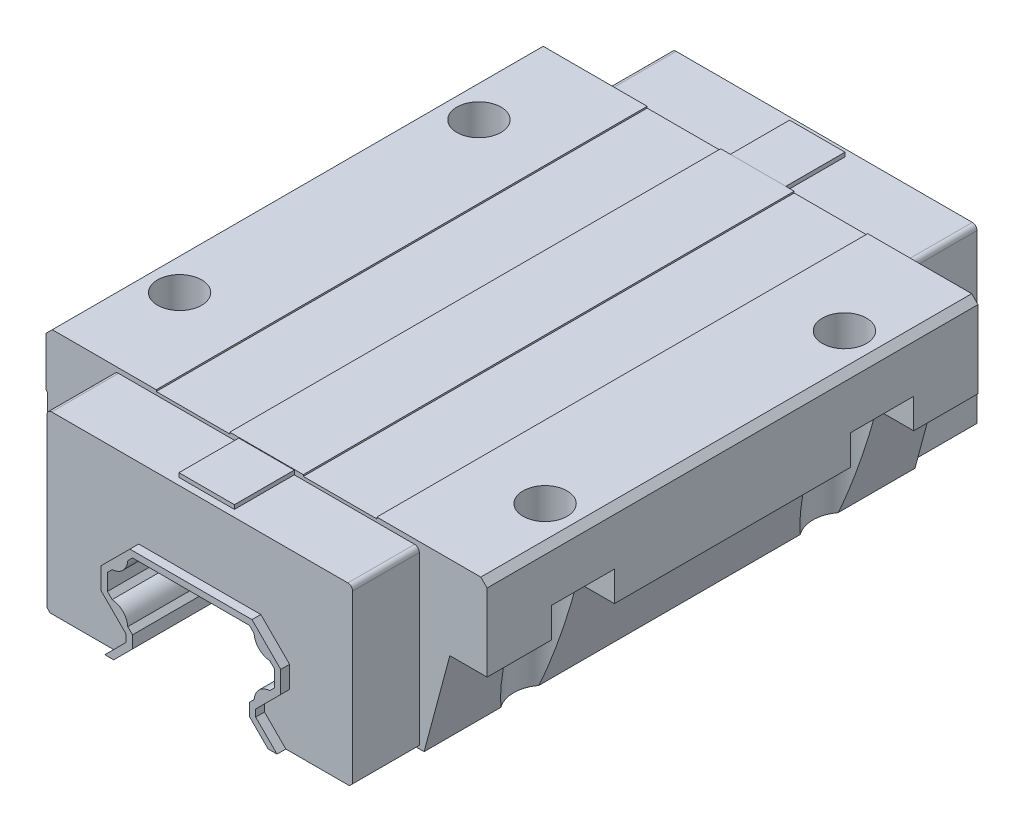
ISO-10303-21;
HEADER;
FILE_DESCRIPTION(('STEP AP214'),'2;1');
FILE_NAME('part.step','',(''),(''),'','','');
FILE_SCHEMA(('AUTOMOTIVE_DESIGN { 1 0 10303 214 1 1 1 1 }'));
ENDSEC;
DATA;
#1=APPLICATION_CONTEXT('core data for automotive mechanical design processes');
#2=APPLICATION_PROTOCOL_DEFINITION('international standard','automotive_design',2000,#1);
#3=PRODUCT_CONTEXT('',#1,'mechanical');
#4=PRODUCT('Part','Part','',(#3));
#5=PRODUCT_RELATED_PRODUCT_CATEGORY('part','',(#4));
#6=PRODUCT_DEFINITION_FORMATION('','',#4);
#7=PRODUCT_DEFINITION_CONTEXT('part definition',#1,'design');
#8=PRODUCT_DEFINITION('design','',#6,#7);
#9=PRODUCT_DEFINITION_SHAPE('','',#8);
#10=(LENGTH_UNIT() NAMED_UNIT(*) SI_UNIT(.MILLI.,.METRE.));
#11=(NAMED_UNIT(*) PLANE_ANGLE_UNIT() SI_UNIT($,.RADIAN.));
#12=(NAMED_UNIT(*) SI_UNIT($,.STERADIAN.) SOLID_ANGLE_UNIT());
#13=UNCERTAINTY_MEASURE_WITH_UNIT(LENGTH_MEASURE(1.E-05),#10,'distance_accuracy_value','');
#14=(GEOMETRIC_REPRESENTATION_CONTEXT(3) GLOBAL_UNCERTAINTY_ASSIGNED_CONTEXT((#13)) GLOBAL_UNIT_ASSIGNED_CONTEXT((#10,
#11,#12)) REPRESENTATION_CONTEXT('',''));
#15=CARTESIAN_POINT('',(0.,0.,0.));
#16=DIRECTION('',(0.,0.,1.));
#17=DIRECTION('',(1.,0.,0.));
#18=AXIS2_PLACEMENT_3D('',#15,#16,#17);
#19=CARTESIAN_POINT('',(0.,0.,-96.9));
#20=DIRECTION('',(0.,0.,1.));
#21=DIRECTION('',(1.,0.,0.));
#22=AXIS2_PLACEMENT_3D('',#19,#20,#21);
#23=PLANE('',#22);
#24=DIRECTION('',(1.,0.,0.));
#25=VECTOR('',#24,1.);
#26=CARTESIAN_POINT('',(-8.8,69.8,-96.9));
#27=LINE('',#26,#25);
#28=CARTESIAN_POINT('',(-8.8,69.8,-96.9));
#29=VERTEX_POINT('',#28);
#30=CARTESIAN_POINT('',(8.8,69.8,-96.9));
#31=VERTEX_POINT('',#30);
#32=EDGE_CURVE('E1736',#29,#31,#27,.T.);
#33=ORIENTED_EDGE('',*,*,#32,.T.);
#34=DIRECTION('',(0.,1.,0.));
#35=VECTOR('',#34,1.);
#36=CARTESIAN_POINT('',(8.8,68.5,-96.9));
#37=LINE('',#36,#35);
#38=CARTESIAN_POINT('',(8.8,68.5,-96.9));
#39=VERTEX_POINT('',#38);
#40=EDGE_CURVE('E1635',#31,#39,#37,.F.);
#41=ORIENTED_EDGE('',*,*,#40,.T.);
#42=DIRECTION('',(1.,0.,0.));
#43=VECTOR('',#42,1.);
#44=CARTESIAN_POINT('',(-48.5,68.5,-96.9));
#45=LINE('',#44,#43);
#46=CARTESIAN_POINT('',(-8.8,68.5,-96.9));
#47=VERTEX_POINT('',#46);
#48=EDGE_CURVE('E1443',#39,#47,#45,.F.);
#49=ORIENTED_EDGE('',*,*,#48,.T.);
#50=DIRECTION('',(0.,1.,0.));
#51=VECTOR('',#50,1.);
#52=CARTESIAN_POINT('',(-8.8,68.5,-96.9));
#53=LINE('',#52,#51);
#54=EDGE_CURVE('E1667',#47,#29,#53,.T.);
#55=ORIENTED_EDGE('',*,*,#54,.T.);
#56=EDGE_LOOP('',(#33,#41,#49,#55));
#57=FACE_BOUND('',#56,.T.);
#58=ADVANCED_FACE('F14',(#57),#23,.F.);
#59=CARTESIAN_POINT('',(-8.8,68.5,114.5479460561));
#60=DIRECTION('',(1.,0.,0.));
#61=DIRECTION('',(0.,0.,-1.));
#62=AXIS2_PLACEMENT_3D('',#59,#60,#61);
#63=PLANE('',#62);
#64=DIRECTION('',(0.,0.,-1.));
#65=VECTOR('',#64,1.);
#66=CARTESIAN_POINT('',(-8.8,69.8,114.5479460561));
#67=LINE('',#66,#65);
#68=CARTESIAN_POINT('',(-8.8,69.8,-77.9));
#69=VERTEX_POINT('',#68);
#70=EDGE_CURVE('E1448',#69,#29,#67,.T.);
#71=ORIENTED_EDGE('',*,*,#70,.T.);
#72=ORIENTED_EDGE('',*,*,#54,.F.);
#73=DIRECTION('',(0.,0.,-1.));
#74=VECTOR('',#73,1.);
#75=CARTESIAN_POINT('',(-8.8,68.5,208.6553130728));
#76=LINE('',#75,#74);
#77=CARTESIAN_POINT('',(-8.8,68.5,-77.9));
#78=VERTEX_POINT('',#77);
#79=EDGE_CURVE('E1440',#47,#78,#76,.F.);
#80=ORIENTED_EDGE('',*,*,#79,.T.);
#81=DIRECTION('',(0.,1.,0.));
#82=VECTOR('',#81,1.);
#83=CARTESIAN_POINT('',(-8.8,68.5,-77.9));
#84=LINE('',#83,#82);
#85=EDGE_CURVE('E1654',#69,#78,#84,.F.);
#86=ORIENTED_EDGE('',*,*,#85,.F.);
#87=EDGE_LOOP('',(#71,#72,#80,#86));
#88=FACE_BOUND('',#87,.T.);
#89=ADVANCED_FACE('F1900',(#88),#63,.F.);
#90=CARTESIAN_POINT('',(8.8,68.5,114.5479460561));
#91=DIRECTION('',(-1.,0.,0.));
#92=DIRECTION('',(0.,0.,1.));
#93=AXIS2_PLACEMENT_3D('',#90,#91,#92);
#94=PLANE('',#93);
#95=DIRECTION('',(0.,0.,-1.));
#96=VECTOR('',#95,1.);
#97=CARTESIAN_POINT('',(8.8,69.8,114.5479460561));
#98=LINE('',#97,#96);
#99=CARTESIAN_POINT('',(8.8,69.8,-77.9));
#100=VERTEX_POINT('',#99);
#101=EDGE_CURVE('E1663',#31,#100,#98,.F.);
#102=ORIENTED_EDGE('',*,*,#101,.T.);
#103=DIRECTION('',(0.,1.,0.));
#104=VECTOR('',#103,1.);
#105=CARTESIAN_POINT('',(8.8,68.5,-77.9));
#106=LINE('',#105,#104);
#107=CARTESIAN_POINT('',(8.8,68.5,-77.9));
#108=VERTEX_POINT('',#107);
#109=EDGE_CURVE('E1652',#108,#100,#106,.T.);
#110=ORIENTED_EDGE('',*,*,#109,.F.);
#111=DIRECTION('',(0.,0.,-1.));
#112=VECTOR('',#111,1.);
#113=CARTESIAN_POINT('',(8.8,68.5,208.6553130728));
#114=LINE('',#113,#112);
#115=EDGE_CURVE('E1432',#108,#39,#114,.T.);
#116=ORIENTED_EDGE('',*,*,#115,.T.);
#117=ORIENTED_EDGE('',*,*,#40,.F.);
#118=EDGE_LOOP('',(#102,#110,#116,#117));
#119=FACE_BOUND('',#118,.T.);
#120=ADVANCED_FACE('F1891',(#119),#94,.F.);
#121=CARTESIAN_POINT('',(-69.5,43.5,-96.90005));
#122=DIRECTION('',(1.,0.,0.));
#123=DIRECTION('',(0.,0.,-1.));
#124=AXIS2_PLACEMENT_3D('',#121,#122,#123);
#125=PLANE('',#124);
#126=DIRECTION('',(0.,0.,1.));
#127=VECTOR('',#126,1.);
#128=CARTESIAN_POINT('',(-69.5,52.,-96.90005));
#129=LINE('',#128,#127);
#130=CARTESIAN_POINT('',(-69.5,52.,37.5));
#131=VERTEX_POINT('',#130);
#132=CARTESIAN_POINT('',(-69.5,52.,-37.5));
#133=VERTEX_POINT('',#132);
#134=EDGE_CURVE('E1632',#131,#133,#129,.F.);
#135=ORIENTED_EDGE('',*,*,#134,.T.);
#136=DIRECTION('',(0.,1.,0.));
#137=VECTOR('',#136,1.);
#138=CARTESIAN_POINT('',(-69.5,13.,-37.5));
#139=LINE('',#138,#137);
#140=CARTESIAN_POINT('',(-69.5,43.5,-37.5));
#141=VERTEX_POINT('',#140);
#142=EDGE_CURVE('E1396',#133,#141,#139,.F.);
#143=ORIENTED_EDGE('',*,*,#142,.T.);
#144=DIRECTION('',(0.,0.,1.));
#145=VECTOR('',#144,1.);
#146=CARTESIAN_POINT('',(-69.5,43.5,-96.90005));
#147=LINE('',#146,#145);
#148=CARTESIAN_POINT('',(-69.5,43.5,37.5));
#149=VERTEX_POINT('',#148);
#150=EDGE_CURVE('E1364',#141,#149,#147,.T.);
#151=ORIENTED_EDGE('',*,*,#150,.T.);
#152=DIRECTION('',(0.,1.,0.));
#153=VECTOR('',#152,1.);
#154=CARTESIAN_POINT('',(-69.5,13.,37.5));
#155=LINE('',#154,#153);
#156=EDGE_CURVE('E1370',#149,#131,#155,.T.);
#157=ORIENTED_EDGE('',*,*,#156,.T.);
#158=EDGE_LOOP('',(#135,#143,#151,#157));
#159=FACE_BOUND('',#158,.T.);
#160=ADVANCED_FACE('F2277',(#159),#125,.F.);
#161=CARTESIAN_POINT('',(-70.,52.5,-96.90005));
#162=DIRECTION('',(0.707106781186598,0.707106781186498,0.));
#163=DIRECTION('',(-0.707106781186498,0.707106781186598,0.));
#164=AXIS2_PLACEMENT_3D('',#161,#162,#163);
#165=PLANE('',#164);
#166=DIRECTION('',(0.,0.,-1.));
#167=VECTOR('',#166,1.);
#168=CARTESIAN_POINT('',(-70.,52.5,229.0588568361));
#169=LINE('',#168,#167);
#170=CARTESIAN_POINT('',(-70.,52.5,37.5));
#171=VERTEX_POINT('',#170);
#172=CARTESIAN_POINT('',(-70.,52.5,-37.5));
#173=VERTEX_POINT('',#172);
#174=EDGE_CURVE('E1341',#171,#173,#169,.T.);
#175=ORIENTED_EDGE('',*,*,#174,.T.);
#176=DIRECTION('',(0.707106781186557,-0.707106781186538,0.));
#177=VECTOR('',#176,1.);
#178=CARTESIAN_POINT('',(-70.,52.5,-37.5));
#179=LINE('',#178,#177);
#180=EDGE_CURVE('E1395',#173,#133,#179,.T.);
#181=ORIENTED_EDGE('',*,*,#180,.T.);
#182=ORIENTED_EDGE('',*,*,#134,.F.);
#183=DIRECTION('',(-0.707106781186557,0.707106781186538,0.));
#184=VECTOR('',#183,1.);
#185=CARTESIAN_POINT('',(-69.5,52.,37.5));
#186=LINE('',#185,#184);
#187=EDGE_CURVE('E1358',#131,#171,#186,.T.);
#188=ORIENTED_EDGE('',*,*,#187,.T.);
#189=EDGE_LOOP('',(#175,#181,#182,#188));
#190=FACE_BOUND('',#189,.T.);
#191=ADVANCED_FACE('F2788',(#190),#165,.F.);
#192=CARTESIAN_POINT('',(-70.,52.5,-96.90005));
#193=DIRECTION('',(0.707106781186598,0.707106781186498,0.));
#194=DIRECTION('',(-0.707106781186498,0.707106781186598,0.));
#195=AXIS2_PLACEMENT_3D('',#192,#193,#194);
#196=PLANE('',#195);
#197=DIRECTION('',(0.,0.,-1.));
#198=VECTOR('',#197,1.);
#199=CARTESIAN_POINT('',(-70.,52.5,229.0588568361));
#200=LINE('',#199,#198);
#201=CARTESIAN_POINT('',(-70.,52.5,-57.5));
#202=VERTEX_POINT('',#201);
#203=CARTESIAN_POINT('',(-70.,52.5,-77.9));
#204=VERTEX_POINT('',#203);
#205=EDGE_CURVE('E1340',#202,#204,#200,.T.);
#206=ORIENTED_EDGE('',*,*,#205,.T.);
#207=DIRECTION('',(-0.707106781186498,0.707106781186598,0.));
#208=VECTOR('',#207,1.);
#209=CARTESIAN_POINT('',(-70.,52.5,-77.9));
#210=LINE('',#209,#208);
#211=CARTESIAN_POINT('',(-69.5,52.,-77.9));
#212=VERTEX_POINT('',#211);
#213=EDGE_CURVE('E1579',#212,#204,#210,.T.);
#214=ORIENTED_EDGE('',*,*,#213,.F.);
#215=DIRECTION('',(0.,0.,-1.));
#216=VECTOR('',#215,1.);
#217=CARTESIAN_POINT('',(-69.5,52.,-96.90005));
#218=LINE('',#217,#216);
#219=CARTESIAN_POINT('',(-69.5,52.,-57.5));
#220=VERTEX_POINT('',#219);
#221=EDGE_CURVE('E1449',#212,#220,#218,.F.);
#222=ORIENTED_EDGE('',*,*,#221,.T.);
#223=DIRECTION('',(-0.707106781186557,0.707106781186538,0.));
#224=VECTOR('',#223,1.);
#225=CARTESIAN_POINT('',(-69.5,52.,-57.5));
#226=LINE('',#225,#224);
#227=EDGE_CURVE('E1390',#220,#202,#226,.T.);
#228=ORIENTED_EDGE('',*,*,#227,.T.);
#229=EDGE_LOOP('',(#206,#214,#222,#228));
#230=FACE_BOUND('',#229,.T.);
#231=ADVANCED_FACE('F1939',(#230),#196,.F.);
#232=CARTESIAN_POINT('',(-70.,52.5,-96.90005));
#233=DIRECTION('',(0.707106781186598,0.707106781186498,0.));
#234=DIRECTION('',(-0.707106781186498,0.707106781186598,0.));
#235=AXIS2_PLACEMENT_3D('',#232,#233,#234);
#236=PLANE('',#235);
#237=DIRECTION('',(0.707106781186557,-0.707106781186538,0.));
#238=VECTOR('',#237,1.);
#239=CARTESIAN_POINT('',(-70.,52.5,57.5));
#240=LINE('',#239,#238);
#241=CARTESIAN_POINT('',(-70.,52.5,57.5));
#242=VERTEX_POINT('',#241);
#243=CARTESIAN_POINT('',(-69.5,52.,57.5));
#244=VERTEX_POINT('',#243);
#245=EDGE_CURVE('E1363',#242,#244,#240,.T.);
#246=ORIENTED_EDGE('',*,*,#245,.T.);
#247=DIRECTION('',(0.,0.,-1.));
#248=VECTOR('',#247,1.);
#249=CARTESIAN_POINT('',(-69.5,52.,-96.90005));
#250=LINE('',#249,#248);
#251=CARTESIAN_POINT('',(-69.5,52.,77.9));
#252=VERTEX_POINT('',#251);
#253=EDGE_CURVE('E1331',#244,#252,#250,.F.);
#254=ORIENTED_EDGE('',*,*,#253,.T.);
#255=DIRECTION('',(-0.707106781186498,0.707106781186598,0.));
#256=VECTOR('',#255,1.);
#257=CARTESIAN_POINT('',(-70.,52.5,77.9));
#258=LINE('',#257,#256);
#259=CARTESIAN_POINT('',(-70.,52.5,77.9));
#260=VERTEX_POINT('',#259);
#261=EDGE_CURVE('E1563',#260,#252,#258,.F.);
#262=ORIENTED_EDGE('',*,*,#261,.F.);
#263=DIRECTION('',(0.,0.,-1.));
#264=VECTOR('',#263,1.);
#265=CARTESIAN_POINT('',(-70.,52.5,229.0588568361));
#266=LINE('',#265,#264);
#267=EDGE_CURVE('E1593',#260,#242,#266,.T.);
#268=ORIENTED_EDGE('',*,*,#267,.T.);
#269=EDGE_LOOP('',(#246,#254,#262,#268));
#270=FACE_BOUND('',#269,.T.);
#271=ADVANCED_FACE('F2781',(#270),#236,.F.);
#272=CARTESIAN_POINT('',(58.,70.,47.5));
#273=DIRECTION('',(0.,1.,0.));
#274=DIRECTION('',(0.,0.,1.));
#275=AXIS2_PLACEMENT_3D('',#272,#273,#274);
#276=CYLINDRICAL_SURFACE('',#275,7.);
#277=CARTESIAN_POINT('',(58.,70.,47.5));
#278=DIRECTION('',(0.,1.,0.));
#279=DIRECTION('',(0.,0.,1.));
#280=AXIS2_PLACEMENT_3D('',#277,#278,#279);
#281=CIRCLE('',#280,7.);
#282=CARTESIAN_POINT('',(58.,70.,54.5));
#283=VERTEX_POINT('',#282);
#284=EDGE_CURVE('E1279',#283,#283,#281,.T.);
#285=ORIENTED_EDGE('',*,*,#284,.T.);
#286=EDGE_LOOP('',(#285));
#287=FACE_BOUND('',#286,.T.);
#288=CARTESIAN_POINT('',(58.,53.,47.5));
#289=DIRECTION('',(0.,1.,0.));
#290=DIRECTION('',(0.,0.,1.));
#291=AXIS2_PLACEMENT_3D('',#288,#289,#290);
#292=CIRCLE('',#291,7.);
#293=CARTESIAN_POINT('',(58.,53.,54.5));
#294=VERTEX_POINT('',#293);
#295=EDGE_CURVE('E17',#294,#294,#292,.T.);
#296=ORIENTED_EDGE('',*,*,#295,.F.);
#297=EDGE_LOOP('',(#296));
#298=FACE_BOUND('',#297,.T.);
#299=ADVANCED_FACE('F2777',(#287,#298),#276,.F.);
#300=CARTESIAN_POINT('',(58.,70.,-47.5));
#301=DIRECTION('',(0.,1.,0.));
#302=DIRECTION('',(0.,0.,1.));
#303=AXIS2_PLACEMENT_3D('',#300,#301,#302);
#304=CYLINDRICAL_SURFACE('',#303,7.);
#305=CARTESIAN_POINT('',(58.,70.,-47.5));
#306=DIRECTION('',(0.,1.,0.));
#307=DIRECTION('',(0.,0.,1.));
#308=AXIS2_PLACEMENT_3D('',#305,#306,#307);
#309=CIRCLE('',#308,7.);
#310=CARTESIAN_POINT('',(58.,70.,-40.5));
#311=VERTEX_POINT('',#310);
#312=EDGE_CURVE('E1275',#311,#311,#309,.T.);
#313=ORIENTED_EDGE('',*,*,#312,.T.);
#314=EDGE_LOOP('',(#313));
#315=FACE_BOUND('',#314,.T.);
#316=CARTESIAN_POINT('',(58.,53.,-47.5));
#317=DIRECTION('',(0.,1.,0.));
#318=DIRECTION('',(0.,0.,1.));
#319=AXIS2_PLACEMENT_3D('',#316,#317,#318);
#320=CIRCLE('',#319,7.);
#321=CARTESIAN_POINT('',(58.,53.,-40.5));
#322=VERTEX_POINT('',#321);
#323=EDGE_CURVE('E1466',#322,#322,#320,.F.);
#324=ORIENTED_EDGE('',*,*,#323,.T.);
#325=EDGE_LOOP('',(#324));
#326=FACE_BOUND('',#325,.T.);
#327=ADVANCED_FACE('F1839',(#315,#326),#304,.F.);
#328=CARTESIAN_POINT('',(35.,69.5,-77.9));
#329=DIRECTION('',(1.,0.,0.));
#330=DIRECTION('',(0.,0.,-1.));
#331=AXIS2_PLACEMENT_3D('',#328,#329,#330);
#332=PLANE('',#331);
#333=DIRECTION('',(0.,0.,-1.));
#334=VECTOR('',#333,1.);
#335=CARTESIAN_POINT('',(35.,69.5,77.9));
#336=LINE('',#335,#334);
#337=CARTESIAN_POINT('',(35.,69.5,-77.9));
#338=VERTEX_POINT('',#337);
#339=CARTESIAN_POINT('',(35.,69.5,77.9));
#340=VERTEX_POINT('',#339);
#341=EDGE_CURVE('E1272',#338,#340,#336,.F.);
#342=ORIENTED_EDGE('',*,*,#341,.T.);
#343=DIRECTION('',(0.,1.,0.));
#344=VECTOR('',#343,1.);
#345=CARTESIAN_POINT('',(35.,69.5,77.9));
#346=LINE('',#345,#344);
#347=CARTESIAN_POINT('',(35.,70.,77.9));
#348=VERTEX_POINT('',#347);
#349=EDGE_CURVE('E1561',#348,#340,#346,.F.);
#350=ORIENTED_EDGE('',*,*,#349,.F.);
#351=DIRECTION('',(0.,0.,-1.));
#352=VECTOR('',#351,1.);
#353=CARTESIAN_POINT('',(35.,70.,229.0588568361));
#354=LINE('',#353,#352);
#355=CARTESIAN_POINT('',(35.,70.,-77.9));
#356=VERTEX_POINT('',#355);
#357=EDGE_CURVE('E1280',#348,#356,#354,.T.);
#358=ORIENTED_EDGE('',*,*,#357,.T.);
#359=DIRECTION('',(0.,1.,0.));
#360=VECTOR('',#359,1.);
#361=CARTESIAN_POINT('',(35.,69.5,-77.9));
#362=LINE('',#361,#360);
#363=EDGE_CURVE('E1559',#338,#356,#362,.T.);
#364=ORIENTED_EDGE('',*,*,#363,.F.);
#365=EDGE_LOOP('',(#342,#350,#358,#364));
#366=FACE_BOUND('',#365,.T.);
#367=ADVANCED_FACE('F1983',(#366),#332,.F.);
#368=CARTESIAN_POINT('',(11.66666666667,69.5,-77.9));
#369=DIRECTION('',(-1.,0.,0.));
#370=DIRECTION('',(0.,0.,1.));
#371=AXIS2_PLACEMENT_3D('',#368,#369,#370);
#372=PLANE('',#371);
#373=DIRECTION('',(0.,0.,-1.));
#374=VECTOR('',#373,1.);
#375=CARTESIAN_POINT('',(11.66666666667,69.5,77.9));
#376=LINE('',#375,#374);
#377=CARTESIAN_POINT('',(11.66666666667,69.5,77.9));
#378=VERTEX_POINT('',#377);
#379=CARTESIAN_POINT('',(11.66666666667,69.5,-77.9));
#380=VERTEX_POINT('',#379);
#381=EDGE_CURVE('E1269',#378,#380,#376,.T.);
#382=ORIENTED_EDGE('',*,*,#381,.T.);
#383=DIRECTION('',(0.,1.,0.));
#384=VECTOR('',#383,1.);
#385=CARTESIAN_POINT('',(11.66666666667,69.5,-77.9));
#386=LINE('',#385,#384);
#387=CARTESIAN_POINT('',(11.66666666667,70.,-77.9));
#388=VERTEX_POINT('',#387);
#389=EDGE_CURVE('E1557',#388,#380,#386,.F.);
#390=ORIENTED_EDGE('',*,*,#389,.F.);
#391=DIRECTION('',(0.,0.,-1.));
#392=VECTOR('',#391,1.);
#393=CARTESIAN_POINT('',(11.66666666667,70.,229.0588568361));
#394=LINE('',#393,#392);
#395=CARTESIAN_POINT('',(11.66666666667,70.,77.9));
#396=VERTEX_POINT('',#395);
#397=EDGE_CURVE('E1266',#388,#396,#394,.F.);
#398=ORIENTED_EDGE('',*,*,#397,.T.);
#399=DIRECTION('',(0.,1.,0.));
#400=VECTOR('',#399,1.);
#401=CARTESIAN_POINT('',(11.66666666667,69.5,77.9));
#402=LINE('',#401,#400);
#403=EDGE_CURVE('E1555',#378,#396,#402,.T.);
#404=ORIENTED_EDGE('',*,*,#403,.F.);
#405=EDGE_LOOP('',(#382,#390,#398,#404));
#406=FACE_BOUND('',#405,.T.);
#407=ADVANCED_FACE('F1973',(#406),#372,.F.);
#408=CARTESIAN_POINT('',(-11.66666666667,69.5,-77.9));
#409=DIRECTION('',(1.,0.,0.));
#410=DIRECTION('',(0.,0.,-1.));
#411=AXIS2_PLACEMENT_3D('',#408,#409,#410);
#412=PLANE('',#411);
#413=DIRECTION('',(0.,0.,-1.));
#414=VECTOR('',#413,1.);
#415=CARTESIAN_POINT('',(-11.66666666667,69.5,-77.9));
#416=LINE('',#415,#414);
#417=CARTESIAN_POINT('',(-11.66666666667,69.5,-77.9));
#418=VERTEX_POINT('',#417);
#419=CARTESIAN_POINT('',(-11.66666666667,69.5,77.9));
#420=VERTEX_POINT('',#419);
#421=EDGE_CURVE('E1260',#418,#420,#416,.F.);
#422=ORIENTED_EDGE('',*,*,#421,.T.);
#423=DIRECTION('',(0.,1.,0.));
#424=VECTOR('',#423,1.);
#425=CARTESIAN_POINT('',(-11.66666666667,69.5,77.9));
#426=LINE('',#425,#424);
#427=CARTESIAN_POINT('',(-11.66666666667,70.,77.9));
#428=VERTEX_POINT('',#427);
#429=EDGE_CURVE('E1553',#428,#420,#426,.F.);
#430=ORIENTED_EDGE('',*,*,#429,.F.);
#431=DIRECTION('',(0.,0.,-1.));
#432=VECTOR('',#431,1.);
#433=CARTESIAN_POINT('',(-11.66666666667,70.,229.0588568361));
#434=LINE('',#433,#432);
#435=CARTESIAN_POINT('',(-11.66666666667,70.,-77.9));
#436=VERTEX_POINT('',#435);
#437=EDGE_CURVE('E1263',#428,#436,#434,.T.);
#438=ORIENTED_EDGE('',*,*,#437,.T.);
#439=DIRECTION('',(0.,1.,0.));
#440=VECTOR('',#439,1.);
#441=CARTESIAN_POINT('',(-11.66666666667,69.5,-77.9));
#442=LINE('',#441,#440);
#443=EDGE_CURVE('E1551',#418,#436,#442,.T.);
#444=ORIENTED_EDGE('',*,*,#443,.F.);
#445=EDGE_LOOP('',(#422,#430,#438,#444));
#446=FACE_BOUND('',#445,.T.);
#447=ADVANCED_FACE('F1964',(#446),#412,.F.);
#448=CARTESIAN_POINT('',(-35.,69.5,-77.9));
#449=DIRECTION('',(-1.,0.,0.));
#450=DIRECTION('',(0.,0.,1.));
#451=AXIS2_PLACEMENT_3D('',#448,#449,#450);
#452=PLANE('',#451);
#453=DIRECTION('',(0.,0.,-1.));
#454=VECTOR('',#453,1.);
#455=CARTESIAN_POINT('',(-35.,69.5,-77.9));
#456=LINE('',#455,#454);
#457=CARTESIAN_POINT('',(-35.,69.5,77.9));
#458=VERTEX_POINT('',#457);
#459=CARTESIAN_POINT('',(-35.,69.5,-77.9));
#460=VERTEX_POINT('',#459);
#461=EDGE_CURVE('E1257',#458,#460,#456,.T.);
#462=ORIENTED_EDGE('',*,*,#461,.T.);
#463=DIRECTION('',(0.,1.,0.));
#464=VECTOR('',#463,1.);
#465=CARTESIAN_POINT('',(-35.,69.5,-77.9));
#466=LINE('',#465,#464);
#467=CARTESIAN_POINT('',(-35.,70.,-77.9));
#468=VERTEX_POINT('',#467);
#469=EDGE_CURVE('E1549',#468,#460,#466,.F.);
#470=ORIENTED_EDGE('',*,*,#469,.F.);
#471=DIRECTION('',(0.,0.,-1.));
#472=VECTOR('',#471,1.);
#473=CARTESIAN_POINT('',(-35.,70.,229.0588568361));
#474=LINE('',#473,#472);
#475=CARTESIAN_POINT('',(-35.,70.,77.9));
#476=VERTEX_POINT('',#475);
#477=EDGE_CURVE('E1254',#468,#476,#474,.F.);
#478=ORIENTED_EDGE('',*,*,#477,.T.);
#479=DIRECTION('',(0.,1.,0.));
#480=VECTOR('',#479,1.);
#481=CARTESIAN_POINT('',(-35.,69.5,77.9));
#482=LINE('',#481,#480);
#483=EDGE_CURVE('E1545',#458,#476,#482,.T.);
#484=ORIENTED_EDGE('',*,*,#483,.F.);
#485=EDGE_LOOP('',(#462,#470,#478,#484));
#486=FACE_BOUND('',#485,.T.);
#487=ADVANCED_FACE('F1958',(#486),#452,.F.);
#488=CARTESIAN_POINT('',(-58.,70.,-47.5));
#489=DIRECTION('',(0.,1.,0.));
#490=DIRECTION('',(0.,0.,1.));
#491=AXIS2_PLACEMENT_3D('',#488,#489,#490);
#492=CYLINDRICAL_SURFACE('',#491,7.);
#493=CARTESIAN_POINT('',(-58.,70.,-47.5));
#494=DIRECTION('',(0.,1.,0.));
#495=DIRECTION('',(0.,0.,1.));
#496=AXIS2_PLACEMENT_3D('',#493,#494,#495);
#497=CIRCLE('',#496,7.);
#498=CARTESIAN_POINT('',(-58.,70.,-40.5));
#499=VERTEX_POINT('',#498);
#500=EDGE_CURVE('E1253',#499,#499,#497,.T.);
#501=ORIENTED_EDGE('',*,*,#500,.T.);
#502=EDGE_LOOP('',(#501));
#503=FACE_BOUND('',#502,.T.);
#504=CARTESIAN_POINT('',(-58.,53.,-47.5));
#505=DIRECTION('',(0.,1.,0.));
#506=DIRECTION('',(0.,0.,1.));
#507=AXIS2_PLACEMENT_3D('',#504,#505,#506);
#508=CIRCLE('',#507,7.);
#509=CARTESIAN_POINT('',(-58.,53.,-40.5));
#510=VERTEX_POINT('',#509);
#511=EDGE_CURVE('E1381',#510,#510,#508,.T.);
#512=ORIENTED_EDGE('',*,*,#511,.F.);
#513=EDGE_LOOP('',(#512));
#514=FACE_BOUND('',#513,.T.);
#515=ADVANCED_FACE('F2762',(#503,#514),#492,.F.);
#516=CARTESIAN_POINT('',(-58.,70.,47.5));
#517=DIRECTION('',(0.,1.,0.));
#518=DIRECTION('',(0.,0.,1.));
#519=AXIS2_PLACEMENT_3D('',#516,#517,#518);
#520=CYLINDRICAL_SURFACE('',#519,7.);
#521=CARTESIAN_POINT('',(-58.,70.,47.5));
#522=DIRECTION('',(0.,1.,0.));
#523=DIRECTION('',(0.,0.,1.));
#524=AXIS2_PLACEMENT_3D('',#521,#522,#523);
#525=CIRCLE('',#524,7.);
#526=CARTESIAN_POINT('',(-58.,70.,54.5));
#527=VERTEX_POINT('',#526);
#528=EDGE_CURVE('E1297',#527,#527,#525,.T.);
#529=ORIENTED_EDGE('',*,*,#528,.T.);
#530=EDGE_LOOP('',(#529));
#531=FACE_BOUND('',#530,.T.);
#532=CARTESIAN_POINT('',(-58.,53.,47.5));
#533=DIRECTION('',(0.,1.,0.));
#534=DIRECTION('',(0.,0.,1.));
#535=AXIS2_PLACEMENT_3D('',#532,#533,#534);
#536=CIRCLE('',#535,7.);
#537=CARTESIAN_POINT('',(-58.,53.,54.5));
#538=VERTEX_POINT('',#537);
#539=EDGE_CURVE('E1353',#538,#538,#536,.F.);
#540=ORIENTED_EDGE('',*,*,#539,.T.);
#541=EDGE_LOOP('',(#540));
#542=FACE_BOUND('',#541,.T.);
#543=ADVANCED_FACE('F2344',(#531,#542),#520,.F.);
#544=CARTESIAN_POINT('',(-8.8,68.5,114.5479460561));
#545=DIRECTION('',(1.,0.,0.));
#546=DIRECTION('',(0.,0.,-1.));
#547=AXIS2_PLACEMENT_3D('',#544,#545,#546);
#548=PLANE('',#547);
#549=DIRECTION('',(0.,0.,-1.));
#550=VECTOR('',#549,1.);
#551=CARTESIAN_POINT('',(-8.8,69.8,114.5479460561));
#552=LINE('',#551,#550);
#553=CARTESIAN_POINT('',(-8.8,69.8,96.9));
#554=VERTEX_POINT('',#553);
#555=CARTESIAN_POINT('',(-8.8,69.8,77.9));
#556=VERTEX_POINT('',#555);
#557=EDGE_CURVE('E1525',#554,#556,#552,.T.);
#558=ORIENTED_EDGE('',*,*,#557,.T.);
#559=DIRECTION('',(0.,1.,0.));
#560=VECTOR('',#559,1.);
#561=CARTESIAN_POINT('',(-8.8,68.5,77.9));
#562=LINE('',#561,#560);
#563=CARTESIAN_POINT('',(-8.8,68.5,77.9));
#564=VERTEX_POINT('',#563);
#565=EDGE_CURVE('E1541',#564,#556,#562,.T.);
#566=ORIENTED_EDGE('',*,*,#565,.F.);
#567=DIRECTION('',(0.,0.,-1.));
#568=VECTOR('',#567,1.);
#569=CARTESIAN_POINT('',(-8.8,68.5,208.6553130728));
#570=LINE('',#569,#568);
#571=CARTESIAN_POINT('',(-8.8,68.5,96.9));
#572=VERTEX_POINT('',#571);
#573=EDGE_CURVE('E1296',#564,#572,#570,.F.);
#574=ORIENTED_EDGE('',*,*,#573,.T.);
#575=DIRECTION('',(0.,1.,0.));
#576=VECTOR('',#575,1.);
#577=CARTESIAN_POINT('',(-8.8,0.,96.9));
#578=LINE('',#577,#576);
#579=EDGE_CURVE('E1533',#554,#572,#578,.F.);
#580=ORIENTED_EDGE('',*,*,#579,.F.);
#581=EDGE_LOOP('',(#558,#566,#574,#580));
#582=FACE_BOUND('',#581,.T.);
#583=ADVANCED_FACE('F2339',(#582),#548,.F.);
#584=CARTESIAN_POINT('',(0.,0.,96.9));
#585=DIRECTION('',(0.,0.,1.));
#586=DIRECTION('',(1.,0.,0.));
#587=AXIS2_PLACEMENT_3D('',#584,#585,#586);
#588=PLANE('',#587);
#589=ORIENTED_EDGE('',*,*,#579,.T.);
#590=DIRECTION('',(1.,0.,0.));
#591=VECTOR('',#590,1.);
#592=CARTESIAN_POINT('',(-48.5,68.5,96.9));
#593=LINE('',#592,#591);
#594=CARTESIAN_POINT('',(8.8,68.5,96.9));
#595=VERTEX_POINT('',#594);
#596=EDGE_CURVE('E1302',#572,#595,#593,.T.);
#597=ORIENTED_EDGE('',*,*,#596,.T.);
#598=DIRECTION('',(0.,1.,0.));
#599=VECTOR('',#598,1.);
#600=CARTESIAN_POINT('',(8.8,68.5,96.9));
#601=LINE('',#600,#599);
#602=CARTESIAN_POINT('',(8.8,69.8,96.9));
#603=VERTEX_POINT('',#602);
#604=EDGE_CURVE('E1529',#595,#603,#601,.T.);
#605=ORIENTED_EDGE('',*,*,#604,.T.);
#606=DIRECTION('',(1.,0.,0.));
#607=VECTOR('',#606,1.);
#608=CARTESIAN_POINT('',(-8.8,69.8,96.9));
#609=LINE('',#608,#607);
#610=EDGE_CURVE('E1704',#603,#554,#609,.F.);
#611=ORIENTED_EDGE('',*,*,#610,.T.);
#612=EDGE_LOOP('',(#589,#597,#605,#611));
#613=FACE_BOUND('',#612,.T.);
#614=ADVANCED_FACE('F2343',(#613),#588,.T.);
#615=CARTESIAN_POINT('',(8.8,68.5,114.5479460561));
#616=DIRECTION('',(-1.,0.,0.));
#617=DIRECTION('',(0.,0.,1.));
#618=AXIS2_PLACEMENT_3D('',#615,#616,#617);
#619=PLANE('',#618);
#620=DIRECTION('',(0.,0.,-1.));
#621=VECTOR('',#620,1.);
#622=CARTESIAN_POINT('',(8.8,69.8,114.5479460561));
#623=LINE('',#622,#621);
#624=CARTESIAN_POINT('',(8.8,69.8,77.9));
#625=VERTEX_POINT('',#624);
#626=EDGE_CURVE('E1324',#625,#603,#623,.F.);
#627=ORIENTED_EDGE('',*,*,#626,.T.);
#628=ORIENTED_EDGE('',*,*,#604,.F.);
#629=DIRECTION('',(0.,0.,-1.));
#630=VECTOR('',#629,1.);
#631=CARTESIAN_POINT('',(8.8,68.5,208.6553130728));
#632=LINE('',#631,#630);
#633=CARTESIAN_POINT('',(8.8,68.5,77.9));
#634=VERTEX_POINT('',#633);
#635=EDGE_CURVE('E1236',#595,#634,#632,.T.);
#636=ORIENTED_EDGE('',*,*,#635,.T.);
#637=DIRECTION('',(0.,1.,0.));
#638=VECTOR('',#637,1.);
#639=CARTESIAN_POINT('',(8.8,68.5,77.9));
#640=LINE('',#639,#638);
#641=EDGE_CURVE('E1519',#625,#634,#640,.F.);
#642=ORIENTED_EDGE('',*,*,#641,.F.);
#643=EDGE_LOOP('',(#627,#628,#636,#642));
#644=FACE_BOUND('',#643,.T.);
#645=ADVANCED_FACE('F2353',(#644),#619,.F.);
#646=CARTESIAN_POINT('',(70.,13.,37.5));
#647=DIRECTION('',(0.,0.,-1.));
#648=DIRECTION('',(-1.,0.,0.));
#649=AXIS2_PLACEMENT_3D('',#646,#647,#648);
#650=PLANE('',#649);
#651=DIRECTION('',(1.,0.,0.));
#652=VECTOR('',#651,1.);
#653=CARTESIAN_POINT('',(58.,53.,37.5));
#654=LINE('',#653,#652);
#655=CARTESIAN_POINT('',(58.,53.,37.5));
#656=VERTEX_POINT('',#655);
#657=CARTESIAN_POINT('',(70.,53.,37.5));
#658=VERTEX_POINT('',#657);
#659=EDGE_CURVE('E1509',#656,#658,#654,.T.);
#660=ORIENTED_EDGE('',*,*,#659,.F.);
#661=DIRECTION('',(0.,1.,0.));
#662=VECTOR('',#661,1.);
#663=CARTESIAN_POINT('',(58.,13.,37.5));
#664=LINE('',#663,#662);
#665=CARTESIAN_POINT('',(58.,42.8564064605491,37.5));
#666=VERTEX_POINT('',#665);
#667=EDGE_CURVE('E670',#656,#666,#664,.F.);
#668=ORIENTED_EDGE('',*,*,#667,.T.);
#669=DIRECTION('',(-0.258819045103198,-0.965925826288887,0.));
#670=VECTOR('',#669,1.);
#671=CARTESIAN_POINT('',(58.17245036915,43.5,37.5));
#672=LINE('',#671,#670);
#673=CARTESIAN_POINT('',(58.17245036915,43.5,37.5));
#674=VERTEX_POINT('',#673);
#675=EDGE_CURVE('E1515',#674,#666,#672,.T.);
#676=ORIENTED_EDGE('',*,*,#675,.F.);
#677=DIRECTION('',(1.,0.,0.));
#678=VECTOR('',#677,1.);
#679=CARTESIAN_POINT('',(70.,43.5,37.5));
#680=LINE('',#679,#678);
#681=CARTESIAN_POINT('',(70.,43.5,37.5));
#682=VERTEX_POINT('',#681);
#683=EDGE_CURVE('E1495',#674,#682,#680,.T.);
#684=ORIENTED_EDGE('',*,*,#683,.T.);
#685=DIRECTION('',(0.,1.,0.));
#686=VECTOR('',#685,1.);
#687=CARTESIAN_POINT('',(70.,70.,37.5));
#688=LINE('',#687,#686);
#689=EDGE_CURVE('E1691',#682,#658,#688,.T.);
#690=ORIENTED_EDGE('',*,*,#689,.T.);
#691=EDGE_LOOP('',(#660,#668,#676,#684,#690));
#692=FACE_BOUND('',#691,.T.);
#693=ADVANCED_FACE('F2003',(#692),#650,.F.);
#694=CARTESIAN_POINT('',(58.,13.,57.5));
#695=DIRECTION('',(0.,0.,1.));
#696=DIRECTION('',(1.,0.,0.));
#697=AXIS2_PLACEMENT_3D('',#694,#695,#696);
#698=PLANE('',#697);
#699=DIRECTION('',(0.,1.,0.));
#700=VECTOR('',#699,1.);
#701=CARTESIAN_POINT('',(70.,70.,57.5));
#702=LINE('',#701,#700);
#703=CARTESIAN_POINT('',(70.,53.,57.5));
#704=VERTEX_POINT('',#703);
#705=CARTESIAN_POINT('',(70.,43.5,57.5));
#706=VERTEX_POINT('',#705);
#707=EDGE_CURVE('E1566',#704,#706,#702,.F.);
#708=ORIENTED_EDGE('',*,*,#707,.T.);
#709=DIRECTION('',(1.,0.,0.));
#710=VECTOR('',#709,1.);
#711=CARTESIAN_POINT('',(70.,43.5,57.5));
#712=LINE('',#711,#710);
#713=CARTESIAN_POINT('',(58.17245036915,43.5,57.5));
#714=VERTEX_POINT('',#713);
#715=EDGE_CURVE('E1522',#706,#714,#712,.F.);
#716=ORIENTED_EDGE('',*,*,#715,.T.);
#717=DIRECTION('',(-0.258819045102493,-0.965925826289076,0.));
#718=VECTOR('',#717,1.);
#719=CARTESIAN_POINT('',(58.17245036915,43.5,57.5000000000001));
#720=LINE('',#719,#718);
#721=CARTESIAN_POINT('',(58.,42.8564064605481,57.5));
#722=VERTEX_POINT('',#721);
#723=EDGE_CURVE('E1051',#714,#722,#720,.T.);
#724=ORIENTED_EDGE('',*,*,#723,.T.);
#725=DIRECTION('',(0.,1.,0.));
#726=VECTOR('',#725,1.);
#727=CARTESIAN_POINT('',(58.,13.,57.5));
#728=LINE('',#727,#726);
#729=CARTESIAN_POINT('',(58.,53.,57.5));
#730=VERTEX_POINT('',#729);
#731=EDGE_CURVE('E666',#722,#730,#728,.T.);
#732=ORIENTED_EDGE('',*,*,#731,.T.);
#733=DIRECTION('',(1.,0.,0.));
#734=VECTOR('',#733,1.);
#735=CARTESIAN_POINT('',(58.,53.,57.5));
#736=LINE('',#735,#734);
#737=EDGE_CURVE('E1511',#704,#730,#736,.F.);
#738=ORIENTED_EDGE('',*,*,#737,.F.);
#739=EDGE_LOOP('',(#708,#716,#724,#732,#738));
#740=FACE_BOUND('',#739,.T.);
#741=ADVANCED_FACE('F1996',(#740),#698,.F.);
#742=CARTESIAN_POINT('',(58.,53.,47.5));
#743=DIRECTION('',(0.,-1.,0.));
#744=DIRECTION('',(0.,0.,-1.));
#745=AXIS2_PLACEMENT_3D('',#742,#743,#744);
#746=PLANE('',#745);
#747=ORIENTED_EDGE('',*,*,#295,.T.);
#748=EDGE_LOOP('',(#747));
#749=FACE_BOUND('',#748,.T.);
#750=ORIENTED_EDGE('',*,*,#659,.T.);
#751=DIRECTION('',(0.,0.,1.));
#752=VECTOR('',#751,1.);
#753=CARTESIAN_POINT('',(70.,53.,229.0588568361));
#754=LINE('',#753,#752);
#755=EDGE_CURVE('E1571',#658,#704,#754,.T.);
#756=ORIENTED_EDGE('',*,*,#755,.T.);
#757=ORIENTED_EDGE('',*,*,#737,.T.);
#758=CARTESIAN_POINT('',(58.,53.,47.5));
#759=DIRECTION('',(0.,1.,0.));
#760=DIRECTION('',(0.,0.,1.));
#761=AXIS2_PLACEMENT_3D('',#758,#759,#760);
#762=CIRCLE('',#761,10.);
#763=EDGE_CURVE('E1048',#730,#656,#762,.F.);
#764=ORIENTED_EDGE('',*,*,#763,.T.);
#765=EDGE_LOOP('',(#750,#756,#757,#764));
#766=FACE_BOUND('',#765,.T.);
#767=ADVANCED_FACE('F2000',(#749,#766),#746,.T.);
#768=CARTESIAN_POINT('',(70.,43.5,-96.90005));
#769=DIRECTION('',(0.,1.,0.));
#770=DIRECTION('',(0.,0.,1.));
#771=AXIS2_PLACEMENT_3D('',#768,#769,#770);
#772=PLANE('',#771);
#773=DIRECTION('',(0.,0.,1.));
#774=VECTOR('',#773,1.);
#775=CARTESIAN_POINT('',(70.,43.5,229.0588568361));
#776=LINE('',#775,#774);
#777=CARTESIAN_POINT('',(70.,43.5,-37.5));
#778=VERTEX_POINT('',#777);
#779=EDGE_CURVE('E1686',#778,#682,#776,.T.);
#780=ORIENTED_EDGE('',*,*,#779,.T.);
#781=ORIENTED_EDGE('',*,*,#683,.F.);
#782=DIRECTION('',(0.,0.,1.));
#783=VECTOR('',#782,1.);
#784=CARTESIAN_POINT('',(58.17245036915,43.5,-96.90005));
#785=LINE('',#784,#783);
#786=CARTESIAN_POINT('',(58.17245036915,43.5,-37.5));
#787=VERTEX_POINT('',#786);
#788=EDGE_CURVE('E1044',#674,#787,#785,.F.);
#789=ORIENTED_EDGE('',*,*,#788,.T.);
#790=DIRECTION('',(1.,0.,0.));
#791=VECTOR('',#790,1.);
#792=CARTESIAN_POINT('',(70.,43.5,-37.5));
#793=LINE('',#792,#791);
#794=EDGE_CURVE('E1490',#787,#778,#793,.T.);
#795=ORIENTED_EDGE('',*,*,#794,.T.);
#796=EDGE_LOOP('',(#780,#781,#789,#795));
#797=FACE_BOUND('',#796,.T.);
#798=ADVANCED_FACE('F2006',(#797),#772,.F.);
#799=CARTESIAN_POINT('',(58.,13.,-57.5));
#800=DIRECTION('',(0.,0.,-1.));
#801=DIRECTION('',(-1.,0.,0.));
#802=AXIS2_PLACEMENT_3D('',#799,#800,#801);
#803=PLANE('',#802);
#804=DIRECTION('',(1.,0.,0.));
#805=VECTOR('',#804,1.);
#806=CARTESIAN_POINT('',(58.,53.,-57.5));
#807=LINE('',#806,#805);
#808=CARTESIAN_POINT('',(70.,53.,-57.5));
#809=VERTEX_POINT('',#808);
#810=CARTESIAN_POINT('',(58.,53.,-57.5));
#811=VERTEX_POINT('',#810);
#812=EDGE_CURVE('E1483',#809,#811,#807,.F.);
#813=ORIENTED_EDGE('',*,*,#812,.T.);
#814=DIRECTION('',(0.,1.,0.));
#815=VECTOR('',#814,1.);
#816=CARTESIAN_POINT('',(58.,13.,-57.5));
#817=LINE('',#816,#815);
#818=CARTESIAN_POINT('',(58.,42.8564064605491,-57.5));
#819=VERTEX_POINT('',#818);
#820=EDGE_CURVE('E1039',#811,#819,#817,.F.);
#821=ORIENTED_EDGE('',*,*,#820,.T.);
#822=DIRECTION('',(-0.258819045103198,-0.965925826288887,0.));
#823=VECTOR('',#822,1.);
#824=CARTESIAN_POINT('',(58.17245036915,43.5,-57.5));
#825=LINE('',#824,#823);
#826=CARTESIAN_POINT('',(58.17245036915,43.5,-57.5));
#827=VERTEX_POINT('',#826);
#828=EDGE_CURVE('E1493',#827,#819,#825,.T.);
#829=ORIENTED_EDGE('',*,*,#828,.F.);
#830=DIRECTION('',(1.,0.,0.));
#831=VECTOR('',#830,1.);
#832=CARTESIAN_POINT('',(70.,43.5,-57.5));
#833=LINE('',#832,#831);
#834=CARTESIAN_POINT('',(70.,43.5,-57.5));
#835=VERTEX_POINT('',#834);
#836=EDGE_CURVE('E1458',#827,#835,#833,.T.);
#837=ORIENTED_EDGE('',*,*,#836,.T.);
#838=DIRECTION('',(0.,1.,0.));
#839=VECTOR('',#838,1.);
#840=CARTESIAN_POINT('',(70.,70.,-57.5));
#841=LINE('',#840,#839);
#842=EDGE_CURVE('E1642',#835,#809,#841,.T.);
#843=ORIENTED_EDGE('',*,*,#842,.T.);
#844=EDGE_LOOP('',(#813,#821,#829,#837,#843));
#845=FACE_BOUND('',#844,.T.);
#846=ADVANCED_FACE('F1856',(#845),#803,.F.);
#847=CARTESIAN_POINT('',(70.,13.,-37.5));
#848=DIRECTION('',(0.,0.,1.));
#849=DIRECTION('',(1.,0.,0.));
#850=AXIS2_PLACEMENT_3D('',#847,#848,#849);
#851=PLANE('',#850);
#852=DIRECTION('',(0.,1.,0.));
#853=VECTOR('',#852,1.);
#854=CARTESIAN_POINT('',(70.,70.,-37.5));
#855=LINE('',#854,#853);
#856=CARTESIAN_POINT('',(70.,53.,-37.5));
#857=VERTEX_POINT('',#856);
#858=EDGE_CURVE('E1681',#857,#778,#855,.F.);
#859=ORIENTED_EDGE('',*,*,#858,.T.);
#860=ORIENTED_EDGE('',*,*,#794,.F.);
#861=DIRECTION('',(-0.258819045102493,-0.965925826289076,0.));
#862=VECTOR('',#861,1.);
#863=CARTESIAN_POINT('',(58.17245036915,43.5,-37.5));
#864=LINE('',#863,#862);
#865=CARTESIAN_POINT('',(58.,42.8564064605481,-37.5));
#866=VERTEX_POINT('',#865);
#867=EDGE_CURVE('E1042',#787,#866,#864,.T.);
#868=ORIENTED_EDGE('',*,*,#867,.T.);
#869=DIRECTION('',(0.,1.,0.));
#870=VECTOR('',#869,1.);
#871=CARTESIAN_POINT('',(58.,13.,-37.5));
#872=LINE('',#871,#870);
#873=CARTESIAN_POINT('',(58.,53.,-37.5));
#874=VERTEX_POINT('',#873);
#875=EDGE_CURVE('E1034',#866,#874,#872,.T.);
#876=ORIENTED_EDGE('',*,*,#875,.T.);
#877=DIRECTION('',(1.,0.,0.));
#878=VECTOR('',#877,1.);
#879=CARTESIAN_POINT('',(58.,53.,-37.5));
#880=LINE('',#879,#878);
#881=EDGE_CURVE('E1486',#874,#857,#880,.T.);
#882=ORIENTED_EDGE('',*,*,#881,.T.);
#883=EDGE_LOOP('',(#859,#860,#868,#876,#882));
#884=FACE_BOUND('',#883,.T.);
#885=ADVANCED_FACE('F1845',(#884),#851,.F.);
#886=CARTESIAN_POINT('',(58.,53.,-47.5));
#887=DIRECTION('',(0.,1.,0.));
#888=DIRECTION('',(0.,0.,1.));
#889=AXIS2_PLACEMENT_3D('',#886,#887,#888);
#890=PLANE('',#889);
#891=ORIENTED_EDGE('',*,*,#323,.F.);
#892=EDGE_LOOP('',(#891));
#893=FACE_BOUND('',#892,.T.);
#894=DIRECTION('',(0.,0.,1.));
#895=VECTOR('',#894,1.);
#896=CARTESIAN_POINT('',(70.,53.,229.0588568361));
#897=LINE('',#896,#895);
#898=EDGE_CURVE('E1645',#809,#857,#897,.T.);
#899=ORIENTED_EDGE('',*,*,#898,.T.);
#900=ORIENTED_EDGE('',*,*,#881,.F.);
#901=CARTESIAN_POINT('',(58.,53.,-47.5));
#902=DIRECTION('',(0.,1.,0.));
#903=DIRECTION('',(0.,0.,1.));
#904=AXIS2_PLACEMENT_3D('',#901,#902,#903);
#905=CIRCLE('',#904,10.);
#906=EDGE_CURVE('E1037',#874,#811,#905,.F.);
#907=ORIENTED_EDGE('',*,*,#906,.T.);
#908=ORIENTED_EDGE('',*,*,#812,.F.);
#909=EDGE_LOOP('',(#899,#900,#907,#908));
#910=FACE_BOUND('',#909,.T.);
#911=ADVANCED_FACE('F1841',(#893,#910),#890,.F.);
#912=CARTESIAN_POINT('',(-69.5,43.5,-96.90005));
#913=DIRECTION('',(1.,0.,0.));
#914=DIRECTION('',(0.,0.,-1.));
#915=AXIS2_PLACEMENT_3D('',#912,#913,#914);
#916=PLANE('',#915);
#917=ORIENTED_EDGE('',*,*,#221,.F.);
#918=DIRECTION('',(0.,1.,0.));
#919=VECTOR('',#918,1.);
#920=CARTESIAN_POINT('',(-69.5,0.,-77.9));
#921=LINE('',#920,#919);
#922=CARTESIAN_POINT('',(-69.5,43.5,-77.9));
#923=VERTEX_POINT('',#922);
#924=EDGE_CURVE('E1410',#212,#923,#921,.F.);
#925=ORIENTED_EDGE('',*,*,#924,.T.);
#926=DIRECTION('',(0.,0.,1.));
#927=VECTOR('',#926,1.);
#928=CARTESIAN_POINT('',(-69.5,43.5,-96.90005));
#929=LINE('',#928,#927);
#930=CARTESIAN_POINT('',(-69.5,43.5,-57.5));
#931=VERTEX_POINT('',#930);
#932=EDGE_CURVE('E1456',#923,#931,#929,.T.);
#933=ORIENTED_EDGE('',*,*,#932,.T.);
#934=DIRECTION('',(0.,1.,0.));
#935=VECTOR('',#934,1.);
#936=CARTESIAN_POINT('',(-69.5,13.,-57.5));
#937=LINE('',#936,#935);
#938=EDGE_CURVE('E1402',#931,#220,#937,.T.);
#939=ORIENTED_EDGE('',*,*,#938,.T.);
#940=EDGE_LOOP('',(#917,#925,#933,#939));
#941=FACE_BOUND('',#940,.T.);
#942=ADVANCED_FACE('F1844',(#941),#916,.F.);
#943=CARTESIAN_POINT('',(-48.5,68.5,208.6553130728));
#944=DIRECTION('',(1.,0.,0.));
#945=DIRECTION('',(0.,0.,-1.));
#946=AXIS2_PLACEMENT_3D('',#943,#944,#945);
#947=PLANE('',#946);
#948=DIRECTION('',(0.,0.,-1.));
#949=VECTOR('',#948,1.);
#950=CARTESIAN_POINT('',(-48.5,67.,208.6553130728));
#951=LINE('',#950,#949);
#952=CARTESIAN_POINT('',(-48.5,67.,-99.1));
#953=VERTEX_POINT('',#952);
#954=CARTESIAN_POINT('',(-48.5,67.,-77.9));
#955=VERTEX_POINT('',#954);
#956=EDGE_CURVE('E1446',#953,#955,#951,.F.);
#957=ORIENTED_EDGE('',*,*,#956,.F.);
#958=DIRECTION('',(0.,1.,0.));
#959=VECTOR('',#958,1.);
#960=CARTESIAN_POINT('',(-48.5,68.5,-99.1));
#961=LINE('',#960,#959);
#962=CARTESIAN_POINT('',(-48.5,14.,-99.1));
#963=VERTEX_POINT('',#962);
#964=EDGE_CURVE('E989',#963,#953,#961,.T.);
#965=ORIENTED_EDGE('',*,*,#964,.F.);
#966=DIRECTION('',(0.,0.,1.));
#967=VECTOR('',#966,1.);
#968=CARTESIAN_POINT('',(-48.5,14.,-96.90005));
#969=LINE('',#968,#967);
#970=CARTESIAN_POINT('',(-48.5,14.,-77.9));
#971=VERTEX_POINT('',#970);
#972=EDGE_CURVE('E972',#963,#971,#969,.T.);
#973=ORIENTED_EDGE('',*,*,#972,.T.);
#974=DIRECTION('',(0.,1.,0.));
#975=VECTOR('',#974,1.);
#976=CARTESIAN_POINT('',(-48.5,0.,-77.9));
#977=LINE('',#976,#975);
#978=EDGE_CURVE('E954',#971,#955,#977,.T.);
#979=ORIENTED_EDGE('',*,*,#978,.T.);
#980=EDGE_LOOP('',(#957,#965,#973,#979));
#981=FACE_BOUND('',#980,.T.);
#982=ADVANCED_FACE('F1907',(#981),#947,.F.);
#983=CARTESIAN_POINT('',(-47.,67.,208.6553130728));
#984=DIRECTION('',(0.,0.,-1.));
#985=DIRECTION('',(-1.,0.,0.));
#986=AXIS2_PLACEMENT_3D('',#983,#984,#985);
#987=CYLINDRICAL_SURFACE('',#986,1.5);
#988=CARTESIAN_POINT('',(-47.,67.,-99.1));
#989=DIRECTION('',(0.,0.,-1.));
#990=DIRECTION('',(-1.,0.,0.));
#991=AXIS2_PLACEMENT_3D('',#988,#989,#990);
#992=CIRCLE('',#991,1.5);
#993=CARTESIAN_POINT('',(-47.,68.5,-99.1));
#994=VERTEX_POINT('',#993);
#995=EDGE_CURVE('E988',#953,#994,#992,.T.);
#996=ORIENTED_EDGE('',*,*,#995,.F.);
#997=ORIENTED_EDGE('',*,*,#956,.T.);
#998=CARTESIAN_POINT('',(-47.,67.,-77.9));
#999=DIRECTION('',(0.,0.,-1.));
#1000=DIRECTION('',(-1.,0.,0.));
#1001=AXIS2_PLACEMENT_3D('',#998,#999,#1000);
#1002=CIRCLE('',#1001,1.5);
#1003=CARTESIAN_POINT('',(-47.,68.5,-77.9));
#1004=VERTEX_POINT('',#1003);
#1005=EDGE_CURVE('E951',#955,#1004,#1002,.T.);
#1006=ORIENTED_EDGE('',*,*,#1005,.T.);
#1007=DIRECTION('',(0.,0.,-1.));
#1008=VECTOR('',#1007,1.);
#1009=CARTESIAN_POINT('',(-47.,68.5,208.6553130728));
#1010=LINE('',#1009,#1008);
#1011=EDGE_CURVE('E1437',#1004,#994,#1010,.T.);
#1012=ORIENTED_EDGE('',*,*,#1011,.T.);
#1013=EDGE_LOOP('',(#996,#997,#1006,#1012));
#1014=FACE_BOUND('',#1013,.T.);
#1015=ADVANCED_FACE('F1905',(#1014),#987,.T.);
#1016=CARTESIAN_POINT('',(-8.8,69.8,114.5479460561));
#1017=DIRECTION('',(0.,-1.,0.));
#1018=DIRECTION('',(0.,0.,-1.));
#1019=AXIS2_PLACEMENT_3D('',#1016,#1017,#1018);
#1020=PLANE('',#1019);
#1021=ORIENTED_EDGE('',*,*,#32,.F.);
#1022=ORIENTED_EDGE('',*,*,#70,.F.);
#1023=DIRECTION('',(1.,0.,0.));
#1024=VECTOR('',#1023,1.);
#1025=CARTESIAN_POINT('',(0.,69.8,-77.9));
#1026=LINE('',#1025,#1024);
#1027=EDGE_CURVE('E945',#69,#100,#1026,.T.);
#1028=ORIENTED_EDGE('',*,*,#1027,.T.);
#1029=ORIENTED_EDGE('',*,*,#101,.F.);
#1030=EDGE_LOOP('',(#1021,#1022,#1028,#1029));
#1031=FACE_BOUND('',#1030,.T.);
#1032=ADVANCED_FACE('F1898',(#1031),#1020,.F.);
#1033=CARTESIAN_POINT('',(-48.5,68.5,208.6553130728));
#1034=DIRECTION('',(0.,-1.,0.));
#1035=DIRECTION('',(0.,0.,-1.));
#1036=AXIS2_PLACEMENT_3D('',#1033,#1034,#1035);
#1037=PLANE('',#1036);
#1038=DIRECTION('',(1.,0.,0.));
#1039=VECTOR('',#1038,1.);
#1040=CARTESIAN_POINT('',(0.,68.5,-77.9));
#1041=LINE('',#1040,#1039);
#1042=CARTESIAN_POINT('',(47.,68.5,-77.9));
#1043=VERTEX_POINT('',#1042);
#1044=EDGE_CURVE('E942',#108,#1043,#1041,.T.);
#1045=ORIENTED_EDGE('',*,*,#1044,.T.);
#1046=DIRECTION('',(0.,0.,-1.));
#1047=VECTOR('',#1046,1.);
#1048=CARTESIAN_POINT('',(47.,68.5,208.6553130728));
#1049=LINE('',#1048,#1047);
#1050=CARTESIAN_POINT('',(47.,68.5,-99.1));
#1051=VERTEX_POINT('',#1050);
#1052=EDGE_CURVE('E1429',#1051,#1043,#1049,.F.);
#1053=ORIENTED_EDGE('',*,*,#1052,.F.);
#1054=DIRECTION('',(-1.,0.,0.));
#1055=VECTOR('',#1054,1.);
#1056=CARTESIAN_POINT('',(48.5,68.5,-99.1));
#1057=LINE('',#1056,#1055);
#1058=EDGE_CURVE('E985',#994,#1051,#1057,.F.);
#1059=ORIENTED_EDGE('',*,*,#1058,.F.);
#1060=ORIENTED_EDGE('',*,*,#1011,.F.);
#1061=DIRECTION('',(1.,0.,0.));
#1062=VECTOR('',#1061,1.);
#1063=CARTESIAN_POINT('',(0.,68.5,-77.9));
#1064=LINE('',#1063,#1062);
#1065=EDGE_CURVE('E948',#1004,#78,#1064,.T.);
#1066=ORIENTED_EDGE('',*,*,#1065,.T.);
#1067=ORIENTED_EDGE('',*,*,#79,.F.);
#1068=ORIENTED_EDGE('',*,*,#48,.F.);
#1069=ORIENTED_EDGE('',*,*,#115,.F.);
#1070=EDGE_LOOP('',(#1045,#1053,#1059,#1060,#1066,#1067,#1068,#1069));
#1071=FACE_BOUND('',#1070,.T.);
#1072=ADVANCED_FACE('F1887',(#1071),#1037,.F.);
#1073=CARTESIAN_POINT('',(47.,67.,208.6553130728));
#1074=DIRECTION('',(0.,0.,-1.));
#1075=DIRECTION('',(-1.,0.,0.));
#1076=AXIS2_PLACEMENT_3D('',#1073,#1074,#1075);
#1077=CYLINDRICAL_SURFACE('',#1076,1.5);
#1078=CARTESIAN_POINT('',(47.,67.,-99.1));
#1079=DIRECTION('',(0.,0.,-1.));
#1080=DIRECTION('',(-1.,0.,0.));
#1081=AXIS2_PLACEMENT_3D('',#1078,#1079,#1080);
#1082=CIRCLE('',#1081,1.5);
#1083=CARTESIAN_POINT('',(48.5,67.,-99.1));
#1084=VERTEX_POINT('',#1083);
#1085=EDGE_CURVE('E982',#1051,#1084,#1082,.T.);
#1086=ORIENTED_EDGE('',*,*,#1085,.F.);
#1087=ORIENTED_EDGE('',*,*,#1052,.T.);
#1088=CARTESIAN_POINT('',(47.,67.,-77.9));
#1089=DIRECTION('',(0.,0.,-1.));
#1090=DIRECTION('',(-1.,0.,0.));
#1091=AXIS2_PLACEMENT_3D('',#1088,#1089,#1090);
#1092=CIRCLE('',#1091,1.5);
#1093=CARTESIAN_POINT('',(48.5,67.,-77.9));
#1094=VERTEX_POINT('',#1093);
#1095=EDGE_CURVE('E939',#1043,#1094,#1092,.T.);
#1096=ORIENTED_EDGE('',*,*,#1095,.T.);
#1097=DIRECTION('',(0.,0.,1.));
#1098=VECTOR('',#1097,1.);
#1099=CARTESIAN_POINT('',(48.5,67.,208.6553130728));
#1100=LINE('',#1099,#1098);
#1101=EDGE_CURVE('E1431',#1094,#1084,#1100,.F.);
#1102=ORIENTED_EDGE('',*,*,#1101,.T.);
#1103=EDGE_LOOP('',(#1086,#1087,#1096,#1102));
#1104=FACE_BOUND('',#1103,.T.);
#1105=ADVANCED_FACE('F1883',(#1104),#1077,.T.);
#1106=CARTESIAN_POINT('',(48.5,68.5,208.6553130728));
#1107=DIRECTION('',(-1.,0.,0.));
#1108=DIRECTION('',(0.,0.,1.));
#1109=AXIS2_PLACEMENT_3D('',#1106,#1107,#1108);
#1110=PLANE('',#1109);
#1111=DIRECTION('',(0.,0.,1.));
#1112=VECTOR('',#1111,1.);
#1113=CARTESIAN_POINT('',(48.5,14.,-96.90005));
#1114=LINE('',#1113,#1112);
#1115=CARTESIAN_POINT('',(48.5,14.,-77.9));
#1116=VERTEX_POINT('',#1115);
#1117=CARTESIAN_POINT('',(48.5,14.,-99.1));
#1118=VERTEX_POINT('',#1117);
#1119=EDGE_CURVE('E1221',#1116,#1118,#1114,.F.);
#1120=ORIENTED_EDGE('',*,*,#1119,.T.);
#1121=DIRECTION('',(0.,1.,0.));
#1122=VECTOR('',#1121,1.);
#1123=CARTESIAN_POINT('',(48.5,68.5,-99.1));
#1124=LINE('',#1123,#1122);
#1125=EDGE_CURVE('E980',#1084,#1118,#1124,.F.);
#1126=ORIENTED_EDGE('',*,*,#1125,.F.);
#1127=ORIENTED_EDGE('',*,*,#1101,.F.);
#1128=DIRECTION('',(0.,1.,0.));
#1129=VECTOR('',#1128,1.);
#1130=CARTESIAN_POINT('',(48.5,0.,-77.9));
#1131=LINE('',#1130,#1129);
#1132=EDGE_CURVE('E935',#1094,#1116,#1131,.F.);
#1133=ORIENTED_EDGE('',*,*,#1132,.T.);
#1134=EDGE_LOOP('',(#1120,#1126,#1127,#1133));
#1135=FACE_BOUND('',#1134,.T.);
#1136=ADVANCED_FACE('F1879',(#1135),#1110,.F.);
#1137=CARTESIAN_POINT('',(70.,43.5,-96.90005));
#1138=DIRECTION('',(0.,1.,0.));
#1139=DIRECTION('',(0.,0.,1.));
#1140=AXIS2_PLACEMENT_3D('',#1137,#1138,#1139);
#1141=PLANE('',#1140);
#1142=DIRECTION('',(0.,0.,1.));
#1143=VECTOR('',#1142,1.);
#1144=CARTESIAN_POINT('',(58.17245036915,43.5,-96.90005));
#1145=LINE('',#1144,#1143);
#1146=CARTESIAN_POINT('',(58.17245036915,43.5,-77.9));
#1147=VERTEX_POINT('',#1146);
#1148=EDGE_CURVE('E1413',#827,#1147,#1145,.F.);
#1149=ORIENTED_EDGE('',*,*,#1148,.T.);
#1150=DIRECTION('',(1.,0.,0.));
#1151=VECTOR('',#1150,1.);
#1152=CARTESIAN_POINT('',(0.,43.5,-77.9));
#1153=LINE('',#1152,#1151);
#1154=CARTESIAN_POINT('',(70.,43.5,-77.9));
#1155=VERTEX_POINT('',#1154);
#1156=EDGE_CURVE('E934',#1147,#1155,#1153,.T.);
#1157=ORIENTED_EDGE('',*,*,#1156,.T.);
#1158=DIRECTION('',(0.,0.,1.));
#1159=VECTOR('',#1158,1.);
#1160=CARTESIAN_POINT('',(70.,43.5,229.0588568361));
#1161=LINE('',#1160,#1159);
#1162=EDGE_CURVE('E1524',#1155,#835,#1161,.T.);
#1163=ORIENTED_EDGE('',*,*,#1162,.T.);
#1164=ORIENTED_EDGE('',*,*,#836,.F.);
#1165=EDGE_LOOP('',(#1149,#1157,#1163,#1164));
#1166=FACE_BOUND('',#1165,.T.);
#1167=ADVANCED_FACE('F1860',(#1166),#1141,.F.);
#1168=CARTESIAN_POINT('',(-70.,43.5,-96.90005));
#1169=DIRECTION('',(0.,1.,0.));
#1170=DIRECTION('',(0.,0.,1.));
#1171=AXIS2_PLACEMENT_3D('',#1168,#1169,#1170);
#1172=PLANE('',#1171);
#1173=DIRECTION('',(1.,0.,0.));
#1174=VECTOR('',#1173,1.);
#1175=CARTESIAN_POINT('',(0.,43.5,-77.9));
#1176=LINE('',#1175,#1174);
#1177=CARTESIAN_POINT('',(-58.17245036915,43.5,-77.9));
#1178=VERTEX_POINT('',#1177);
#1179=EDGE_CURVE('E962',#923,#1178,#1176,.T.);
#1180=ORIENTED_EDGE('',*,*,#1179,.T.);
#1181=DIRECTION('',(0.,0.,1.));
#1182=VECTOR('',#1181,1.);
#1183=CARTESIAN_POINT('',(-58.17245036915,43.5,-96.90005));
#1184=LINE('',#1183,#1182);
#1185=CARTESIAN_POINT('',(-58.17245036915,43.5,-57.5));
#1186=VERTEX_POINT('',#1185);
#1187=EDGE_CURVE('E895',#1178,#1186,#1184,.T.);
#1188=ORIENTED_EDGE('',*,*,#1187,.T.);
#1189=DIRECTION('',(-1.,0.,0.));
#1190=VECTOR('',#1189,1.);
#1191=CARTESIAN_POINT('',(-58.,43.5,-57.5));
#1192=LINE('',#1191,#1190);
#1193=EDGE_CURVE('E1399',#1186,#931,#1192,.T.);
#1194=ORIENTED_EDGE('',*,*,#1193,.T.);
#1195=ORIENTED_EDGE('',*,*,#932,.F.);
#1196=EDGE_LOOP('',(#1180,#1188,#1194,#1195));
#1197=FACE_BOUND('',#1196,.T.);
#1198=ADVANCED_FACE('F1929',(#1197),#1172,.F.);
#1199=CARTESIAN_POINT('',(-70.,13.,-37.5));
#1200=DIRECTION('',(0.,0.,1.));
#1201=DIRECTION('',(1.,0.,0.));
#1202=AXIS2_PLACEMENT_3D('',#1199,#1200,#1201);
#1203=PLANE('',#1202);
#1204=DIRECTION('',(0.,1.,0.));
#1205=VECTOR('',#1204,1.);
#1206=CARTESIAN_POINT('',(-70.,70.,-37.5));
#1207=LINE('',#1206,#1205);
#1208=CARTESIAN_POINT('',(-70.,53.,-37.5));
#1209=VERTEX_POINT('',#1208);
#1210=EDGE_CURVE('E1344',#173,#1209,#1207,.T.);
#1211=ORIENTED_EDGE('',*,*,#1210,.T.);
#1212=DIRECTION('',(1.,0.,0.));
#1213=VECTOR('',#1212,1.);
#1214=CARTESIAN_POINT('',(-58.,53.,-37.5));
#1215=LINE('',#1214,#1213);
#1216=CARTESIAN_POINT('',(-58.,53.,-37.5));
#1217=VERTEX_POINT('',#1216);
#1218=EDGE_CURVE('E1386',#1217,#1209,#1215,.F.);
#1219=ORIENTED_EDGE('',*,*,#1218,.F.);
#1220=DIRECTION('',(0.,1.,0.));
#1221=VECTOR('',#1220,1.);
#1222=CARTESIAN_POINT('',(-58.,13.,-37.5));
#1223=LINE('',#1222,#1221);
#1224=CARTESIAN_POINT('',(-58.,42.8564064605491,-37.5));
#1225=VERTEX_POINT('',#1224);
#1226=EDGE_CURVE('E890',#1217,#1225,#1223,.F.);
#1227=ORIENTED_EDGE('',*,*,#1226,.T.);
#1228=DIRECTION('',(0.258819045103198,-0.965925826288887,0.));
#1229=VECTOR('',#1228,1.);
#1230=CARTESIAN_POINT('',(-58.17245036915,43.5,-37.5));
#1231=LINE('',#1230,#1229);
#1232=CARTESIAN_POINT('',(-58.17245036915,43.5,-37.5));
#1233=VERTEX_POINT('',#1232);
#1234=EDGE_CURVE('E1393',#1233,#1225,#1231,.T.);
#1235=ORIENTED_EDGE('',*,*,#1234,.F.);
#1236=DIRECTION('',(1.,0.,0.));
#1237=VECTOR('',#1236,1.);
#1238=CARTESIAN_POINT('',(-70.,43.5,-37.5));
#1239=LINE('',#1238,#1237);
#1240=EDGE_CURVE('E1378',#1233,#141,#1239,.F.);
#1241=ORIENTED_EDGE('',*,*,#1240,.T.);
#1242=ORIENTED_EDGE('',*,*,#142,.F.);
#1243=ORIENTED_EDGE('',*,*,#180,.F.);
#1244=EDGE_LOOP('',(#1211,#1219,#1227,#1235,#1241,#1242,#1243));
#1245=FACE_BOUND('',#1244,.T.);
#1246=ADVANCED_FACE('F2741',(#1245),#1203,.F.);
#1247=CARTESIAN_POINT('',(-58.,13.,-57.5));
#1248=DIRECTION('',(0.,0.,-1.));
#1249=DIRECTION('',(-1.,0.,0.));
#1250=AXIS2_PLACEMENT_3D('',#1247,#1248,#1249);
#1251=PLANE('',#1250);
#1252=ORIENTED_EDGE('',*,*,#938,.F.);
#1253=ORIENTED_EDGE('',*,*,#1193,.F.);
#1254=DIRECTION('',(-0.258819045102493,0.965925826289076,0.));
#1255=VECTOR('',#1254,1.);
#1256=CARTESIAN_POINT('',(-58.17245036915,43.5,-57.5));
#1257=LINE('',#1256,#1255);
#1258=CARTESIAN_POINT('',(-58.,42.8564064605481,-57.5));
#1259=VERTEX_POINT('',#1258);
#1260=EDGE_CURVE('E893',#1186,#1259,#1257,.F.);
#1261=ORIENTED_EDGE('',*,*,#1260,.T.);
#1262=DIRECTION('',(0.,1.,0.));
#1263=VECTOR('',#1262,1.);
#1264=CARTESIAN_POINT('',(-58.,13.,-57.5));
#1265=LINE('',#1264,#1263);
#1266=CARTESIAN_POINT('',(-58.,53.,-57.5));
#1267=VERTEX_POINT('',#1266);
#1268=EDGE_CURVE('E885',#1259,#1267,#1265,.T.);
#1269=ORIENTED_EDGE('',*,*,#1268,.T.);
#1270=DIRECTION('',(1.,0.,0.));
#1271=VECTOR('',#1270,1.);
#1272=CARTESIAN_POINT('',(-58.,53.,-57.5));
#1273=LINE('',#1272,#1271);
#1274=CARTESIAN_POINT('',(-70.,53.,-57.5));
#1275=VERTEX_POINT('',#1274);
#1276=EDGE_CURVE('E1384',#1275,#1267,#1273,.T.);
#1277=ORIENTED_EDGE('',*,*,#1276,.F.);
#1278=DIRECTION('',(0.,1.,0.));
#1279=VECTOR('',#1278,1.);
#1280=CARTESIAN_POINT('',(-70.,70.,-57.5));
#1281=LINE('',#1280,#1279);
#1282=EDGE_CURVE('E1614',#1275,#202,#1281,.F.);
#1283=ORIENTED_EDGE('',*,*,#1282,.T.);
#1284=ORIENTED_EDGE('',*,*,#227,.F.);
#1285=EDGE_LOOP('',(#1252,#1253,#1261,#1269,#1277,#1283,#1284));
#1286=FACE_BOUND('',#1285,.T.);
#1287=ADVANCED_FACE('F1935',(#1286),#1251,.F.);
#1288=CARTESIAN_POINT('',(-58.,53.,-47.5));
#1289=DIRECTION('',(0.,-1.,0.));
#1290=DIRECTION('',(0.,0.,-1.));
#1291=AXIS2_PLACEMENT_3D('',#1288,#1289,#1290);
#1292=PLANE('',#1291);
#1293=ORIENTED_EDGE('',*,*,#511,.T.);
#1294=EDGE_LOOP('',(#1293));
#1295=FACE_BOUND('',#1294,.T.);
#1296=ORIENTED_EDGE('',*,*,#1276,.T.);
#1297=CARTESIAN_POINT('',(-58.,53.,-47.5));
#1298=DIRECTION('',(0.,1.,0.));
#1299=DIRECTION('',(0.,0.,1.));
#1300=AXIS2_PLACEMENT_3D('',#1297,#1298,#1299);
#1301=CIRCLE('',#1300,10.);
#1302=EDGE_CURVE('E888',#1267,#1217,#1301,.F.);
#1303=ORIENTED_EDGE('',*,*,#1302,.T.);
#1304=ORIENTED_EDGE('',*,*,#1218,.T.);
#1305=DIRECTION('',(0.,0.,-1.));
#1306=VECTOR('',#1305,1.);
#1307=CARTESIAN_POINT('',(-70.,53.,229.0588568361));
#1308=LINE('',#1307,#1306);
#1309=EDGE_CURVE('E1617',#1209,#1275,#1308,.T.);
#1310=ORIENTED_EDGE('',*,*,#1309,.T.);
#1311=EDGE_LOOP('',(#1296,#1303,#1304,#1310));
#1312=FACE_BOUND('',#1311,.T.);
#1313=ADVANCED_FACE('F2734',(#1295,#1312),#1292,.T.);
#1314=CARTESIAN_POINT('',(-70.,43.5,-96.90005));
#1315=DIRECTION('',(0.,1.,0.));
#1316=DIRECTION('',(0.,0.,1.));
#1317=AXIS2_PLACEMENT_3D('',#1314,#1315,#1316);
#1318=PLANE('',#1317);
#1319=ORIENTED_EDGE('',*,*,#1240,.F.);
#1320=DIRECTION('',(0.,0.,1.));
#1321=VECTOR('',#1320,1.);
#1322=CARTESIAN_POINT('',(-58.17245036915,43.5,-96.90005));
#1323=LINE('',#1322,#1321);
#1324=CARTESIAN_POINT('',(-58.17245036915,43.5,37.5));
#1325=VERTEX_POINT('',#1324);
#1326=EDGE_CURVE('E882',#1233,#1325,#1323,.T.);
#1327=ORIENTED_EDGE('',*,*,#1326,.T.);
#1328=DIRECTION('',(-1.,0.,0.));
#1329=VECTOR('',#1328,1.);
#1330=CARTESIAN_POINT('',(-70.,43.5,37.5));
#1331=LINE('',#1330,#1329);
#1332=EDGE_CURVE('E1367',#1325,#149,#1331,.T.);
#1333=ORIENTED_EDGE('',*,*,#1332,.T.);
#1334=ORIENTED_EDGE('',*,*,#150,.F.);
#1335=EDGE_LOOP('',(#1319,#1327,#1333,#1334));
#1336=FACE_BOUND('',#1335,.T.);
#1337=ADVANCED_FACE('F2730',(#1336),#1318,.F.);
#1338=CARTESIAN_POINT('',(-58.,13.,57.5));
#1339=DIRECTION('',(0.,0.,1.));
#1340=DIRECTION('',(1.,0.,0.));
#1341=AXIS2_PLACEMENT_3D('',#1338,#1339,#1340);
#1342=PLANE('',#1341);
#1343=DIRECTION('',(0.,1.,0.));
#1344=VECTOR('',#1343,1.);
#1345=CARTESIAN_POINT('',(-70.,70.,57.5));
#1346=LINE('',#1345,#1344);
#1347=CARTESIAN_POINT('',(-70.,53.,57.5));
#1348=VERTEX_POINT('',#1347);
#1349=EDGE_CURVE('E1588',#242,#1348,#1346,.T.);
#1350=ORIENTED_EDGE('',*,*,#1349,.T.);
#1351=DIRECTION('',(1.,0.,0.));
#1352=VECTOR('',#1351,1.);
#1353=CARTESIAN_POINT('',(-58.,53.,57.5));
#1354=LINE('',#1353,#1352);
#1355=CARTESIAN_POINT('',(-58.,53.,57.5));
#1356=VERTEX_POINT('',#1355);
#1357=EDGE_CURVE('E1350',#1348,#1356,#1354,.T.);
#1358=ORIENTED_EDGE('',*,*,#1357,.T.);
#1359=DIRECTION('',(0.,1.,0.));
#1360=VECTOR('',#1359,1.);
#1361=CARTESIAN_POINT('',(-58.,13.,57.5));
#1362=LINE('',#1361,#1360);
#1363=CARTESIAN_POINT('',(-58.,42.8564064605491,57.5));
#1364=VERTEX_POINT('',#1363);
#1365=EDGE_CURVE('E877',#1356,#1364,#1362,.F.);
#1366=ORIENTED_EDGE('',*,*,#1365,.T.);
#1367=DIRECTION('',(0.258819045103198,-0.965925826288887,0.));
#1368=VECTOR('',#1367,1.);
#1369=CARTESIAN_POINT('',(-58.17245036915,43.5,57.5));
#1370=LINE('',#1369,#1368);
#1371=CARTESIAN_POINT('',(-58.17245036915,43.5,57.5));
#1372=VERTEX_POINT('',#1371);
#1373=EDGE_CURVE('E1361',#1372,#1364,#1370,.T.);
#1374=ORIENTED_EDGE('',*,*,#1373,.F.);
#1375=DIRECTION('',(1.,0.,0.));
#1376=VECTOR('',#1375,1.);
#1377=CARTESIAN_POINT('',(-70.,43.5,57.5));
#1378=LINE('',#1377,#1376);
#1379=CARTESIAN_POINT('',(-69.5,43.5,57.5));
#1380=VERTEX_POINT('',#1379);
#1381=EDGE_CURVE('E1325',#1372,#1380,#1378,.F.);
#1382=ORIENTED_EDGE('',*,*,#1381,.T.);
#1383=DIRECTION('',(0.,1.,0.));
#1384=VECTOR('',#1383,1.);
#1385=CARTESIAN_POINT('',(-69.5,43.5,57.5));
#1386=LINE('',#1385,#1384);
#1387=EDGE_CURVE('E1334',#1380,#244,#1386,.T.);
#1388=ORIENTED_EDGE('',*,*,#1387,.T.);
#1389=ORIENTED_EDGE('',*,*,#245,.F.);
#1390=EDGE_LOOP('',(#1350,#1358,#1366,#1374,#1382,#1388,#1389));
#1391=FACE_BOUND('',#1390,.T.);
#1392=ADVANCED_FACE('F2726',(#1391),#1342,.F.);
#1393=CARTESIAN_POINT('',(-70.,13.,37.5));
#1394=DIRECTION('',(0.,0.,-1.));
#1395=DIRECTION('',(-1.,0.,0.));
#1396=AXIS2_PLACEMENT_3D('',#1393,#1394,#1395);
#1397=PLANE('',#1396);
#1398=ORIENTED_EDGE('',*,*,#156,.F.);
#1399=ORIENTED_EDGE('',*,*,#1332,.F.);
#1400=DIRECTION('',(-0.258819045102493,0.965925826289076,0.));
#1401=VECTOR('',#1400,1.);
#1402=CARTESIAN_POINT('',(-58.17245036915,43.5,37.5));
#1403=LINE('',#1402,#1401);
#1404=CARTESIAN_POINT('',(-58.,42.8564064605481,37.5));
#1405=VERTEX_POINT('',#1404);
#1406=EDGE_CURVE('E880',#1325,#1405,#1403,.F.);
#1407=ORIENTED_EDGE('',*,*,#1406,.T.);
#1408=DIRECTION('',(0.,1.,0.));
#1409=VECTOR('',#1408,1.);
#1410=CARTESIAN_POINT('',(-58.,13.,37.5));
#1411=LINE('',#1410,#1409);
#1412=CARTESIAN_POINT('',(-58.,53.,37.5));
#1413=VERTEX_POINT('',#1412);
#1414=EDGE_CURVE('E872',#1405,#1413,#1411,.T.);
#1415=ORIENTED_EDGE('',*,*,#1414,.T.);
#1416=DIRECTION('',(1.,0.,0.));
#1417=VECTOR('',#1416,1.);
#1418=CARTESIAN_POINT('',(-58.,53.,37.5));
#1419=LINE('',#1418,#1417);
#1420=CARTESIAN_POINT('',(-70.,53.,37.5));
#1421=VERTEX_POINT('',#1420);
#1422=EDGE_CURVE('E1354',#1413,#1421,#1419,.F.);
#1423=ORIENTED_EDGE('',*,*,#1422,.T.);
#1424=DIRECTION('',(0.,1.,0.));
#1425=VECTOR('',#1424,1.);
#1426=CARTESIAN_POINT('',(-70.,70.,37.5));
#1427=LINE('',#1426,#1425);
#1428=EDGE_CURVE('E1345',#1421,#171,#1427,.F.);
#1429=ORIENTED_EDGE('',*,*,#1428,.T.);
#1430=ORIENTED_EDGE('',*,*,#187,.F.);
#1431=EDGE_LOOP('',(#1398,#1399,#1407,#1415,#1423,#1429,#1430));
#1432=FACE_BOUND('',#1431,.T.);
#1433=ADVANCED_FACE('F2722',(#1432),#1397,.F.);
#1434=CARTESIAN_POINT('',(-58.,53.,47.5));
#1435=DIRECTION('',(0.,1.,0.));
#1436=DIRECTION('',(0.,0.,1.));
#1437=AXIS2_PLACEMENT_3D('',#1434,#1435,#1436);
#1438=PLANE('',#1437);
#1439=ORIENTED_EDGE('',*,*,#539,.F.);
#1440=EDGE_LOOP('',(#1439));
#1441=FACE_BOUND('',#1440,.T.);
#1442=DIRECTION('',(0.,0.,-1.));
#1443=VECTOR('',#1442,1.);
#1444=CARTESIAN_POINT('',(-70.,53.,229.0588568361));
#1445=LINE('',#1444,#1443);
#1446=EDGE_CURVE('E1585',#1348,#1421,#1445,.T.);
#1447=ORIENTED_EDGE('',*,*,#1446,.T.);
#1448=ORIENTED_EDGE('',*,*,#1422,.F.);
#1449=CARTESIAN_POINT('',(-58.,53.,47.5));
#1450=DIRECTION('',(0.,1.,0.));
#1451=DIRECTION('',(0.,0.,1.));
#1452=AXIS2_PLACEMENT_3D('',#1449,#1450,#1451);
#1453=CIRCLE('',#1452,10.);
#1454=EDGE_CURVE('E875',#1413,#1356,#1453,.F.);
#1455=ORIENTED_EDGE('',*,*,#1454,.T.);
#1456=ORIENTED_EDGE('',*,*,#1357,.F.);
#1457=EDGE_LOOP('',(#1447,#1448,#1455,#1456));
#1458=FACE_BOUND('',#1457,.T.);
#1459=ADVANCED_FACE('F2719',(#1441,#1458),#1438,.F.);
#1460=CARTESIAN_POINT('',(-70.,68.,229.0588568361));
#1461=DIRECTION('',(0.707106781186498,-0.707106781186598,0.));
#1462=DIRECTION('',(0.707106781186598,0.707106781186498,0.));
#1463=AXIS2_PLACEMENT_3D('',#1460,#1461,#1462);
#1464=PLANE('',#1463);
#1465=DIRECTION('',(-0.707106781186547,-0.707106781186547,0.));
#1466=VECTOR('',#1465,1.);
#1467=CARTESIAN_POINT('',(-68.,70.,-77.9));
#1468=LINE('',#1467,#1466);
#1469=CARTESIAN_POINT('',(-68.,70.,-77.9));
#1470=VERTEX_POINT('',#1469);
#1471=CARTESIAN_POINT('',(-70.,68.,-77.9));
#1472=VERTEX_POINT('',#1471);
#1473=EDGE_CURVE('E901',#1470,#1472,#1468,.T.);
#1474=ORIENTED_EDGE('',*,*,#1473,.T.);
#1475=DIRECTION('',(0.,0.,-1.));
#1476=VECTOR('',#1475,1.);
#1477=CARTESIAN_POINT('',(-70.,68.,229.0588568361));
#1478=LINE('',#1477,#1476);
#1479=CARTESIAN_POINT('',(-70.,68.,77.9));
#1480=VERTEX_POINT('',#1479);
#1481=EDGE_CURVE('E1337',#1472,#1480,#1478,.F.);
#1482=ORIENTED_EDGE('',*,*,#1481,.T.);
#1483=DIRECTION('',(-0.707106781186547,-0.707106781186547,0.));
#1484=VECTOR('',#1483,1.);
#1485=CARTESIAN_POINT('',(-68.,70.,77.9));
#1486=LINE('',#1485,#1484);
#1487=CARTESIAN_POINT('',(-67.9999999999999,69.9999999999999,77.9));
#1488=VERTEX_POINT('',#1487);
#1489=EDGE_CURVE('E857',#1488,#1480,#1486,.T.);
#1490=ORIENTED_EDGE('',*,*,#1489,.F.);
#1491=DIRECTION('',(0.,0.,-1.));
#1492=VECTOR('',#1491,1.);
#1493=CARTESIAN_POINT('',(-68.,70.,229.0588568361));
#1494=LINE('',#1493,#1492);
#1495=EDGE_CURVE('E1251',#1488,#1470,#1494,.T.);
#1496=ORIENTED_EDGE('',*,*,#1495,.T.);
#1497=EDGE_LOOP('',(#1474,#1482,#1490,#1496));
#1498=FACE_BOUND('',#1497,.T.);
#1499=ADVANCED_FACE('F1947',(#1498),#1464,.F.);
#1500=CARTESIAN_POINT('',(-70.,70.,229.0588568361));
#1501=DIRECTION('',(1.,0.,0.));
#1502=DIRECTION('',(0.,0.,-1.));
#1503=AXIS2_PLACEMENT_3D('',#1500,#1501,#1502);
#1504=PLANE('',#1503);
#1505=DIRECTION('',(0.,1.,0.));
#1506=VECTOR('',#1505,1.);
#1507=CARTESIAN_POINT('',(-70.,0.,-77.9));
#1508=LINE('',#1507,#1506);
#1509=EDGE_CURVE('E1453',#1472,#204,#1508,.F.);
#1510=ORIENTED_EDGE('',*,*,#1509,.T.);
#1511=ORIENTED_EDGE('',*,*,#205,.F.);
#1512=ORIENTED_EDGE('',*,*,#1282,.F.);
#1513=ORIENTED_EDGE('',*,*,#1309,.F.);
#1514=ORIENTED_EDGE('',*,*,#1210,.F.);
#1515=ORIENTED_EDGE('',*,*,#174,.F.);
#1516=ORIENTED_EDGE('',*,*,#1428,.F.);
#1517=ORIENTED_EDGE('',*,*,#1446,.F.);
#1518=ORIENTED_EDGE('',*,*,#1349,.F.);
#1519=ORIENTED_EDGE('',*,*,#267,.F.);
#1520=DIRECTION('',(0.,1.,0.));
#1521=VECTOR('',#1520,1.);
#1522=CARTESIAN_POINT('',(-70.,0.,77.9));
#1523=LINE('',#1522,#1521);
#1524=EDGE_CURVE('E859',#1480,#260,#1523,.F.);
#1525=ORIENTED_EDGE('',*,*,#1524,.F.);
#1526=ORIENTED_EDGE('',*,*,#1481,.F.);
#1527=EDGE_LOOP('',(#1510,#1511,#1512,#1513,#1514,#1515,#1516,#1517,#1518,#1519,#1525,#1526));
#1528=FACE_BOUND('',#1527,.T.);
#1529=ADVANCED_FACE('F1941',(#1528),#1504,.F.);
#1530=CARTESIAN_POINT('',(-69.5,43.5,-96.90005));
#1531=DIRECTION('',(1.,0.,0.));
#1532=DIRECTION('',(0.,0.,-1.));
#1533=AXIS2_PLACEMENT_3D('',#1530,#1531,#1532);
#1534=PLANE('',#1533);
#1535=ORIENTED_EDGE('',*,*,#1387,.F.);
#1536=DIRECTION('',(0.,0.,1.));
#1537=VECTOR('',#1536,1.);
#1538=CARTESIAN_POINT('',(-69.5,43.5,-96.90005));
#1539=LINE('',#1538,#1537);
#1540=CARTESIAN_POINT('',(-69.5,43.5,77.9));
#1541=VERTEX_POINT('',#1540);
#1542=EDGE_CURVE('E1321',#1380,#1541,#1539,.T.);
#1543=ORIENTED_EDGE('',*,*,#1542,.T.);
#1544=DIRECTION('',(0.,1.,0.));
#1545=VECTOR('',#1544,1.);
#1546=CARTESIAN_POINT('',(-69.5,0.,77.9));
#1547=LINE('',#1546,#1545);
#1548=EDGE_CURVE('E1318',#252,#1541,#1547,.F.);
#1549=ORIENTED_EDGE('',*,*,#1548,.F.);
#1550=ORIENTED_EDGE('',*,*,#253,.F.);
#1551=EDGE_LOOP('',(#1535,#1543,#1549,#1550));
#1552=FACE_BOUND('',#1551,.T.);
#1553=ADVANCED_FACE('F2410',(#1552),#1534,.F.);
#1554=CARTESIAN_POINT('',(-70.,43.5,-96.90005));
#1555=DIRECTION('',(0.,1.,0.));
#1556=DIRECTION('',(0.,0.,1.));
#1557=AXIS2_PLACEMENT_3D('',#1554,#1555,#1556);
#1558=PLANE('',#1557);
#1559=ORIENTED_EDGE('',*,*,#1381,.F.);
#1560=DIRECTION('',(0.,0.,1.));
#1561=VECTOR('',#1560,1.);
#1562=CARTESIAN_POINT('',(-58.17245036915,43.5,-96.90005));
#1563=LINE('',#1562,#1561);
#1564=CARTESIAN_POINT('',(-58.17245036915,43.5,77.9));
#1565=VERTEX_POINT('',#1564);
#1566=EDGE_CURVE('E1312',#1372,#1565,#1563,.T.);
#1567=ORIENTED_EDGE('',*,*,#1566,.T.);
#1568=DIRECTION('',(1.,0.,0.));
#1569=VECTOR('',#1568,1.);
#1570=CARTESIAN_POINT('',(0.,43.5,77.9));
#1571=LINE('',#1570,#1569);
#1572=EDGE_CURVE('E869',#1541,#1565,#1571,.T.);
#1573=ORIENTED_EDGE('',*,*,#1572,.F.);
#1574=ORIENTED_EDGE('',*,*,#1542,.F.);
#1575=EDGE_LOOP('',(#1559,#1567,#1573,#1574));
#1576=FACE_BOUND('',#1575,.T.);
#1577=ADVANCED_FACE('F2363',(#1576),#1558,.F.);
#1578=CARTESIAN_POINT('',(-8.8,69.8,114.5479460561));
#1579=DIRECTION('',(0.,-1.,0.));
#1580=DIRECTION('',(0.,0.,-1.));
#1581=AXIS2_PLACEMENT_3D('',#1578,#1579,#1580);
#1582=PLANE('',#1581);
#1583=ORIENTED_EDGE('',*,*,#557,.F.);
#1584=ORIENTED_EDGE('',*,*,#610,.F.);
#1585=ORIENTED_EDGE('',*,*,#626,.F.);
#1586=DIRECTION('',(1.,0.,0.));
#1587=VECTOR('',#1586,1.);
#1588=CARTESIAN_POINT('',(0.,69.8,77.9));
#1589=LINE('',#1588,#1587);
#1590=EDGE_CURVE('E842',#556,#625,#1589,.T.);
#1591=ORIENTED_EDGE('',*,*,#1590,.F.);
#1592=EDGE_LOOP('',(#1583,#1584,#1585,#1591));
#1593=FACE_BOUND('',#1592,.T.);
#1594=ADVANCED_FACE('F2359',(#1593),#1582,.F.);
#1595=CARTESIAN_POINT('',(70.,43.5,-96.90005));
#1596=DIRECTION('',(0.,1.,0.));
#1597=DIRECTION('',(0.,0.,1.));
#1598=AXIS2_PLACEMENT_3D('',#1595,#1596,#1597);
#1599=PLANE('',#1598);
#1600=DIRECTION('',(0.,0.,1.));
#1601=VECTOR('',#1600,1.);
#1602=CARTESIAN_POINT('',(70.,43.5,229.0588568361));
#1603=LINE('',#1602,#1601);
#1604=CARTESIAN_POINT('',(70.,43.5,77.9));
#1605=VERTEX_POINT('',#1604);
#1606=EDGE_CURVE('E1286',#706,#1605,#1603,.T.);
#1607=ORIENTED_EDGE('',*,*,#1606,.T.);
#1608=DIRECTION('',(1.,0.,0.));
#1609=VECTOR('',#1608,1.);
#1610=CARTESIAN_POINT('',(0.,43.5,77.9));
#1611=LINE('',#1610,#1609);
#1612=CARTESIAN_POINT('',(58.17245036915,43.5,77.9));
#1613=VERTEX_POINT('',#1612);
#1614=EDGE_CURVE('E832',#1613,#1605,#1611,.T.);
#1615=ORIENTED_EDGE('',*,*,#1614,.F.);
#1616=DIRECTION('',(0.,0.,1.));
#1617=VECTOR('',#1616,1.);
#1618=CARTESIAN_POINT('',(58.17245036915,43.5,-96.90005));
#1619=LINE('',#1618,#1617);
#1620=EDGE_CURVE('E1054',#1613,#714,#1619,.F.);
#1621=ORIENTED_EDGE('',*,*,#1620,.T.);
#1622=ORIENTED_EDGE('',*,*,#715,.F.);
#1623=EDGE_LOOP('',(#1607,#1615,#1621,#1622));
#1624=FACE_BOUND('',#1623,.T.);
#1625=ADVANCED_FACE('F1994',(#1624),#1599,.F.);
#1626=CARTESIAN_POINT('',(70.,70.,229.0588568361));
#1627=DIRECTION('',(-1.,0.,0.));
#1628=DIRECTION('',(0.,0.,1.));
#1629=AXIS2_PLACEMENT_3D('',#1626,#1627,#1628);
#1630=PLANE('',#1629);
#1631=DIRECTION('',(0.,1.,0.));
#1632=VECTOR('',#1631,1.);
#1633=CARTESIAN_POINT('',(70.,0.,77.9));
#1634=LINE('',#1633,#1632);
#1635=CARTESIAN_POINT('',(70.,68.,77.9));
#1636=VERTEX_POINT('',#1635);
#1637=EDGE_CURVE('E830',#1605,#1636,#1634,.T.);
#1638=ORIENTED_EDGE('',*,*,#1637,.F.);
#1639=ORIENTED_EDGE('',*,*,#1606,.F.);
#1640=ORIENTED_EDGE('',*,*,#707,.F.);
#1641=ORIENTED_EDGE('',*,*,#755,.F.);
#1642=ORIENTED_EDGE('',*,*,#689,.F.);
#1643=ORIENTED_EDGE('',*,*,#779,.F.);
#1644=ORIENTED_EDGE('',*,*,#858,.F.);
#1645=ORIENTED_EDGE('',*,*,#898,.F.);
#1646=ORIENTED_EDGE('',*,*,#842,.F.);
#1647=ORIENTED_EDGE('',*,*,#1162,.F.);
#1648=DIRECTION('',(0.,1.,0.));
#1649=VECTOR('',#1648,1.);
#1650=CARTESIAN_POINT('',(70.,0.,-77.9));
#1651=LINE('',#1650,#1649);
#1652=CARTESIAN_POINT('',(70.,68.,-77.9));
#1653=VERTEX_POINT('',#1652);
#1654=EDGE_CURVE('E931',#1155,#1653,#1651,.T.);
#1655=ORIENTED_EDGE('',*,*,#1654,.T.);
#1656=DIRECTION('',(0.,0.,1.));
#1657=VECTOR('',#1656,1.);
#1658=CARTESIAN_POINT('',(69.9999999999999,67.9999999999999,229.0588568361));
#1659=LINE('',#1658,#1657);
#1660=EDGE_CURVE('E1283',#1653,#1636,#1659,.T.);
#1661=ORIENTED_EDGE('',*,*,#1660,.T.);
#1662=EDGE_LOOP('',(#1638,#1639,#1640,#1641,#1642,#1643,#1644,#1645,#1646,#1647,#1655,#1661));
#1663=FACE_BOUND('',#1662,.T.);
#1664=ADVANCED_FACE('F1853',(#1663),#1630,.F.);
#1665=CARTESIAN_POINT('',(68.,70.,229.0588568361));
#1666=DIRECTION('',(-0.707106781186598,-0.707106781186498,0.));
#1667=DIRECTION('',(0.707106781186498,-0.707106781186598,0.));
#1668=AXIS2_PLACEMENT_3D('',#1665,#1666,#1667);
#1669=PLANE('',#1668);
#1670=DIRECTION('',(-0.707106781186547,0.707106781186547,0.));
#1671=VECTOR('',#1670,1.);
#1672=CARTESIAN_POINT('',(70.,68.,-77.9));
#1673=LINE('',#1672,#1671);
#1674=CARTESIAN_POINT('',(68.,70.,-77.9));
#1675=VERTEX_POINT('',#1674);
#1676=EDGE_CURVE('E928',#1653,#1675,#1673,.T.);
#1677=ORIENTED_EDGE('',*,*,#1676,.T.);
#1678=DIRECTION('',(0.,0.,-1.));
#1679=VECTOR('',#1678,1.);
#1680=CARTESIAN_POINT('',(68.,70.,229.0588568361));
#1681=LINE('',#1680,#1679);
#1682=CARTESIAN_POINT('',(68.,70.,77.9));
#1683=VERTEX_POINT('',#1682);
#1684=EDGE_CURVE('E1276',#1675,#1683,#1681,.F.);
#1685=ORIENTED_EDGE('',*,*,#1684,.T.);
#1686=DIRECTION('',(-0.707106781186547,0.707106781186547,0.));
#1687=VECTOR('',#1686,1.);
#1688=CARTESIAN_POINT('',(70.,68.,77.9));
#1689=LINE('',#1688,#1687);
#1690=EDGE_CURVE('E828',#1636,#1683,#1689,.T.);
#1691=ORIENTED_EDGE('',*,*,#1690,.F.);
#1692=ORIENTED_EDGE('',*,*,#1660,.F.);
#1693=EDGE_LOOP('',(#1677,#1685,#1691,#1692));
#1694=FACE_BOUND('',#1693,.T.);
#1695=ADVANCED_FACE('F1989',(#1694),#1669,.F.);
#1696=CARTESIAN_POINT('',(-70.,70.,229.0588568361));
#1697=DIRECTION('',(0.,-1.,0.));
#1698=DIRECTION('',(0.,0.,-1.));
#1699=AXIS2_PLACEMENT_3D('',#1696,#1697,#1698);
#1700=PLANE('',#1699);
#1701=ORIENTED_EDGE('',*,*,#312,.F.);
#1702=EDGE_LOOP('',(#1701));
#1703=FACE_BOUND('',#1702,.T.);
#1704=ORIENTED_EDGE('',*,*,#284,.F.);
#1705=EDGE_LOOP('',(#1704));
#1706=FACE_BOUND('',#1705,.T.);
#1707=DIRECTION('',(1.,0.,0.));
#1708=VECTOR('',#1707,1.);
#1709=CARTESIAN_POINT('',(0.,70.,-77.9));
#1710=LINE('',#1709,#1708);
#1711=EDGE_CURVE('E925',#1675,#356,#1710,.F.);
#1712=ORIENTED_EDGE('',*,*,#1711,.T.);
#1713=ORIENTED_EDGE('',*,*,#357,.F.);
#1714=DIRECTION('',(1.,0.,0.));
#1715=VECTOR('',#1714,1.);
#1716=CARTESIAN_POINT('',(0.,70.,77.9));
#1717=LINE('',#1716,#1715);
#1718=EDGE_CURVE('E825',#1683,#348,#1717,.F.);
#1719=ORIENTED_EDGE('',*,*,#1718,.F.);
#1720=ORIENTED_EDGE('',*,*,#1684,.F.);
#1721=EDGE_LOOP('',(#1712,#1713,#1719,#1720));
#1722=FACE_BOUND('',#1721,.T.);
#1723=ADVANCED_FACE('F1986',(#1703,#1706,#1722),#1700,.F.);
#1724=CARTESIAN_POINT('',(35.,69.5,77.9));
#1725=DIRECTION('',(0.,-1.,0.));
#1726=DIRECTION('',(0.,0.,-1.));
#1727=AXIS2_PLACEMENT_3D('',#1724,#1725,#1726);
#1728=PLANE('',#1727);
#1729=ORIENTED_EDGE('',*,*,#381,.F.);
#1730=DIRECTION('',(1.,0.,0.));
#1731=VECTOR('',#1730,1.);
#1732=CARTESIAN_POINT('',(0.,69.5,77.9));
#1733=LINE('',#1732,#1731);
#1734=EDGE_CURVE('E822',#340,#378,#1733,.F.);
#1735=ORIENTED_EDGE('',*,*,#1734,.F.);
#1736=ORIENTED_EDGE('',*,*,#341,.F.);
#1737=DIRECTION('',(1.,0.,0.));
#1738=VECTOR('',#1737,1.);
#1739=CARTESIAN_POINT('',(0.,69.5,-77.9));
#1740=LINE('',#1739,#1738);
#1741=EDGE_CURVE('E922',#338,#380,#1740,.F.);
#1742=ORIENTED_EDGE('',*,*,#1741,.T.);
#1743=EDGE_LOOP('',(#1729,#1735,#1736,#1742));
#1744=FACE_BOUND('',#1743,.T.);
#1745=ADVANCED_FACE('F1978',(#1744),#1728,.F.);
#1746=CARTESIAN_POINT('',(-70.,70.,229.0588568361));
#1747=DIRECTION('',(0.,-1.,0.));
#1748=DIRECTION('',(0.,0.,-1.));
#1749=AXIS2_PLACEMENT_3D('',#1746,#1747,#1748);
#1750=PLANE('',#1749);
#1751=DIRECTION('',(1.,0.,0.));
#1752=VECTOR('',#1751,1.);
#1753=CARTESIAN_POINT('',(0.,70.,77.9));
#1754=LINE('',#1753,#1752);
#1755=EDGE_CURVE('E819',#396,#428,#1754,.F.);
#1756=ORIENTED_EDGE('',*,*,#1755,.F.);
#1757=ORIENTED_EDGE('',*,*,#397,.F.);
#1758=DIRECTION('',(1.,0.,0.));
#1759=VECTOR('',#1758,1.);
#1760=CARTESIAN_POINT('',(0.,70.,-77.9));
#1761=LINE('',#1760,#1759);
#1762=EDGE_CURVE('E919',#388,#436,#1761,.F.);
#1763=ORIENTED_EDGE('',*,*,#1762,.T.);
#1764=ORIENTED_EDGE('',*,*,#437,.F.);
#1765=EDGE_LOOP('',(#1756,#1757,#1763,#1764));
#1766=FACE_BOUND('',#1765,.T.);
#1767=ADVANCED_FACE('F1971',(#1766),#1750,.F.);
#1768=CARTESIAN_POINT('',(-35.,69.5,-77.9));
#1769=DIRECTION('',(0.,-1.,0.));
#1770=DIRECTION('',(0.,0.,-1.));
#1771=AXIS2_PLACEMENT_3D('',#1768,#1769,#1770);
#1772=PLANE('',#1771);
#1773=DIRECTION('',(1.,0.,0.));
#1774=VECTOR('',#1773,1.);
#1775=CARTESIAN_POINT('',(0.,69.5,77.9));
#1776=LINE('',#1775,#1774);
#1777=EDGE_CURVE('E816',#420,#458,#1776,.F.);
#1778=ORIENTED_EDGE('',*,*,#1777,.F.);
#1779=ORIENTED_EDGE('',*,*,#421,.F.);
#1780=DIRECTION('',(1.,0.,0.));
#1781=VECTOR('',#1780,1.);
#1782=CARTESIAN_POINT('',(0.,69.5,-77.9));
#1783=LINE('',#1782,#1781);
#1784=EDGE_CURVE('E916',#418,#460,#1783,.F.);
#1785=ORIENTED_EDGE('',*,*,#1784,.T.);
#1786=ORIENTED_EDGE('',*,*,#461,.F.);
#1787=EDGE_LOOP('',(#1778,#1779,#1785,#1786));
#1788=FACE_BOUND('',#1787,.T.);
#1789=ADVANCED_FACE('F1962',(#1788),#1772,.F.);
#1790=CARTESIAN_POINT('',(-70.,70.,229.0588568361));
#1791=DIRECTION('',(0.,-1.,0.));
#1792=DIRECTION('',(0.,0.,-1.));
#1793=AXIS2_PLACEMENT_3D('',#1790,#1791,#1792);
#1794=PLANE('',#1793);
#1795=ORIENTED_EDGE('',*,*,#528,.F.);
#1796=EDGE_LOOP('',(#1795));
#1797=FACE_BOUND('',#1796,.T.);
#1798=ORIENTED_EDGE('',*,*,#500,.F.);
#1799=EDGE_LOOP('',(#1798));
#1800=FACE_BOUND('',#1799,.T.);
#1801=DIRECTION('',(1.,0.,0.));
#1802=VECTOR('',#1801,1.);
#1803=CARTESIAN_POINT('',(0.,70.,77.9));
#1804=LINE('',#1803,#1802);
#1805=EDGE_CURVE('E812',#476,#1488,#1804,.F.);
#1806=ORIENTED_EDGE('',*,*,#1805,.F.);
#1807=ORIENTED_EDGE('',*,*,#477,.F.);
#1808=DIRECTION('',(1.,0.,0.));
#1809=VECTOR('',#1808,1.);
#1810=CARTESIAN_POINT('',(0.,70.,-77.9));
#1811=LINE('',#1810,#1809);
#1812=EDGE_CURVE('E913',#468,#1470,#1811,.F.);
#1813=ORIENTED_EDGE('',*,*,#1812,.T.);
#1814=ORIENTED_EDGE('',*,*,#1495,.F.);
#1815=EDGE_LOOP('',(#1806,#1807,#1813,#1814));
#1816=FACE_BOUND('',#1815,.T.);
#1817=ADVANCED_FACE('F1951',(#1797,#1800,#1816),#1794,.F.);
#1818=CARTESIAN_POINT('',(48.5,68.5,208.6553130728));
#1819=DIRECTION('',(-1.,0.,0.));
#1820=DIRECTION('',(0.,0.,1.));
#1821=AXIS2_PLACEMENT_3D('',#1818,#1819,#1820);
#1822=PLANE('',#1821);
#1823=DIRECTION('',(0.,0.,-1.));
#1824=VECTOR('',#1823,1.);
#1825=CARTESIAN_POINT('',(48.5,67.,208.6553130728));
#1826=LINE('',#1825,#1824);
#1827=CARTESIAN_POINT('',(48.5,67.,99.1));
#1828=VERTEX_POINT('',#1827);
#1829=CARTESIAN_POINT('',(48.5,67.,77.9));
#1830=VERTEX_POINT('',#1829);
#1831=EDGE_CURVE('E1294',#1828,#1830,#1826,.T.);
#1832=ORIENTED_EDGE('',*,*,#1831,.F.);
#1833=DIRECTION('',(0.,1.,0.));
#1834=VECTOR('',#1833,1.);
#1835=CARTESIAN_POINT('',(48.5,68.5,99.1));
#1836=LINE('',#1835,#1834);
#1837=CARTESIAN_POINT('',(48.5,14.,99.1));
#1838=VERTEX_POINT('',#1837);
#1839=EDGE_CURVE('E795',#1838,#1828,#1836,.T.);
#1840=ORIENTED_EDGE('',*,*,#1839,.F.);
#1841=DIRECTION('',(0.,0.,1.));
#1842=VECTOR('',#1841,1.);
#1843=CARTESIAN_POINT('',(48.5,14.,96.90005));
#1844=LINE('',#1843,#1842);
#1845=CARTESIAN_POINT('',(48.5,14.,77.9));
#1846=VERTEX_POINT('',#1845);
#1847=EDGE_CURVE('E1239',#1846,#1838,#1844,.T.);
#1848=ORIENTED_EDGE('',*,*,#1847,.F.);
#1849=DIRECTION('',(0.,1.,0.));
#1850=VECTOR('',#1849,1.);
#1851=CARTESIAN_POINT('',(48.5,0.,77.9));
#1852=LINE('',#1851,#1850);
#1853=EDGE_CURVE('E833',#1830,#1846,#1852,.F.);
#1854=ORIENTED_EDGE('',*,*,#1853,.F.);
#1855=EDGE_LOOP('',(#1832,#1840,#1848,#1854));
#1856=FACE_BOUND('',#1855,.T.);
#1857=ADVANCED_FACE('F2387',(#1856),#1822,.F.);
#1858=CARTESIAN_POINT('',(47.,67.,208.6553130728));
#1859=DIRECTION('',(0.,0.,-1.));
#1860=DIRECTION('',(-1.,0.,0.));
#1861=AXIS2_PLACEMENT_3D('',#1858,#1859,#1860);
#1862=CYLINDRICAL_SURFACE('',#1861,1.5);
#1863=CARTESIAN_POINT('',(47.,67.,99.1));
#1864=DIRECTION('',(0.,0.,-1.));
#1865=DIRECTION('',(-1.,0.,0.));
#1866=AXIS2_PLACEMENT_3D('',#1863,#1864,#1865);
#1867=CIRCLE('',#1866,1.5);
#1868=CARTESIAN_POINT('',(47.,68.5,99.1));
#1869=VERTEX_POINT('',#1868);
#1870=EDGE_CURVE('E794',#1828,#1869,#1867,.F.);
#1871=ORIENTED_EDGE('',*,*,#1870,.F.);
#1872=ORIENTED_EDGE('',*,*,#1831,.T.);
#1873=CARTESIAN_POINT('',(47.,67.,77.9));
#1874=DIRECTION('',(0.,0.,-1.));
#1875=DIRECTION('',(-1.,0.,0.));
#1876=AXIS2_PLACEMENT_3D('',#1873,#1874,#1875);
#1877=CIRCLE('',#1876,1.5);
#1878=CARTESIAN_POINT('',(47.,68.5,77.9));
#1879=VERTEX_POINT('',#1878);
#1880=EDGE_CURVE('E836',#1879,#1830,#1877,.T.);
#1881=ORIENTED_EDGE('',*,*,#1880,.F.);
#1882=DIRECTION('',(0.,0.,-1.));
#1883=VECTOR('',#1882,1.);
#1884=CARTESIAN_POINT('',(47.,68.5,208.6553130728));
#1885=LINE('',#1884,#1883);
#1886=EDGE_CURVE('E1233',#1879,#1869,#1885,.F.);
#1887=ORIENTED_EDGE('',*,*,#1886,.T.);
#1888=EDGE_LOOP('',(#1871,#1872,#1881,#1887));
#1889=FACE_BOUND('',#1888,.T.);
#1890=ADVANCED_FACE('F2379',(#1889),#1862,.T.);
#1891=CARTESIAN_POINT('',(-48.5,68.5,208.6553130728));
#1892=DIRECTION('',(0.,-1.,0.));
#1893=DIRECTION('',(0.,0.,-1.));
#1894=AXIS2_PLACEMENT_3D('',#1891,#1892,#1893);
#1895=PLANE('',#1894);
#1896=ORIENTED_EDGE('',*,*,#1886,.F.);
#1897=DIRECTION('',(1.,0.,0.));
#1898=VECTOR('',#1897,1.);
#1899=CARTESIAN_POINT('',(0.,68.5,77.9));
#1900=LINE('',#1899,#1898);
#1901=EDGE_CURVE('E839',#634,#1879,#1900,.T.);
#1902=ORIENTED_EDGE('',*,*,#1901,.F.);
#1903=ORIENTED_EDGE('',*,*,#635,.F.);
#1904=ORIENTED_EDGE('',*,*,#596,.F.);
#1905=ORIENTED_EDGE('',*,*,#573,.F.);
#1906=DIRECTION('',(1.,0.,0.));
#1907=VECTOR('',#1906,1.);
#1908=CARTESIAN_POINT('',(0.,68.5,77.9));
#1909=LINE('',#1908,#1907);
#1910=CARTESIAN_POINT('',(-47.,68.5,77.9));
#1911=VERTEX_POINT('',#1910);
#1912=EDGE_CURVE('E845',#1911,#564,#1909,.T.);
#1913=ORIENTED_EDGE('',*,*,#1912,.F.);
#1914=DIRECTION('',(0.,0.,-1.));
#1915=VECTOR('',#1914,1.);
#1916=CARTESIAN_POINT('',(-47.,68.5,208.6553130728));
#1917=LINE('',#1916,#1915);
#1918=CARTESIAN_POINT('',(-47.,68.5,99.1));
#1919=VERTEX_POINT('',#1918);
#1920=EDGE_CURVE('E1222',#1919,#1911,#1917,.T.);
#1921=ORIENTED_EDGE('',*,*,#1920,.F.);
#1922=DIRECTION('',(1.,0.,0.));
#1923=VECTOR('',#1922,1.);
#1924=CARTESIAN_POINT('',(-48.5,68.5,99.1));
#1925=LINE('',#1924,#1923);
#1926=EDGE_CURVE('E791',#1869,#1919,#1925,.F.);
#1927=ORIENTED_EDGE('',*,*,#1926,.F.);
#1928=EDGE_LOOP('',(#1896,#1902,#1903,#1904,#1905,#1913,#1921,#1927));
#1929=FACE_BOUND('',#1928,.T.);
#1930=ADVANCED_FACE('F2333',(#1929),#1895,.F.);
#1931=CARTESIAN_POINT('',(-47.,67.,208.6553130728));
#1932=DIRECTION('',(0.,0.,-1.));
#1933=DIRECTION('',(-1.,0.,0.));
#1934=AXIS2_PLACEMENT_3D('',#1931,#1932,#1933);
#1935=CYLINDRICAL_SURFACE('',#1934,1.5);
#1936=CARTESIAN_POINT('',(-47.,67.,99.1));
#1937=DIRECTION('',(0.,0.,-1.));
#1938=DIRECTION('',(-1.,0.,0.));
#1939=AXIS2_PLACEMENT_3D('',#1936,#1937,#1938);
#1940=CIRCLE('',#1939,1.5);
#1941=CARTESIAN_POINT('',(-48.5,67.,99.1));
#1942=VERTEX_POINT('',#1941);
#1943=EDGE_CURVE('E788',#1919,#1942,#1940,.F.);
#1944=ORIENTED_EDGE('',*,*,#1943,.F.);
#1945=ORIENTED_EDGE('',*,*,#1920,.T.);
#1946=CARTESIAN_POINT('',(-47.,67.,77.9));
#1947=DIRECTION('',(0.,0.,-1.));
#1948=DIRECTION('',(-1.,0.,0.));
#1949=AXIS2_PLACEMENT_3D('',#1946,#1947,#1948);
#1950=CIRCLE('',#1949,1.5);
#1951=CARTESIAN_POINT('',(-48.5,67.,77.9));
#1952=VERTEX_POINT('',#1951);
#1953=EDGE_CURVE('E848',#1952,#1911,#1950,.T.);
#1954=ORIENTED_EDGE('',*,*,#1953,.F.);
#1955=DIRECTION('',(0.,0.,-1.));
#1956=VECTOR('',#1955,1.);
#1957=CARTESIAN_POINT('',(-48.5,67.,208.6553130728));
#1958=LINE('',#1957,#1956);
#1959=EDGE_CURVE('E1218',#1952,#1942,#1958,.F.);
#1960=ORIENTED_EDGE('',*,*,#1959,.T.);
#1961=EDGE_LOOP('',(#1944,#1945,#1954,#1960));
#1962=FACE_BOUND('',#1961,.T.);
#1963=ADVANCED_FACE('F2325',(#1962),#1935,.T.);
#1964=CARTESIAN_POINT('',(-48.5,68.5,208.6553130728));
#1965=DIRECTION('',(1.,0.,0.));
#1966=DIRECTION('',(0.,0.,-1.));
#1967=AXIS2_PLACEMENT_3D('',#1964,#1965,#1966);
#1968=PLANE('',#1967);
#1969=DIRECTION('',(0.,0.,1.));
#1970=VECTOR('',#1969,1.);
#1971=CARTESIAN_POINT('',(-48.5,14.,96.90005));
#1972=LINE('',#1971,#1970);
#1973=CARTESIAN_POINT('',(-48.5,14.,99.1));
#1974=VERTEX_POINT('',#1973);
#1975=CARTESIAN_POINT('',(-48.5,14.,77.9));
#1976=VERTEX_POINT('',#1975);
#1977=EDGE_CURVE('E1071',#1974,#1976,#1972,.F.);
#1978=ORIENTED_EDGE('',*,*,#1977,.F.);
#1979=DIRECTION('',(0.,1.,0.));
#1980=VECTOR('',#1979,1.);
#1981=CARTESIAN_POINT('',(-48.5,68.5,99.1));
#1982=LINE('',#1981,#1980);
#1983=EDGE_CURVE('E785',#1942,#1974,#1982,.F.);
#1984=ORIENTED_EDGE('',*,*,#1983,.F.);
#1985=ORIENTED_EDGE('',*,*,#1959,.F.);
#1986=DIRECTION('',(0.,1.,0.));
#1987=VECTOR('',#1986,1.);
#1988=CARTESIAN_POINT('',(-48.5,0.,77.9));
#1989=LINE('',#1988,#1987);
#1990=EDGE_CURVE('E851',#1976,#1952,#1989,.T.);
#1991=ORIENTED_EDGE('',*,*,#1990,.F.);
#1992=EDGE_LOOP('',(#1978,#1984,#1985,#1991));
#1993=FACE_BOUND('',#1992,.T.);
#1994=ADVANCED_FACE('F2254',(#1993),#1968,.F.);
#1995=CARTESIAN_POINT('',(47.5,13.,-96.90005));
#1996=DIRECTION('',(-0.707106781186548,0.707106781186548,0.));
#1997=DIRECTION('',(-0.707106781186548,-0.707106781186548,0.));
#1998=AXIS2_PLACEMENT_3D('',#1995,#1996,#1997);
#1999=PLANE('',#1998);
#2000=DIRECTION('',(0.,0.,1.));
#2001=VECTOR('',#2000,1.);
#2002=CARTESIAN_POINT('',(47.5,13.,208.6553130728));
#2003=LINE('',#2002,#2001);
#2004=CARTESIAN_POINT('',(47.5,13.,-77.9));
#2005=VERTEX_POINT('',#2004);
#2006=CARTESIAN_POINT('',(47.5,13.,-99.1));
#2007=VERTEX_POINT('',#2006);
#2008=EDGE_CURVE('E696',#2005,#2007,#2003,.F.);
#2009=ORIENTED_EDGE('',*,*,#2008,.T.);
#2010=DIRECTION('',(-0.707106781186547,-0.707106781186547,0.));
#2011=VECTOR('',#2010,1.);
#2012=CARTESIAN_POINT('',(48.5,14.,-99.1));
#2013=LINE('',#2012,#2011);
#2014=EDGE_CURVE('E973',#1118,#2007,#2013,.T.);
#2015=ORIENTED_EDGE('',*,*,#2014,.F.);
#2016=ORIENTED_EDGE('',*,*,#1119,.F.);
#2017=DIRECTION('',(-0.707106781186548,-0.707106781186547,0.));
#2018=VECTOR('',#2017,1.);
#2019=CARTESIAN_POINT('',(48.5,14.,-77.9));
#2020=LINE('',#2019,#2018);
#2021=EDGE_CURVE('E938',#1116,#2005,#2020,.T.);
#2022=ORIENTED_EDGE('',*,*,#2021,.T.);
#2023=EDGE_LOOP('',(#2009,#2015,#2016,#2022));
#2024=FACE_BOUND('',#2023,.T.);
#2025=ADVANCED_FACE('F1875',(#2024),#1999,.F.);
#2026=CARTESIAN_POINT('',(47.5,13.,96.90005));
#2027=DIRECTION('',(0.707106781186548,-0.707106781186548,0.));
#2028=DIRECTION('',(0.707106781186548,0.707106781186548,0.));
#2029=AXIS2_PLACEMENT_3D('',#2026,#2027,#2028);
#2030=PLANE('',#2029);
#2031=DIRECTION('',(0.707106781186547,0.707106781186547,0.));
#2032=VECTOR('',#2031,1.);
#2033=CARTESIAN_POINT('',(47.5,13.,99.1));
#2034=LINE('',#2033,#2032);
#2035=CARTESIAN_POINT('',(47.5,13.,99.1));
#2036=VERTEX_POINT('',#2035);
#2037=EDGE_CURVE('E798',#2036,#1838,#2034,.T.);
#2038=ORIENTED_EDGE('',*,*,#2037,.F.);
#2039=DIRECTION('',(0.,0.,1.));
#2040=VECTOR('',#2039,1.);
#2041=CARTESIAN_POINT('',(47.5,13.,208.6553130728));
#2042=LINE('',#2041,#2040);
#2043=CARTESIAN_POINT('',(47.5,13.,77.9));
#2044=VERTEX_POINT('',#2043);
#2045=EDGE_CURVE('E689',#2036,#2044,#2042,.F.);
#2046=ORIENTED_EDGE('',*,*,#2045,.T.);
#2047=DIRECTION('',(-0.707106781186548,-0.707106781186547,0.));
#2048=VECTOR('',#2047,1.);
#2049=CARTESIAN_POINT('',(48.5,14.,77.9));
#2050=LINE('',#2049,#2048);
#2051=EDGE_CURVE('E835',#1846,#2044,#2050,.T.);
#2052=ORIENTED_EDGE('',*,*,#2051,.F.);
#2053=ORIENTED_EDGE('',*,*,#1847,.T.);
#2054=EDGE_LOOP('',(#2038,#2046,#2052,#2053));
#2055=FACE_BOUND('',#2054,.T.);
#2056=ADVANCED_FACE('F2253',(#2055),#2030,.T.);
#2057=CARTESIAN_POINT('',(58.17245036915,43.5,-96.90005));
#2058=DIRECTION('',(-0.965925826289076,0.258819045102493,0.));
#2059=DIRECTION('',(-0.258819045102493,-0.965925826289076,0.));
#2060=AXIS2_PLACEMENT_3D('',#2057,#2058,#2059);
#2061=PLANE('',#2060);
#2062=ORIENTED_EDGE('',*,*,#1620,.F.);
#2063=DIRECTION('',(0.258819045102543,0.965925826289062,0.));
#2064=VECTOR('',#2063,1.);
#2065=CARTESIAN_POINT('',(50.,13.,77.9));
#2066=LINE('',#2065,#2064);
#2067=CARTESIAN_POINT('',(50.,13.,77.9));
#2068=VERTEX_POINT('',#2067);
#2069=EDGE_CURVE('E686',#2068,#1613,#2066,.T.);
#2070=ORIENTED_EDGE('',*,*,#2069,.F.);
#2071=DIRECTION('',(0.,0.,1.));
#2072=VECTOR('',#2071,1.);
#2073=CARTESIAN_POINT('',(50.,13.,208.6553130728));
#2074=LINE('',#2073,#2072);
#2075=CARTESIAN_POINT('',(50.0000000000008,13.,53.5000000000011));
#2076=VERTEX_POINT('',#2075);
#2077=EDGE_CURVE('E678',#2068,#2076,#2074,.F.);
#2078=ORIENTED_EDGE('',*,*,#2077,.T.);
#2079=CARTESIAN_POINT('',(58.,42.8564064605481,47.5));
#2080=DIRECTION('',(-0.965925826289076,0.258819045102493,0.));
#2081=DIRECTION('',(0.258819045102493,0.965925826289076,0.));
#2082=AXIS2_PLACEMENT_3D('',#2079,#2080,#2081);
#2083=ELLIPSE('',#2082,38.6370330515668,10.);
#2084=EDGE_CURVE('E659',#2076,#722,#2083,.T.);
#2085=ORIENTED_EDGE('',*,*,#2084,.T.);
#2086=ORIENTED_EDGE('',*,*,#723,.F.);
#2087=EDGE_LOOP('',(#2062,#2070,#2078,#2085,#2086));
#2088=FACE_BOUND('',#2087,.T.);
#2089=ADVANCED_FACE('F684',(#2088),#2061,.F.);
#2090=CARTESIAN_POINT('',(58.,13.,47.5));
#2091=DIRECTION('',(0.,1.,0.));
#2092=DIRECTION('',(0.,0.,1.));
#2093=AXIS2_PLACEMENT_3D('',#2090,#2091,#2092);
#2094=CYLINDRICAL_SURFACE('',#2093,10.);
#2095=ORIENTED_EDGE('',*,*,#731,.F.);
#2096=ORIENTED_EDGE('',*,*,#2084,.F.);
#2097=CARTESIAN_POINT('',(58.,13.,47.5));
#2098=DIRECTION('',(0.,1.,0.));
#2099=DIRECTION('',(0.,0.,1.));
#2100=AXIS2_PLACEMENT_3D('',#2097,#2098,#2099);
#2101=CIRCLE('',#2100,10.);
#2102=CARTESIAN_POINT('',(50.0000000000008,13.,41.4999999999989));
#2103=VERTEX_POINT('',#2102);
#2104=EDGE_CURVE('E663',#2076,#2103,#2101,.F.);
#2105=ORIENTED_EDGE('',*,*,#2104,.T.);
#2106=CARTESIAN_POINT('',(58.,42.8564064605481,47.5));
#2107=DIRECTION('',(-0.965925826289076,0.258819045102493,0.));
#2108=DIRECTION('',(0.258819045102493,0.965925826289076,0.));
#2109=AXIS2_PLACEMENT_3D('',#2106,#2107,#2108);
#2110=ELLIPSE('',#2109,38.6370330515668,10.);
#2111=EDGE_CURVE('E1503',#2103,#666,#2110,.F.);
#2112=ORIENTED_EDGE('',*,*,#2111,.T.);
#2113=ORIENTED_EDGE('',*,*,#667,.F.);
#2114=ORIENTED_EDGE('',*,*,#763,.F.);
#2115=EDGE_LOOP('',(#2095,#2096,#2105,#2112,#2113,#2114));
#2116=FACE_BOUND('',#2115,.T.);
#2117=ADVANCED_FACE('F661',(#2116),#2094,.F.);
#2118=CARTESIAN_POINT('',(58.17245036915,43.5,-96.90005));
#2119=DIRECTION('',(-0.965925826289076,0.258819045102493,0.));
#2120=DIRECTION('',(-0.258819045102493,-0.965925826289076,0.));
#2121=AXIS2_PLACEMENT_3D('',#2118,#2119,#2120);
#2122=PLANE('',#2121);
#2123=ORIENTED_EDGE('',*,*,#867,.F.);
#2124=ORIENTED_EDGE('',*,*,#788,.F.);
#2125=ORIENTED_EDGE('',*,*,#675,.T.);
#2126=ORIENTED_EDGE('',*,*,#2111,.F.);
#2127=DIRECTION('',(0.,0.,1.));
#2128=VECTOR('',#2127,1.);
#2129=CARTESIAN_POINT('',(50.,13.,208.6553130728));
#2130=LINE('',#2129,#2128);
#2131=CARTESIAN_POINT('',(50.0000000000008,13.,-41.4999999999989));
#2132=VERTEX_POINT('',#2131);
#2133=EDGE_CURVE('E682',#2103,#2132,#2130,.F.);
#2134=ORIENTED_EDGE('',*,*,#2133,.T.);
#2135=CARTESIAN_POINT('',(58.,42.8564064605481,-47.5));
#2136=DIRECTION('',(-0.965925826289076,0.258819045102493,0.));
#2137=DIRECTION('',(0.258819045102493,0.965925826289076,0.));
#2138=AXIS2_PLACEMENT_3D('',#2135,#2136,#2137);
#2139=ELLIPSE('',#2138,38.6370330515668,10.);
#2140=EDGE_CURVE('E1038',#2132,#866,#2139,.T.);
#2141=ORIENTED_EDGE('',*,*,#2140,.T.);
#2142=EDGE_LOOP('',(#2123,#2124,#2125,#2126,#2134,#2141));
#2143=FACE_BOUND('',#2142,.T.);
#2144=ADVANCED_FACE('F2012',(#2143),#2122,.F.);
#2145=CARTESIAN_POINT('',(58.,13.,-47.5));
#2146=DIRECTION('',(0.,1.,0.));
#2147=DIRECTION('',(0.,0.,1.));
#2148=AXIS2_PLACEMENT_3D('',#2145,#2146,#2147);
#2149=CYLINDRICAL_SURFACE('',#2148,10.);
#2150=ORIENTED_EDGE('',*,*,#875,.F.);
#2151=ORIENTED_EDGE('',*,*,#2140,.F.);
#2152=CARTESIAN_POINT('',(58.,13.,-47.5));
#2153=DIRECTION('',(0.,1.,0.));
#2154=DIRECTION('',(0.,0.,1.));
#2155=AXIS2_PLACEMENT_3D('',#2152,#2153,#2154);
#2156=CIRCLE('',#2155,10.);
#2157=CARTESIAN_POINT('',(50.0000000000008,13.,-53.5000000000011));
#2158=VERTEX_POINT('',#2157);
#2159=EDGE_CURVE('E1789',#2132,#2158,#2156,.F.);
#2160=ORIENTED_EDGE('',*,*,#2159,.T.);
#2161=CARTESIAN_POINT('',(58.,42.8564064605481,-47.5));
#2162=DIRECTION('',(-0.965925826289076,0.258819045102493,0.));
#2163=DIRECTION('',(0.258819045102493,0.965925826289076,0.));
#2164=AXIS2_PLACEMENT_3D('',#2161,#2162,#2163);
#2165=ELLIPSE('',#2164,38.6370330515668,10.);
#2166=EDGE_CURVE('E992',#2158,#819,#2165,.F.);
#2167=ORIENTED_EDGE('',*,*,#2166,.T.);
#2168=ORIENTED_EDGE('',*,*,#820,.F.);
#2169=ORIENTED_EDGE('',*,*,#906,.F.);
#2170=EDGE_LOOP('',(#2150,#2151,#2160,#2167,#2168,#2169));
#2171=FACE_BOUND('',#2170,.T.);
#2172=ADVANCED_FACE('F2014',(#2171),#2149,.F.);
#2173=CARTESIAN_POINT('',(58.17245036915,43.5,-96.90005));
#2174=DIRECTION('',(-0.965925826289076,0.258819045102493,0.));
#2175=DIRECTION('',(-0.258819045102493,-0.965925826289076,0.));
#2176=AXIS2_PLACEMENT_3D('',#2173,#2174,#2175);
#2177=PLANE('',#2176);
#2178=DIRECTION('',(0.,0.,1.));
#2179=VECTOR('',#2178,1.);
#2180=CARTESIAN_POINT('',(50.,13.,208.6553130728));
#2181=LINE('',#2180,#2179);
#2182=CARTESIAN_POINT('',(50.,13.,-77.9));
#2183=VERTEX_POINT('',#2182);
#2184=EDGE_CURVE('E1026',#2158,#2183,#2181,.F.);
#2185=ORIENTED_EDGE('',*,*,#2184,.T.);
#2186=DIRECTION('',(0.258819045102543,0.965925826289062,0.));
#2187=VECTOR('',#2186,1.);
#2188=CARTESIAN_POINT('',(50.,13.,-77.9));
#2189=LINE('',#2188,#2187);
#2190=EDGE_CURVE('E1029',#2183,#1147,#2189,.T.);
#2191=ORIENTED_EDGE('',*,*,#2190,.T.);
#2192=ORIENTED_EDGE('',*,*,#1148,.F.);
#2193=ORIENTED_EDGE('',*,*,#828,.T.);
#2194=ORIENTED_EDGE('',*,*,#2166,.F.);
#2195=EDGE_LOOP('',(#2185,#2191,#2192,#2193,#2194));
#2196=FACE_BOUND('',#2195,.T.);
#2197=ADVANCED_FACE('F1864',(#2196),#2177,.F.);
#2198=CARTESIAN_POINT('',(48.5,68.5,-99.1));
#2199=DIRECTION('',(0.,0.,-1.));
#2200=DIRECTION('',(-1.,0.,0.));
#2201=AXIS2_PLACEMENT_3D('',#2198,#2199,#2200);
#2202=PLANE('',#2201);
#2203=DIRECTION('',(-0.707106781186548,-0.707106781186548,0.));
#2204=VECTOR('',#2203,1.);
#2205=CARTESIAN_POINT('',(-19.96421356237,20.36421356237,-99.1));
#2206=LINE('',#2205,#2204);
#2207=CARTESIAN_POINT('',(-27.3284271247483,12.9999999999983,-99.1));
#2208=VERTEX_POINT('',#2207);
#2209=CARTESIAN_POINT('',(-20.5499999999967,19.778427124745,-99.1));
#2210=VERTEX_POINT('',#2209);
#2211=EDGE_CURVE('E995',#2208,#2210,#2206,.F.);
#2212=ORIENTED_EDGE('',*,*,#2211,.F.);
#2213=DIRECTION('',(1.,0.,0.));
#2214=VECTOR('',#2213,1.);
#2215=CARTESIAN_POINT('',(-48.5,13.,-99.1));
#2216=LINE('',#2215,#2214);
#2217=CARTESIAN_POINT('',(-47.5,13.,-99.1));
#2218=VERTEX_POINT('',#2217);
#2219=EDGE_CURVE('E777',#2208,#2218,#2216,.F.);
#2220=ORIENTED_EDGE('',*,*,#2219,.T.);
#2221=DIRECTION('',(-0.707106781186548,0.707106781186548,0.));
#2222=VECTOR('',#2221,1.);
#2223=CARTESIAN_POINT('',(-47.5,13.,-99.1));
#2224=LINE('',#2223,#2222);
#2225=EDGE_CURVE('E969',#2218,#963,#2224,.T.);
#2226=ORIENTED_EDGE('',*,*,#2225,.T.);
#2227=ORIENTED_EDGE('',*,*,#964,.T.);
#2228=ORIENTED_EDGE('',*,*,#995,.T.);
#2229=ORIENTED_EDGE('',*,*,#1058,.T.);
#2230=ORIENTED_EDGE('',*,*,#1085,.T.);
#2231=ORIENTED_EDGE('',*,*,#1125,.T.);
#2232=ORIENTED_EDGE('',*,*,#2014,.T.);
#2233=DIRECTION('',(1.,0.,0.));
#2234=VECTOR('',#2233,1.);
#2235=CARTESIAN_POINT('',(-48.5,13.,-99.1));
#2236=LINE('',#2235,#2234);
#2237=CARTESIAN_POINT('',(27.328427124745,12.999999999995,-99.1));
#2238=VERTEX_POINT('',#2237);
#2239=EDGE_CURVE('E699',#2007,#2238,#2236,.F.);
#2240=ORIENTED_EDGE('',*,*,#2239,.T.);
#2241=DIRECTION('',(-0.707106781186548,0.707106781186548,0.));
#2242=VECTOR('',#2241,1.);
#2243=CARTESIAN_POINT('',(19.96421356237,20.36421356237,-99.1));
#2244=LINE('',#2243,#2242);
#2245=CARTESIAN_POINT('',(20.5499999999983,19.7784271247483,-99.1));
#2246=VERTEX_POINT('',#2245);
#2247=EDGE_CURVE('E1200',#2246,#2238,#2244,.F.);
#2248=ORIENTED_EDGE('',*,*,#2247,.F.);
#2249=DIRECTION('',(0.,1.,0.));
#2250=VECTOR('',#2249,1.);
#2251=CARTESIAN_POINT('',(20.55,22.85,-99.1));
#2252=LINE('',#2251,#2250);
#2253=CARTESIAN_POINT('',(20.5499999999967,22.0215728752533,-99.1));
#2254=VERTEX_POINT('',#2253);
#2255=EDGE_CURVE('E1187',#2254,#2246,#2252,.F.);
#2256=ORIENTED_EDGE('',*,*,#2255,.F.);
#2257=DIRECTION('',(0.707106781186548,0.707106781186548,0.));
#2258=VECTOR('',#2257,1.);
#2259=CARTESIAN_POINT('',(27.91421356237,29.38578643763,-99.1));
#2260=LINE('',#2259,#2258);
#2261=CARTESIAN_POINT('',(28.4999999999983,29.9715728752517,-99.1));
#2262=VERTEX_POINT('',#2261);
#2263=EDGE_CURVE('E1173',#2262,#2254,#2260,.F.);
#2264=ORIENTED_EDGE('',*,*,#2263,.F.);
#2265=DIRECTION('',(0.,1.,0.));
#2266=VECTOR('',#2265,1.);
#2267=CARTESIAN_POINT('',(28.5,36.05,-99.1));
#2268=LINE('',#2267,#2266);
#2269=CARTESIAN_POINT('',(28.4999999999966,36.8784271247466,-99.1));
#2270=VERTEX_POINT('',#2269);
#2271=EDGE_CURVE('E1159',#2270,#2262,#2268,.F.);
#2272=ORIENTED_EDGE('',*,*,#2271,.F.);
#2273=DIRECTION('',(-0.707106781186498,0.707106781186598,0.));
#2274=VECTOR('',#2273,1.);
#2275=CARTESIAN_POINT('',(27.91421356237,37.46421356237,-99.1));
#2276=LINE('',#2275,#2274);
#2277=CARTESIAN_POINT('',(19.3784271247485,45.9999999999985,-99.1));
#2278=VERTEX_POINT('',#2277);
#2279=EDGE_CURVE('E1145',#2278,#2270,#2276,.F.);
#2280=ORIENTED_EDGE('',*,*,#2279,.F.);
#2281=DIRECTION('',(1.,0.,0.));
#2282=VECTOR('',#2281,1.);
#2283=CARTESIAN_POINT('',(18.55,46.,-99.1));
#2284=LINE('',#2283,#2282);
#2285=CARTESIAN_POINT('',(-19.3784271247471,45.9999999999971,-99.1));
#2286=VERTEX_POINT('',#2285);
#2287=EDGE_CURVE('E1131',#2286,#2278,#2284,.T.);
#2288=ORIENTED_EDGE('',*,*,#2287,.F.);
#2289=DIRECTION('',(-0.707106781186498,-0.707106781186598,0.));
#2290=VECTOR('',#2289,1.);
#2291=CARTESIAN_POINT('',(-27.91421356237,37.46421356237,-99.1));
#2292=LINE('',#2291,#2290);
#2293=CARTESIAN_POINT('',(-28.4999999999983,36.8784271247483,-99.1));
#2294=VERTEX_POINT('',#2293);
#2295=EDGE_CURVE('E1117',#2294,#2286,#2292,.F.);
#2296=ORIENTED_EDGE('',*,*,#2295,.F.);
#2297=DIRECTION('',(0.,1.,0.));
#2298=VECTOR('',#2297,1.);
#2299=CARTESIAN_POINT('',(-28.5,36.05,-99.1));
#2300=LINE('',#2299,#2298);
#2301=CARTESIAN_POINT('',(-28.4999999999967,29.9715728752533,-99.1));
#2302=VERTEX_POINT('',#2301);
#2303=EDGE_CURVE('E1103',#2302,#2294,#2300,.T.);
#2304=ORIENTED_EDGE('',*,*,#2303,.F.);
#2305=DIRECTION('',(0.707106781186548,-0.707106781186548,0.));
#2306=VECTOR('',#2305,1.);
#2307=CARTESIAN_POINT('',(-27.91421356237,29.38578643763,-99.1));
#2308=LINE('',#2307,#2306);
#2309=CARTESIAN_POINT('',(-20.5499999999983,22.0215728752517,-99.1));
#2310=VERTEX_POINT('',#2309);
#2311=EDGE_CURVE('E1084',#2310,#2302,#2308,.F.);
#2312=ORIENTED_EDGE('',*,*,#2311,.F.);
#2313=DIRECTION('',(0.,1.,0.));
#2314=VECTOR('',#2313,1.);
#2315=CARTESIAN_POINT('',(-20.55,22.85,-99.1));
#2316=LINE('',#2315,#2314);
#2317=EDGE_CURVE('E997',#2210,#2310,#2316,.T.);
#2318=ORIENTED_EDGE('',*,*,#2317,.F.);
#2319=EDGE_LOOP('',(#2212,#2220,#2226,#2227,#2228,#2229,#2230,#2231,#2232,#2240,#2248,#2256,
#2264,#2272,#2280,#2288,#2296,#2304,#2312,#2318));
#2320=FACE_BOUND('',#2319,.T.);
#2321=ADVANCED_FACE('F1910',(#2320),#2202,.T.);
#2322=CARTESIAN_POINT('',(-47.5,13.,-96.90005));
#2323=DIRECTION('',(0.707106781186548,0.707106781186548,0.));
#2324=DIRECTION('',(-0.707106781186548,0.707106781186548,0.));
#2325=AXIS2_PLACEMENT_3D('',#2322,#2323,#2324);
#2326=PLANE('',#2325);
#2327=ORIENTED_EDGE('',*,*,#972,.F.);
#2328=ORIENTED_EDGE('',*,*,#2225,.F.);
#2329=DIRECTION('',(0.,0.,1.));
#2330=VECTOR('',#2329,1.);
#2331=CARTESIAN_POINT('',(-47.5,13.,208.6553130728));
#2332=LINE('',#2331,#2330);
#2333=CARTESIAN_POINT('',(-47.5,13.,-77.9));
#2334=VERTEX_POINT('',#2333);
#2335=EDGE_CURVE('E908',#2218,#2334,#2332,.T.);
#2336=ORIENTED_EDGE('',*,*,#2335,.T.);
#2337=DIRECTION('',(-0.707106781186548,0.707106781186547,0.));
#2338=VECTOR('',#2337,1.);
#2339=CARTESIAN_POINT('',(-47.5,13.,-77.9));
#2340=LINE('',#2339,#2338);
#2341=EDGE_CURVE('E957',#2334,#971,#2340,.T.);
#2342=ORIENTED_EDGE('',*,*,#2341,.T.);
#2343=EDGE_LOOP('',(#2327,#2328,#2336,#2342));
#2344=FACE_BOUND('',#2343,.T.);
#2345=ADVANCED_FACE('F1914',(#2344),#2326,.F.);
#2346=CARTESIAN_POINT('',(0.,0.,-77.9));
#2347=DIRECTION('',(0.,0.,1.));
#2348=DIRECTION('',(1.,0.,0.));
#2349=AXIS2_PLACEMENT_3D('',#2346,#2347,#2348);
#2350=PLANE('',#2349);
#2351=ORIENTED_EDGE('',*,*,#1812,.F.);
#2352=ORIENTED_EDGE('',*,*,#469,.T.);
#2353=ORIENTED_EDGE('',*,*,#1784,.F.);
#2354=ORIENTED_EDGE('',*,*,#443,.T.);
#2355=ORIENTED_EDGE('',*,*,#1762,.F.);
#2356=ORIENTED_EDGE('',*,*,#389,.T.);
#2357=ORIENTED_EDGE('',*,*,#1741,.F.);
#2358=ORIENTED_EDGE('',*,*,#363,.T.);
#2359=ORIENTED_EDGE('',*,*,#1711,.F.);
#2360=ORIENTED_EDGE('',*,*,#1676,.F.);
#2361=ORIENTED_EDGE('',*,*,#1654,.F.);
#2362=ORIENTED_EDGE('',*,*,#1156,.F.);
#2363=ORIENTED_EDGE('',*,*,#2190,.F.);
#2364=DIRECTION('',(1.,0.,0.));
#2365=VECTOR('',#2364,1.);
#2366=CARTESIAN_POINT('',(-48.5,13.,-77.9));
#2367=LINE('',#2366,#2365);
#2368=EDGE_CURVE('E1022',#2183,#2005,#2367,.F.);
#2369=ORIENTED_EDGE('',*,*,#2368,.T.);
#2370=ORIENTED_EDGE('',*,*,#2021,.F.);
#2371=ORIENTED_EDGE('',*,*,#1132,.F.);
#2372=ORIENTED_EDGE('',*,*,#1095,.F.);
#2373=ORIENTED_EDGE('',*,*,#1044,.F.);
#2374=ORIENTED_EDGE('',*,*,#109,.T.);
#2375=ORIENTED_EDGE('',*,*,#1027,.F.);
#2376=ORIENTED_EDGE('',*,*,#85,.T.);
#2377=ORIENTED_EDGE('',*,*,#1065,.F.);
#2378=ORIENTED_EDGE('',*,*,#1005,.F.);
#2379=ORIENTED_EDGE('',*,*,#978,.F.);
#2380=ORIENTED_EDGE('',*,*,#2341,.F.);
#2381=DIRECTION('',(1.,0.,0.));
#2382=VECTOR('',#2381,1.);
#2383=CARTESIAN_POINT('',(-48.5,13.,-77.9));
#2384=LINE('',#2383,#2382);
#2385=CARTESIAN_POINT('',(-50.0000000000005,12.9999999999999,-77.9));
#2386=VERTEX_POINT('',#2385);
#2387=EDGE_CURVE('E904',#2334,#2386,#2384,.F.);
#2388=ORIENTED_EDGE('',*,*,#2387,.T.);
#2389=DIRECTION('',(-0.258819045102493,0.965925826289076,0.));
#2390=VECTOR('',#2389,1.);
#2391=CARTESIAN_POINT('',(-58.17245036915,43.5,-77.9));
#2392=LINE('',#2391,#2390);
#2393=EDGE_CURVE('E898',#2386,#1178,#2392,.T.);
#2394=ORIENTED_EDGE('',*,*,#2393,.T.);
#2395=ORIENTED_EDGE('',*,*,#1179,.F.);
#2396=ORIENTED_EDGE('',*,*,#924,.F.);
#2397=ORIENTED_EDGE('',*,*,#213,.T.);
#2398=ORIENTED_EDGE('',*,*,#1509,.F.);
#2399=ORIENTED_EDGE('',*,*,#1473,.F.);
#2400=EDGE_LOOP('',(#2351,#2352,#2353,#2354,#2355,#2356,#2357,#2358,#2359,#2360,#2361,#2362,
#2363,#2369,#2370,#2371,#2372,#2373,#2374,#2375,#2376,#2377,#2378,#2379,#2380,#2388,#2394,#2395,
#2396,#2397,#2398,#2399));
#2401=FACE_BOUND('',#2400,.T.);
#2402=ADVANCED_FACE('F1868',(#2401),#2350,.F.);
#2403=CARTESIAN_POINT('',(-58.17245036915,43.5,-96.90005));
#2404=DIRECTION('',(0.965925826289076,0.258819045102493,0.));
#2405=DIRECTION('',(-0.258819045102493,0.965925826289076,0.));
#2406=AXIS2_PLACEMENT_3D('',#2403,#2404,#2405);
#2407=PLANE('',#2406);
#2408=ORIENTED_EDGE('',*,*,#1260,.F.);
#2409=ORIENTED_EDGE('',*,*,#1187,.F.);
#2410=ORIENTED_EDGE('',*,*,#2393,.F.);
#2411=DIRECTION('',(0.,0.,1.));
#2412=VECTOR('',#2411,1.);
#2413=CARTESIAN_POINT('',(-50.,13.,208.6553130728));
#2414=LINE('',#2413,#2412);
#2415=CARTESIAN_POINT('',(-50.0000000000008,13.,-53.5000000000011));
#2416=VERTEX_POINT('',#2415);
#2417=EDGE_CURVE('E907',#2386,#2416,#2414,.T.);
#2418=ORIENTED_EDGE('',*,*,#2417,.T.);
#2419=CARTESIAN_POINT('',(-58.,42.8564064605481,-47.5));
#2420=DIRECTION('',(0.965925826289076,0.258819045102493,0.));
#2421=DIRECTION('',(-0.258819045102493,0.965925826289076,0.));
#2422=AXIS2_PLACEMENT_3D('',#2419,#2420,#2421);
#2423=ELLIPSE('',#2422,38.6370330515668,10.);
#2424=EDGE_CURVE('E889',#2416,#1259,#2423,.T.);
#2425=ORIENTED_EDGE('',*,*,#2424,.T.);
#2426=EDGE_LOOP('',(#2408,#2409,#2410,#2418,#2425));
#2427=FACE_BOUND('',#2426,.T.);
#2428=ADVANCED_FACE('F1927',(#2427),#2407,.F.);
#2429=CARTESIAN_POINT('',(-58.,13.,-47.5));
#2430=DIRECTION('',(0.,1.,0.));
#2431=DIRECTION('',(0.,0.,1.));
#2432=AXIS2_PLACEMENT_3D('',#2429,#2430,#2431);
#2433=CYLINDRICAL_SURFACE('',#2432,10.);
#2434=ORIENTED_EDGE('',*,*,#1268,.F.);
#2435=ORIENTED_EDGE('',*,*,#2424,.F.);
#2436=CARTESIAN_POINT('',(-58.,13.,-47.5));
#2437=DIRECTION('',(0.,1.,0.));
#2438=DIRECTION('',(0.,0.,1.));
#2439=AXIS2_PLACEMENT_3D('',#2436,#2437,#2438);
#2440=CIRCLE('',#2439,10.);
#2441=CARTESIAN_POINT('',(-50.0000000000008,13.,-41.4999999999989));
#2442=VERTEX_POINT('',#2441);
#2443=EDGE_CURVE('E1786',#2416,#2442,#2440,.F.);
#2444=ORIENTED_EDGE('',*,*,#2443,.T.);
#2445=CARTESIAN_POINT('',(-58.,42.8564064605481,-47.5));
#2446=DIRECTION('',(0.965925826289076,0.258819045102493,0.));
#2447=DIRECTION('',(-0.258819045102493,0.965925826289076,0.));
#2448=AXIS2_PLACEMENT_3D('',#2445,#2446,#2447);
#2449=ELLIPSE('',#2448,38.6370330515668,10.);
#2450=EDGE_CURVE('E1375',#2442,#1225,#2449,.F.);
#2451=ORIENTED_EDGE('',*,*,#2450,.T.);
#2452=ORIENTED_EDGE('',*,*,#1226,.F.);
#2453=ORIENTED_EDGE('',*,*,#1302,.F.);
#2454=EDGE_LOOP('',(#2434,#2435,#2444,#2451,#2452,#2453));
#2455=FACE_BOUND('',#2454,.T.);
#2456=ADVANCED_FACE('F2224',(#2455),#2433,.F.);
#2457=CARTESIAN_POINT('',(-58.17245036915,43.5,-96.90005));
#2458=DIRECTION('',(0.965925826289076,0.258819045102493,0.));
#2459=DIRECTION('',(-0.258819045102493,0.965925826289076,0.));
#2460=AXIS2_PLACEMENT_3D('',#2457,#2458,#2459);
#2461=PLANE('',#2460);
#2462=ORIENTED_EDGE('',*,*,#1406,.F.);
#2463=ORIENTED_EDGE('',*,*,#1326,.F.);
#2464=ORIENTED_EDGE('',*,*,#1234,.T.);
#2465=ORIENTED_EDGE('',*,*,#2450,.F.);
#2466=DIRECTION('',(0.,0.,1.));
#2467=VECTOR('',#2466,1.);
#2468=CARTESIAN_POINT('',(-50.,13.,208.6553130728));
#2469=LINE('',#2468,#2467);
#2470=CARTESIAN_POINT('',(-50.0000000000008,13.,41.4999999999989));
#2471=VERTEX_POINT('',#2470);
#2472=EDGE_CURVE('E1785',#2442,#2471,#2469,.T.);
#2473=ORIENTED_EDGE('',*,*,#2472,.T.);
#2474=CARTESIAN_POINT('',(-58.,42.8564064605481,47.5));
#2475=DIRECTION('',(0.965925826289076,0.258819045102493,0.));
#2476=DIRECTION('',(-0.258819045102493,0.965925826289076,0.));
#2477=AXIS2_PLACEMENT_3D('',#2474,#2475,#2476);
#2478=ELLIPSE('',#2477,38.6370330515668,10.);
#2479=EDGE_CURVE('E876',#2471,#1405,#2478,.T.);
#2480=ORIENTED_EDGE('',*,*,#2479,.T.);
#2481=EDGE_LOOP('',(#2462,#2463,#2464,#2465,#2473,#2480));
#2482=FACE_BOUND('',#2481,.T.);
#2483=ADVANCED_FACE('F2220',(#2482),#2461,.F.);
#2484=CARTESIAN_POINT('',(-58.,13.,47.5));
#2485=DIRECTION('',(0.,1.,0.));
#2486=DIRECTION('',(0.,0.,1.));
#2487=AXIS2_PLACEMENT_3D('',#2484,#2485,#2486);
#2488=CYLINDRICAL_SURFACE('',#2487,10.);
#2489=ORIENTED_EDGE('',*,*,#1414,.F.);
#2490=ORIENTED_EDGE('',*,*,#2479,.F.);
#2491=CARTESIAN_POINT('',(-58.,13.,47.5));
#2492=DIRECTION('',(0.,1.,0.));
#2493=DIRECTION('',(0.,0.,1.));
#2494=AXIS2_PLACEMENT_3D('',#2491,#2492,#2493);
#2495=CIRCLE('',#2494,10.);
#2496=CARTESIAN_POINT('',(-50.0000000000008,13.,53.5000000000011));
#2497=VERTEX_POINT('',#2496);
#2498=EDGE_CURVE('E1782',#2471,#2497,#2495,.F.);
#2499=ORIENTED_EDGE('',*,*,#2498,.T.);
#2500=CARTESIAN_POINT('',(-58.,42.8564064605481,47.5));
#2501=DIRECTION('',(0.965925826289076,0.258819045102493,0.));
#2502=DIRECTION('',(-0.258819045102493,0.965925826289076,0.));
#2503=AXIS2_PLACEMENT_3D('',#2500,#2501,#2502);
#2504=ELLIPSE('',#2503,38.6370330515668,10.);
#2505=EDGE_CURVE('E860',#2497,#1364,#2504,.F.);
#2506=ORIENTED_EDGE('',*,*,#2505,.T.);
#2507=ORIENTED_EDGE('',*,*,#1365,.F.);
#2508=ORIENTED_EDGE('',*,*,#1454,.F.);
#2509=EDGE_LOOP('',(#2489,#2490,#2499,#2506,#2507,#2508));
#2510=FACE_BOUND('',#2509,.T.);
#2511=ADVANCED_FACE('F2216',(#2510),#2488,.F.);
#2512=CARTESIAN_POINT('',(-58.17245036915,43.5,-96.90005));
#2513=DIRECTION('',(0.965925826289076,0.258819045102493,0.));
#2514=DIRECTION('',(-0.258819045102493,0.965925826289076,0.));
#2515=AXIS2_PLACEMENT_3D('',#2512,#2513,#2514);
#2516=PLANE('',#2515);
#2517=DIRECTION('',(0.,0.,1.));
#2518=VECTOR('',#2517,1.);
#2519=CARTESIAN_POINT('',(-50.,13.,208.6553130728));
#2520=LINE('',#2519,#2518);
#2521=CARTESIAN_POINT('',(-50.,13.,77.9));
#2522=VERTEX_POINT('',#2521);
#2523=EDGE_CURVE('E865',#2497,#2522,#2520,.T.);
#2524=ORIENTED_EDGE('',*,*,#2523,.T.);
#2525=DIRECTION('',(0.258819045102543,-0.965925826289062,0.));
#2526=VECTOR('',#2525,1.);
#2527=CARTESIAN_POINT('',(-58.17245036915,43.5,77.9));
#2528=LINE('',#2527,#2526);
#2529=EDGE_CURVE('E854',#1565,#2522,#2528,.T.);
#2530=ORIENTED_EDGE('',*,*,#2529,.F.);
#2531=ORIENTED_EDGE('',*,*,#1566,.F.);
#2532=ORIENTED_EDGE('',*,*,#1373,.T.);
#2533=ORIENTED_EDGE('',*,*,#2505,.F.);
#2534=EDGE_LOOP('',(#2524,#2530,#2531,#2532,#2533));
#2535=FACE_BOUND('',#2534,.T.);
#2536=ADVANCED_FACE('F2213',(#2535),#2516,.F.);
#2537=CARTESIAN_POINT('',(0.,0.,77.9));
#2538=DIRECTION('',(0.,0.,1.));
#2539=DIRECTION('',(1.,0.,0.));
#2540=AXIS2_PLACEMENT_3D('',#2537,#2538,#2539);
#2541=PLANE('',#2540);
#2542=ORIENTED_EDGE('',*,*,#483,.T.);
#2543=ORIENTED_EDGE('',*,*,#1805,.T.);
#2544=ORIENTED_EDGE('',*,*,#1489,.T.);
#2545=ORIENTED_EDGE('',*,*,#1524,.T.);
#2546=ORIENTED_EDGE('',*,*,#261,.T.);
#2547=ORIENTED_EDGE('',*,*,#1548,.T.);
#2548=ORIENTED_EDGE('',*,*,#1572,.T.);
#2549=ORIENTED_EDGE('',*,*,#2529,.T.);
#2550=DIRECTION('',(1.,0.,0.));
#2551=VECTOR('',#2550,1.);
#2552=CARTESIAN_POINT('',(-48.5,13.,77.9));
#2553=LINE('',#2552,#2551);
#2554=CARTESIAN_POINT('',(-47.5,13.,77.9));
#2555=VERTEX_POINT('',#2554);
#2556=EDGE_CURVE('E861',#2522,#2555,#2553,.T.);
#2557=ORIENTED_EDGE('',*,*,#2556,.T.);
#2558=DIRECTION('',(0.707106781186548,-0.707106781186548,0.));
#2559=VECTOR('',#2558,1.);
#2560=CARTESIAN_POINT('',(-47.5,13.,77.9));
#2561=LINE('',#2560,#2559);
#2562=EDGE_CURVE('E815',#1976,#2555,#2561,.T.);
#2563=ORIENTED_EDGE('',*,*,#2562,.F.);
#2564=ORIENTED_EDGE('',*,*,#1990,.T.);
#2565=ORIENTED_EDGE('',*,*,#1953,.T.);
#2566=ORIENTED_EDGE('',*,*,#1912,.T.);
#2567=ORIENTED_EDGE('',*,*,#565,.T.);
#2568=ORIENTED_EDGE('',*,*,#1590,.T.);
#2569=ORIENTED_EDGE('',*,*,#641,.T.);
#2570=ORIENTED_EDGE('',*,*,#1901,.T.);
#2571=ORIENTED_EDGE('',*,*,#1880,.T.);
#2572=ORIENTED_EDGE('',*,*,#1853,.T.);
#2573=ORIENTED_EDGE('',*,*,#2051,.T.);
#2574=DIRECTION('',(1.,0.,0.));
#2575=VECTOR('',#2574,1.);
#2576=CARTESIAN_POINT('',(-48.5,13.,77.9));
#2577=LINE('',#2576,#2575);
#2578=EDGE_CURVE('E687',#2044,#2068,#2577,.T.);
#2579=ORIENTED_EDGE('',*,*,#2578,.T.);
#2580=ORIENTED_EDGE('',*,*,#2069,.T.);
#2581=ORIENTED_EDGE('',*,*,#1614,.T.);
#2582=ORIENTED_EDGE('',*,*,#1637,.T.);
#2583=ORIENTED_EDGE('',*,*,#1690,.T.);
#2584=ORIENTED_EDGE('',*,*,#1718,.T.);
#2585=ORIENTED_EDGE('',*,*,#349,.T.);
#2586=ORIENTED_EDGE('',*,*,#1734,.T.);
#2587=ORIENTED_EDGE('',*,*,#403,.T.);
#2588=ORIENTED_EDGE('',*,*,#1755,.T.);
#2589=ORIENTED_EDGE('',*,*,#429,.T.);
#2590=ORIENTED_EDGE('',*,*,#1777,.T.);
#2591=EDGE_LOOP('',(#2542,#2543,#2544,#2545,#2546,#2547,#2548,#2549,#2557,#2563,#2564,#2565,
#2566,#2567,#2568,#2569,#2570,#2571,#2572,#2573,#2579,#2580,#2581,#2582,#2583,#2584,#2585,#2586,
#2587,#2588,#2589,#2590));
#2592=FACE_BOUND('',#2591,.T.);
#2593=ADVANCED_FACE('F1954',(#2592),#2541,.T.);
#2594=CARTESIAN_POINT('',(-47.5,13.,96.90005));
#2595=DIRECTION('',(-0.707106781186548,-0.707106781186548,0.));
#2596=DIRECTION('',(0.707106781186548,-0.707106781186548,0.));
#2597=AXIS2_PLACEMENT_3D('',#2594,#2595,#2596);
#2598=PLANE('',#2597);
#2599=DIRECTION('',(0.707106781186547,-0.707106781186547,0.));
#2600=VECTOR('',#2599,1.);
#2601=CARTESIAN_POINT('',(-48.5,14.,99.1));
#2602=LINE('',#2601,#2600);
#2603=CARTESIAN_POINT('',(-47.5,13.,99.1));
#2604=VERTEX_POINT('',#2603);
#2605=EDGE_CURVE('E787',#1974,#2604,#2602,.T.);
#2606=ORIENTED_EDGE('',*,*,#2605,.F.);
#2607=ORIENTED_EDGE('',*,*,#1977,.T.);
#2608=ORIENTED_EDGE('',*,*,#2562,.T.);
#2609=DIRECTION('',(0.,0.,1.));
#2610=VECTOR('',#2609,1.);
#2611=CARTESIAN_POINT('',(-47.5,13.,208.6553130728));
#2612=LINE('',#2611,#2610);
#2613=EDGE_CURVE('E864',#2555,#2604,#2612,.T.);
#2614=ORIENTED_EDGE('',*,*,#2613,.T.);
#2615=EDGE_LOOP('',(#2606,#2607,#2608,#2614));
#2616=FACE_BOUND('',#2615,.T.);
#2617=ADVANCED_FACE('F2206',(#2616),#2598,.T.);
#2618=CARTESIAN_POINT('',(-48.5,68.5,99.1));
#2619=DIRECTION('',(0.,0.,1.));
#2620=DIRECTION('',(1.,0.,0.));
#2621=AXIS2_PLACEMENT_3D('',#2618,#2619,#2620);
#2622=PLANE('',#2621);
#2623=DIRECTION('',(-0.707106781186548,0.707106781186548,0.));
#2624=VECTOR('',#2623,1.);
#2625=CARTESIAN_POINT('',(19.96421356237,20.36421356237,99.1));
#2626=LINE('',#2625,#2624);
#2627=CARTESIAN_POINT('',(27.328427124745,12.9999999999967,99.1));
#2628=VERTEX_POINT('',#2627);
#2629=CARTESIAN_POINT('',(20.5499999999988,19.7784271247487,99.1));
#2630=VERTEX_POINT('',#2629);
#2631=EDGE_CURVE('E704',#2628,#2630,#2626,.T.);
#2632=ORIENTED_EDGE('',*,*,#2631,.F.);
#2633=DIRECTION('',(1.,0.,0.));
#2634=VECTOR('',#2633,1.);
#2635=CARTESIAN_POINT('',(-48.5,13.,99.1));
#2636=LINE('',#2635,#2634);
#2637=EDGE_CURVE('E801',#2628,#2036,#2636,.T.);
#2638=ORIENTED_EDGE('',*,*,#2637,.T.);
#2639=ORIENTED_EDGE('',*,*,#2037,.T.);
#2640=ORIENTED_EDGE('',*,*,#1839,.T.);
#2641=ORIENTED_EDGE('',*,*,#1870,.T.);
#2642=ORIENTED_EDGE('',*,*,#1926,.T.);
#2643=ORIENTED_EDGE('',*,*,#1943,.T.);
#2644=ORIENTED_EDGE('',*,*,#1983,.T.);
#2645=ORIENTED_EDGE('',*,*,#2605,.T.);
#2646=DIRECTION('',(1.,0.,0.));
#2647=VECTOR('',#2646,1.);
#2648=CARTESIAN_POINT('',(-48.5,13.,99.1));
#2649=LINE('',#2648,#2647);
#2650=CARTESIAN_POINT('',(-27.3284271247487,12.9999999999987,99.1));
#2651=VERTEX_POINT('',#2650);
#2652=EDGE_CURVE('E1248',#2604,#2651,#2649,.T.);
#2653=ORIENTED_EDGE('',*,*,#2652,.T.);
#2654=DIRECTION('',(-0.707106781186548,-0.707106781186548,0.));
#2655=VECTOR('',#2654,1.);
#2656=CARTESIAN_POINT('',(-19.96421356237,20.36421356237,99.1));
#2657=LINE('',#2656,#2655);
#2658=CARTESIAN_POINT('',(-20.5499999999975,19.7784271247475,99.1));
#2659=VERTEX_POINT('',#2658);
#2660=EDGE_CURVE('E3010',#2659,#2651,#2657,.T.);
#2661=ORIENTED_EDGE('',*,*,#2660,.F.);
#2662=DIRECTION('',(0.,1.,0.));
#2663=VECTOR('',#2662,1.);
#2664=CARTESIAN_POINT('',(-20.55,22.85,99.1));
#2665=LINE('',#2664,#2663);
#2666=CARTESIAN_POINT('',(-20.5499999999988,22.0215728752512,99.1));
#2667=VERTEX_POINT('',#2666);
#2668=EDGE_CURVE('E3004',#2667,#2659,#2665,.F.);
#2669=ORIENTED_EDGE('',*,*,#2668,.F.);
#2670=DIRECTION('',(0.707106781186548,-0.707106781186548,0.));
#2671=VECTOR('',#2670,1.);
#2672=CARTESIAN_POINT('',(-27.91421356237,29.38578643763,99.1));
#2673=LINE('',#2672,#2671);
#2674=CARTESIAN_POINT('',(-28.4999999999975,29.9715728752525,99.1));
#2675=VERTEX_POINT('',#2674);
#2676=EDGE_CURVE('E2998',#2675,#2667,#2673,.T.);
#2677=ORIENTED_EDGE('',*,*,#2676,.F.);
#2678=DIRECTION('',(0.,1.,0.));
#2679=VECTOR('',#2678,1.);
#2680=CARTESIAN_POINT('',(-28.5,36.05,99.1));
#2681=LINE('',#2680,#2679);
#2682=CARTESIAN_POINT('',(-28.4999999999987,36.8784271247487,99.1));
#2683=VERTEX_POINT('',#2682);
#2684=EDGE_CURVE('E2992',#2683,#2675,#2681,.F.);
#2685=ORIENTED_EDGE('',*,*,#2684,.F.);
#2686=DIRECTION('',(-0.707106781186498,-0.707106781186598,0.));
#2687=VECTOR('',#2686,1.);
#2688=CARTESIAN_POINT('',(-27.91421356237,37.46421356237,99.1));
#2689=LINE('',#2688,#2687);
#2690=CARTESIAN_POINT('',(-19.3784271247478,45.9999999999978,99.1));
#2691=VERTEX_POINT('',#2690);
#2692=EDGE_CURVE('E2986',#2691,#2683,#2689,.T.);
#2693=ORIENTED_EDGE('',*,*,#2692,.F.);
#2694=DIRECTION('',(1.,0.,0.));
#2695=VECTOR('',#2694,1.);
#2696=CARTESIAN_POINT('',(-18.55,46.,99.1));
#2697=LINE('',#2696,#2695);
#2698=CARTESIAN_POINT('',(19.3784271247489,45.9999999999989,99.1));
#2699=VERTEX_POINT('',#2698);
#2700=EDGE_CURVE('E2980',#2699,#2691,#2697,.F.);
#2701=ORIENTED_EDGE('',*,*,#2700,.F.);
#2702=DIRECTION('',(-0.707106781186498,0.707106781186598,0.));
#2703=VECTOR('',#2702,1.);
#2704=CARTESIAN_POINT('',(27.91421356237,37.46421356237,99.1));
#2705=LINE('',#2704,#2703);
#2706=CARTESIAN_POINT('',(28.4999999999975,36.8784271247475,99.1));
#2707=VERTEX_POINT('',#2706);
#2708=EDGE_CURVE('E2974',#2707,#2699,#2705,.T.);
#2709=ORIENTED_EDGE('',*,*,#2708,.F.);
#2710=DIRECTION('',(0.,1.,0.));
#2711=VECTOR('',#2710,1.);
#2712=CARTESIAN_POINT('',(28.5,36.05,99.1));
#2713=LINE('',#2712,#2711);
#2714=CARTESIAN_POINT('',(28.4999999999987,29.9715728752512,99.1));
#2715=VERTEX_POINT('',#2714);
#2716=EDGE_CURVE('E2968',#2715,#2707,#2713,.T.);
#2717=ORIENTED_EDGE('',*,*,#2716,.F.);
#2718=DIRECTION('',(0.707106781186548,0.707106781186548,0.));
#2719=VECTOR('',#2718,1.);
#2720=CARTESIAN_POINT('',(27.91421356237,29.38578643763,99.1));
#2721=LINE('',#2720,#2719);
#2722=CARTESIAN_POINT('',(20.5499999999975,22.0215728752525,99.1));
#2723=VERTEX_POINT('',#2722);
#2724=EDGE_CURVE('E2962',#2723,#2715,#2721,.T.);
#2725=ORIENTED_EDGE('',*,*,#2724,.F.);
#2726=DIRECTION('',(0.,1.,0.));
#2727=VECTOR('',#2726,1.);
#2728=CARTESIAN_POINT('',(20.55,22.85,99.1));
#2729=LINE('',#2728,#2727);
#2730=EDGE_CURVE('E705',#2630,#2723,#2729,.T.);
#2731=ORIENTED_EDGE('',*,*,#2730,.F.);
#2732=EDGE_LOOP('',(#2632,#2638,#2639,#2640,#2641,#2642,#2643,#2644,#2645,#2653,#2661,#2669,
#2677,#2685,#2693,#2701,#2709,#2717,#2725,#2731));
#2733=FACE_BOUND('',#2732,.T.);
#2734=ADVANCED_FACE('F2202',(#2733),#2622,.T.);
#2735=CARTESIAN_POINT('',(19.96421356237,20.36421356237,-101.9));
#2736=DIRECTION('',(0.707106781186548,0.707106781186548,0.));
#2737=DIRECTION('',(-0.707106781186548,0.707106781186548,0.));
#2738=AXIS2_PLACEMENT_3D('',#2735,#2736,#2737);
#2739=PLANE('',#2738);
#2740=DIRECTION('',(0.,0.,-1.));
#2741=VECTOR('',#2740,1.);
#2742=CARTESIAN_POINT('',(20.55,19.77842712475,-101.9));
#2743=LINE('',#2742,#2741);
#2744=CARTESIAN_POINT('',(20.55,19.7784271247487,-101.9));
#2745=VERTEX_POINT('',#2744);
#2746=EDGE_CURVE('E1192',#2246,#2745,#2743,.T.);
#2747=ORIENTED_EDGE('',*,*,#2746,.F.);
#2748=ORIENTED_EDGE('',*,*,#2247,.T.);
#2749=DIRECTION('',(0.,0.,1.));
#2750=VECTOR('',#2749,1.);
#2751=CARTESIAN_POINT('',(27.32842712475,13.,208.6553130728));
#2752=LINE('',#2751,#2750);
#2753=CARTESIAN_POINT('',(27.3284271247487,12.9999999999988,-101.9));
#2754=VERTEX_POINT('',#2753);
#2755=EDGE_CURVE('E804',#2238,#2754,#2752,.F.);
#2756=ORIENTED_EDGE('',*,*,#2755,.T.);
#2757=DIRECTION('',(-0.707106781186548,0.707106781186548,0.));
#2758=VECTOR('',#2757,1.);
#2759=CARTESIAN_POINT('',(27.32842712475,13.,-101.9));
#2760=LINE('',#2759,#2758);
#2761=EDGE_CURVE('E1019',#2754,#2745,#2760,.T.);
#2762=ORIENTED_EDGE('',*,*,#2761,.T.);
#2763=EDGE_LOOP('',(#2747,#2748,#2756,#2762));
#2764=FACE_BOUND('',#2763,.T.);
#2765=ADVANCED_FACE('F2198',(#2764),#2739,.T.);
#2766=CARTESIAN_POINT('',(20.55,22.85,-101.9));
#2767=DIRECTION('',(1.,0.,0.));
#2768=DIRECTION('',(0.,0.,-1.));
#2769=AXIS2_PLACEMENT_3D('',#2766,#2767,#2768);
#2770=PLANE('',#2769);
#2771=DIRECTION('',(0.,0.,1.));
#2772=VECTOR('',#2771,1.);
#2773=CARTESIAN_POINT('',(20.549999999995,22.021572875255,-101.9));
#2774=LINE('',#2773,#2772);
#2775=CARTESIAN_POINT('',(20.5499999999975,22.0215728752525,-101.9));
#2776=VERTEX_POINT('',#2775);
#2777=EDGE_CURVE('E1178',#2254,#2776,#2774,.F.);
#2778=ORIENTED_EDGE('',*,*,#2777,.F.);
#2779=ORIENTED_EDGE('',*,*,#2255,.T.);
#2780=ORIENTED_EDGE('',*,*,#2746,.T.);
#2781=DIRECTION('',(0.,1.,0.));
#2782=VECTOR('',#2781,1.);
#2783=CARTESIAN_POINT('',(20.55,0.,-101.9));
#2784=LINE('',#2783,#2782);
#2785=EDGE_CURVE('E1183',#2745,#2776,#2784,.T.);
#2786=ORIENTED_EDGE('',*,*,#2785,.T.);
#2787=EDGE_LOOP('',(#2778,#2779,#2780,#2786));
#2788=FACE_BOUND('',#2787,.T.);
#2789=ADVANCED_FACE('F2194',(#2788),#2770,.T.);
#2790=CARTESIAN_POINT('',(27.91421356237,29.38578643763,-101.9));
#2791=DIRECTION('',(0.707106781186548,-0.707106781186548,0.));
#2792=DIRECTION('',(0.707106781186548,0.707106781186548,0.));
#2793=AXIS2_PLACEMENT_3D('',#2790,#2791,#2792);
#2794=PLANE('',#2793);
#2795=DIRECTION('',(0.,0.,-1.));
#2796=VECTOR('',#2795,1.);
#2797=CARTESIAN_POINT('',(28.5,29.97157287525,-101.9));
#2798=LINE('',#2797,#2796);
#2799=CARTESIAN_POINT('',(28.5,29.9715728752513,-101.9));
#2800=VERTEX_POINT('',#2799);
#2801=EDGE_CURVE('E1164',#2262,#2800,#2798,.T.);
#2802=ORIENTED_EDGE('',*,*,#2801,.F.);
#2803=ORIENTED_EDGE('',*,*,#2263,.T.);
#2804=ORIENTED_EDGE('',*,*,#2777,.T.);
#2805=DIRECTION('',(0.707106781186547,0.707106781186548,0.));
#2806=VECTOR('',#2805,1.);
#2807=CARTESIAN_POINT('',(20.55,22.02157287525,-101.9));
#2808=LINE('',#2807,#2806);
#2809=EDGE_CURVE('E1169',#2776,#2800,#2808,.T.);
#2810=ORIENTED_EDGE('',*,*,#2809,.T.);
#2811=EDGE_LOOP('',(#2802,#2803,#2804,#2810));
#2812=FACE_BOUND('',#2811,.T.);
#2813=ADVANCED_FACE('F2190',(#2812),#2794,.T.);
#2814=CARTESIAN_POINT('',(28.5,36.05,-101.9));
#2815=DIRECTION('',(1.,0.,0.));
#2816=DIRECTION('',(0.,0.,-1.));
#2817=AXIS2_PLACEMENT_3D('',#2814,#2815,#2816);
#2818=PLANE('',#2817);
#2819=DIRECTION('',(0.,0.,1.));
#2820=VECTOR('',#2819,1.);
#2821=CARTESIAN_POINT('',(28.499999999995,36.878427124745,-101.9));
#2822=LINE('',#2821,#2820);
#2823=CARTESIAN_POINT('',(28.4999999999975,36.8784271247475,-101.9));
#2824=VERTEX_POINT('',#2823);
#2825=EDGE_CURVE('E1150',#2270,#2824,#2822,.F.);
#2826=ORIENTED_EDGE('',*,*,#2825,.F.);
#2827=ORIENTED_EDGE('',*,*,#2271,.T.);
#2828=ORIENTED_EDGE('',*,*,#2801,.T.);
#2829=DIRECTION('',(0.,1.,0.));
#2830=VECTOR('',#2829,1.);
#2831=CARTESIAN_POINT('',(28.5,0.,-101.9));
#2832=LINE('',#2831,#2830);
#2833=EDGE_CURVE('E1155',#2800,#2824,#2832,.T.);
#2834=ORIENTED_EDGE('',*,*,#2833,.T.);
#2835=EDGE_LOOP('',(#2826,#2827,#2828,#2834));
#2836=FACE_BOUND('',#2835,.T.);
#2837=ADVANCED_FACE('F2186',(#2836),#2818,.T.);
#2838=CARTESIAN_POINT('',(27.91421356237,37.46421356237,-101.9));
#2839=DIRECTION('',(0.707106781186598,0.707106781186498,0.));
#2840=DIRECTION('',(-0.707106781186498,0.707106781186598,0.));
#2841=AXIS2_PLACEMENT_3D('',#2838,#2839,#2840);
#2842=PLANE('',#2841);
#2843=DIRECTION('',(0.,0.,1.));
#2844=VECTOR('',#2843,1.);
#2845=CARTESIAN_POINT('',(19.37842712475,46.,-101.9));
#2846=LINE('',#2845,#2844);
#2847=CARTESIAN_POINT('',(19.3784271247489,46.,-101.9));
#2848=VERTEX_POINT('',#2847);
#2849=EDGE_CURVE('E1136',#2278,#2848,#2846,.F.);
#2850=ORIENTED_EDGE('',*,*,#2849,.F.);
#2851=ORIENTED_EDGE('',*,*,#2279,.T.);
#2852=ORIENTED_EDGE('',*,*,#2825,.T.);
#2853=DIRECTION('',(-0.707106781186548,0.707106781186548,0.));
#2854=VECTOR('',#2853,1.);
#2855=CARTESIAN_POINT('',(28.5,36.87842712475,-101.9));
#2856=LINE('',#2855,#2854);
#2857=EDGE_CURVE('E1141',#2824,#2848,#2856,.T.);
#2858=ORIENTED_EDGE('',*,*,#2857,.T.);
#2859=EDGE_LOOP('',(#2850,#2851,#2852,#2858));
#2860=FACE_BOUND('',#2859,.T.);
#2861=ADVANCED_FACE('F2182',(#2860),#2842,.T.);
#2862=CARTESIAN_POINT('',(18.55,46.,-101.9));
#2863=DIRECTION('',(0.,1.,0.));
#2864=DIRECTION('',(0.,0.,1.));
#2865=AXIS2_PLACEMENT_3D('',#2862,#2863,#2864);
#2866=PLANE('',#2865);
#2867=DIRECTION('',(0.,0.,1.));
#2868=VECTOR('',#2867,1.);
#2869=CARTESIAN_POINT('',(-19.3784271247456,45.9999999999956,-101.9));
#2870=LINE('',#2869,#2868);
#2871=CARTESIAN_POINT('',(-19.3784271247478,45.9999999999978,-101.9));
#2872=VERTEX_POINT('',#2871);
#2873=EDGE_CURVE('E1122',#2286,#2872,#2870,.F.);
#2874=ORIENTED_EDGE('',*,*,#2873,.F.);
#2875=ORIENTED_EDGE('',*,*,#2287,.T.);
#2876=ORIENTED_EDGE('',*,*,#2849,.T.);
#2877=DIRECTION('',(1.,0.,0.));
#2878=VECTOR('',#2877,1.);
#2879=CARTESIAN_POINT('',(-26.5,46.,-101.9));
#2880=LINE('',#2879,#2878);
#2881=EDGE_CURVE('E1127',#2848,#2872,#2880,.F.);
#2882=ORIENTED_EDGE('',*,*,#2881,.T.);
#2883=EDGE_LOOP('',(#2874,#2875,#2876,#2882));
#2884=FACE_BOUND('',#2883,.T.);
#2885=ADVANCED_FACE('F2178',(#2884),#2866,.T.);
#2886=CARTESIAN_POINT('',(-27.91421356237,37.46421356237,-101.9));
#2887=DIRECTION('',(-0.707106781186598,0.707106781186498,0.));
#2888=DIRECTION('',(-0.707106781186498,-0.707106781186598,0.));
#2889=AXIS2_PLACEMENT_3D('',#2886,#2887,#2888);
#2890=PLANE('',#2889);
#2891=DIRECTION('',(0.,0.,1.));
#2892=VECTOR('',#2891,1.);
#2893=CARTESIAN_POINT('',(-28.5,36.87842712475,-101.9));
#2894=LINE('',#2893,#2892);
#2895=CARTESIAN_POINT('',(-28.5,36.8784271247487,-101.9));
#2896=VERTEX_POINT('',#2895);
#2897=EDGE_CURVE('E1108',#2294,#2896,#2894,.F.);
#2898=ORIENTED_EDGE('',*,*,#2897,.F.);
#2899=ORIENTED_EDGE('',*,*,#2295,.T.);
#2900=ORIENTED_EDGE('',*,*,#2873,.T.);
#2901=DIRECTION('',(-0.707106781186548,-0.707106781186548,0.));
#2902=VECTOR('',#2901,1.);
#2903=CARTESIAN_POINT('',(-19.37842712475,46.,-101.9));
#2904=LINE('',#2903,#2902);
#2905=EDGE_CURVE('E1113',#2872,#2896,#2904,.T.);
#2906=ORIENTED_EDGE('',*,*,#2905,.T.);
#2907=EDGE_LOOP('',(#2898,#2899,#2900,#2906));
#2908=FACE_BOUND('',#2907,.T.);
#2909=ADVANCED_FACE('F2174',(#2908),#2890,.T.);
#2910=CARTESIAN_POINT('',(-28.5,36.05,-101.9));
#2911=DIRECTION('',(-1.,0.,0.));
#2912=DIRECTION('',(0.,0.,1.));
#2913=AXIS2_PLACEMENT_3D('',#2910,#2911,#2912);
#2914=PLANE('',#2913);
#2915=DIRECTION('',(0.,0.,1.));
#2916=VECTOR('',#2915,1.);
#2917=CARTESIAN_POINT('',(-28.499999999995,29.971572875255,-101.9));
#2918=LINE('',#2917,#2916);
#2919=CARTESIAN_POINT('',(-28.4999999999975,29.9715728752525,-101.9));
#2920=VERTEX_POINT('',#2919);
#2921=EDGE_CURVE('E1089',#2302,#2920,#2918,.F.);
#2922=ORIENTED_EDGE('',*,*,#2921,.F.);
#2923=ORIENTED_EDGE('',*,*,#2303,.T.);
#2924=ORIENTED_EDGE('',*,*,#2897,.T.);
#2925=DIRECTION('',(0.,1.,0.));
#2926=VECTOR('',#2925,1.);
#2927=CARTESIAN_POINT('',(-28.5,0.,-101.9));
#2928=LINE('',#2927,#2926);
#2929=EDGE_CURVE('E1099',#2896,#2920,#2928,.F.);
#2930=ORIENTED_EDGE('',*,*,#2929,.T.);
#2931=EDGE_LOOP('',(#2922,#2923,#2924,#2930));
#2932=FACE_BOUND('',#2931,.T.);
#2933=ADVANCED_FACE('F2170',(#2932),#2914,.T.);
#2934=CARTESIAN_POINT('',(-27.91421356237,29.38578643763,-101.9));
#2935=DIRECTION('',(-0.707106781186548,-0.707106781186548,0.));
#2936=DIRECTION('',(0.707106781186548,-0.707106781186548,0.));
#2937=AXIS2_PLACEMENT_3D('',#2934,#2935,#2936);
#2938=PLANE('',#2937);
#2939=DIRECTION('',(0.,0.,1.));
#2940=VECTOR('',#2939,1.);
#2941=CARTESIAN_POINT('',(-20.55,22.02157287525,-101.9));
#2942=LINE('',#2941,#2940);
#2943=CARTESIAN_POINT('',(-20.55,22.02157287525,-101.9));
#2944=VERTEX_POINT('',#2943);
#2945=EDGE_CURVE('E1076',#2310,#2944,#2942,.F.);
#2946=ORIENTED_EDGE('',*,*,#2945,.F.);
#2947=ORIENTED_EDGE('',*,*,#2311,.T.);
#2948=ORIENTED_EDGE('',*,*,#2921,.T.);
#2949=DIRECTION('',(0.707106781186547,-0.707106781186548,0.));
#2950=VECTOR('',#2949,1.);
#2951=CARTESIAN_POINT('',(-28.5,29.97157287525,-101.9));
#2952=LINE('',#2951,#2950);
#2953=EDGE_CURVE('E1094',#2920,#2944,#2952,.T.);
#2954=ORIENTED_EDGE('',*,*,#2953,.T.);
#2955=EDGE_LOOP('',(#2946,#2947,#2948,#2954));
#2956=FACE_BOUND('',#2955,.T.);
#2957=ADVANCED_FACE('F2166',(#2956),#2938,.T.);
#2958=CARTESIAN_POINT('',(-20.55,22.85,-101.9));
#2959=DIRECTION('',(-1.,0.,0.));
#2960=DIRECTION('',(0.,0.,1.));
#2961=AXIS2_PLACEMENT_3D('',#2958,#2959,#2960);
#2962=PLANE('',#2961);
#2963=DIRECTION('',(0.,0.,1.));
#2964=VECTOR('',#2963,1.);
#2965=CARTESIAN_POINT('',(-20.549999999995,19.778427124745,-101.9));
#2966=LINE('',#2965,#2964);
#2967=CARTESIAN_POINT('',(-20.5499999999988,19.7784271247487,-101.9));
#2968=VERTEX_POINT('',#2967);
#2969=EDGE_CURVE('E700',#2210,#2968,#2966,.F.);
#2970=ORIENTED_EDGE('',*,*,#2969,.F.);
#2971=ORIENTED_EDGE('',*,*,#2317,.T.);
#2972=ORIENTED_EDGE('',*,*,#2945,.T.);
#2973=DIRECTION('',(0.,1.,0.));
#2974=VECTOR('',#2973,1.);
#2975=CARTESIAN_POINT('',(-20.55,0.,-101.9));
#2976=LINE('',#2975,#2974);
#2977=EDGE_CURVE('E782',#2944,#2968,#2976,.F.);
#2978=ORIENTED_EDGE('',*,*,#2977,.T.);
#2979=EDGE_LOOP('',(#2970,#2971,#2972,#2978));
#2980=FACE_BOUND('',#2979,.T.);
#2981=ADVANCED_FACE('F2162',(#2980),#2962,.T.);
#2982=CARTESIAN_POINT('',(-19.96421356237,20.36421356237,-101.9));
#2983=DIRECTION('',(-0.707106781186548,0.707106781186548,0.));
#2984=DIRECTION('',(-0.707106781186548,-0.707106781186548,0.));
#2985=AXIS2_PLACEMENT_3D('',#2982,#2983,#2984);
#2986=PLANE('',#2985);
#2987=ORIENTED_EDGE('',*,*,#2969,.T.);
#2988=DIRECTION('',(-0.707106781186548,-0.707106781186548,0.));
#2989=VECTOR('',#2988,1.);
#2990=CARTESIAN_POINT('',(-20.55,19.77842712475,-101.9));
#2991=LINE('',#2990,#2989);
#2992=CARTESIAN_POINT('',(-27.3284271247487,13.0000000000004,-101.9));
#2993=VERTEX_POINT('',#2992);
#2994=EDGE_CURVE('E719',#2968,#2993,#2991,.T.);
#2995=ORIENTED_EDGE('',*,*,#2994,.T.);
#2996=DIRECTION('',(0.,0.,1.));
#2997=VECTOR('',#2996,1.);
#2998=CARTESIAN_POINT('',(-27.32842712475,13.,208.6553130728));
#2999=LINE('',#2998,#2997);
#3000=EDGE_CURVE('E772',#2993,#2208,#2999,.T.);
#3001=ORIENTED_EDGE('',*,*,#3000,.T.);
#3002=ORIENTED_EDGE('',*,*,#2211,.T.);
#3003=EDGE_LOOP('',(#2987,#2995,#3001,#3002));
#3004=FACE_BOUND('',#3003,.T.);
#3005=ADVANCED_FACE('F2159',(#3004),#2986,.T.);
#3006=CARTESIAN_POINT('',(-48.5,13.,208.6553130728));
#3007=DIRECTION('',(0.,1.,0.));
#3008=DIRECTION('',(0.,0.,1.));
#3009=AXIS2_PLACEMENT_3D('',#3006,#3007,#3008);
#3010=PLANE('',#3009);
#3011=ORIENTED_EDGE('',*,*,#2184,.F.);
#3012=ORIENTED_EDGE('',*,*,#2159,.F.);
#3013=ORIENTED_EDGE('',*,*,#2133,.F.);
#3014=ORIENTED_EDGE('',*,*,#2104,.F.);
#3015=ORIENTED_EDGE('',*,*,#2077,.F.);
#3016=ORIENTED_EDGE('',*,*,#2578,.F.);
#3017=ORIENTED_EDGE('',*,*,#2045,.F.);
#3018=ORIENTED_EDGE('',*,*,#2637,.F.);
#3019=DIRECTION('',(0.,0.,1.));
#3020=VECTOR('',#3019,1.);
#3021=CARTESIAN_POINT('',(27.328427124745,12.999999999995,101.9));
#3022=LINE('',#3021,#3020);
#3023=CARTESIAN_POINT('',(27.3284271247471,12.9999999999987,101.9));
#3024=VERTEX_POINT('',#3023);
#3025=EDGE_CURVE('E701',#3024,#2628,#3022,.F.);
#3026=ORIENTED_EDGE('',*,*,#3025,.F.);
#3027=DIRECTION('',(-1.,0.,0.));
#3028=VECTOR('',#3027,1.);
#3029=CARTESIAN_POINT('',(26.5,13.,101.9));
#3030=LINE('',#3029,#3028);
#3031=CARTESIAN_POINT('',(24.4999999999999,12.9999999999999,101.9));
#3032=VERTEX_POINT('',#3031);
#3033=EDGE_CURVE('E2847',#3024,#3032,#3030,.T.);
#3034=ORIENTED_EDGE('',*,*,#3033,.T.);
#3035=DIRECTION('',(0.,0.,1.));
#3036=VECTOR('',#3035,1.);
#3037=CARTESIAN_POINT('',(24.4999999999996,12.9999999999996,118.2364125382));
#3038=LINE('',#3037,#3036);
#3039=CARTESIAN_POINT('',(24.4999999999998,12.9999999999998,-101.9));
#3040=VERTEX_POINT('',#3039);
#3041=EDGE_CURVE('E1025',#3032,#3040,#3038,.F.);
#3042=ORIENTED_EDGE('',*,*,#3041,.T.);
#3043=DIRECTION('',(1.,0.,0.));
#3044=VECTOR('',#3043,1.);
#3045=CARTESIAN_POINT('',(-26.5,13.,-101.9));
#3046=LINE('',#3045,#3044);
#3047=EDGE_CURVE('E1014',#3040,#2754,#3046,.T.);
#3048=ORIENTED_EDGE('',*,*,#3047,.T.);
#3049=ORIENTED_EDGE('',*,*,#2755,.F.);
#3050=ORIENTED_EDGE('',*,*,#2239,.F.);
#3051=ORIENTED_EDGE('',*,*,#2008,.F.);
#3052=ORIENTED_EDGE('',*,*,#2368,.F.);
#3053=EDGE_LOOP('',(#3011,#3012,#3013,#3014,#3015,#3016,#3017,#3018,#3026,#3034,#3042,#3048,
#3049,#3050,#3051,#3052));
#3054=FACE_BOUND('',#3053,.T.);
#3055=ADVANCED_FACE('F676',(#3054),#3010,.F.);
#3056=CARTESIAN_POINT('',(18.55,18.95,118.2364125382));
#3057=DIRECTION('',(0.707106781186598,0.707106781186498,0.));
#3058=DIRECTION('',(-0.707106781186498,0.707106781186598,0.));
#3059=AXIS2_PLACEMENT_3D('',#3056,#3057,#3058);
#3060=PLANE('',#3059);
#3061=DIRECTION('',(0.,0.,-1.));
#3062=VECTOR('',#3061,1.);
#3063=CARTESIAN_POINT('',(18.55,18.95,118.2364125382));
#3064=LINE('',#3063,#3062);
#3065=CARTESIAN_POINT('',(18.55,18.95,101.9));
#3066=VERTEX_POINT('',#3065);
#3067=CARTESIAN_POINT('',(18.55,18.95,-101.9));
#3068=VERTEX_POINT('',#3067);
#3069=EDGE_CURVE('E2880',#3066,#3068,#3064,.T.);
#3070=ORIENTED_EDGE('',*,*,#3069,.T.);
#3071=DIRECTION('',(0.707106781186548,-0.707106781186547,0.));
#3072=VECTOR('',#3071,1.);
#3073=CARTESIAN_POINT('',(18.55,18.95,-101.9));
#3074=LINE('',#3073,#3072);
#3075=EDGE_CURVE('E730',#3068,#3040,#3074,.T.);
#3076=ORIENTED_EDGE('',*,*,#3075,.T.);
#3077=ORIENTED_EDGE('',*,*,#3041,.F.);
#3078=DIRECTION('',(-0.707106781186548,0.707106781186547,0.));
#3079=VECTOR('',#3078,1.);
#3080=CARTESIAN_POINT('',(24.5,13.,101.9));
#3081=LINE('',#3080,#3079);
#3082=EDGE_CURVE('E2886',#3032,#3066,#3081,.T.);
#3083=ORIENTED_EDGE('',*,*,#3082,.T.);
#3084=EDGE_LOOP('',(#3070,#3076,#3077,#3083));
#3085=FACE_BOUND('',#3084,.T.);
#3086=ADVANCED_FACE('F2152',(#3085),#3060,.F.);
#3087=CARTESIAN_POINT('',(18.55,22.85,118.2364125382));
#3088=DIRECTION('',(1.,0.,0.));
#3089=DIRECTION('',(0.,0.,-1.));
#3090=AXIS2_PLACEMENT_3D('',#3087,#3088,#3089);
#3091=PLANE('',#3090);
#3092=DIRECTION('',(0.,0.,1.));
#3093=VECTOR('',#3092,1.);
#3094=CARTESIAN_POINT('',(18.5500000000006,22.8499999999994,118.2364125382));
#3095=LINE('',#3094,#3093);
#3096=CARTESIAN_POINT('',(18.5500000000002,22.8499999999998,101.9));
#3097=VERTEX_POINT('',#3096);
#3098=CARTESIAN_POINT('',(18.5500000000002,22.8499999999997,-101.9));
#3099=VERTEX_POINT('',#3098);
#3100=EDGE_CURVE('E2878',#3097,#3099,#3095,.F.);
#3101=ORIENTED_EDGE('',*,*,#3100,.T.);
#3102=DIRECTION('',(0.,1.,0.));
#3103=VECTOR('',#3102,1.);
#3104=CARTESIAN_POINT('',(18.55,0.,-101.9));
#3105=LINE('',#3104,#3103);
#3106=EDGE_CURVE('E727',#3099,#3068,#3105,.F.);
#3107=ORIENTED_EDGE('',*,*,#3106,.T.);
#3108=ORIENTED_EDGE('',*,*,#3069,.F.);
#3109=DIRECTION('',(0.,1.,0.));
#3110=VECTOR('',#3109,1.);
#3111=CARTESIAN_POINT('',(18.55,0.,101.9));
#3112=LINE('',#3111,#3110);
#3113=EDGE_CURVE('E2883',#3066,#3097,#3112,.T.);
#3114=ORIENTED_EDGE('',*,*,#3113,.T.);
#3115=EDGE_LOOP('',(#3101,#3107,#3108,#3114));
#3116=FACE_BOUND('',#3115,.T.);
#3117=ADVANCED_FACE('F2148',(#3116),#3091,.F.);
#3118=CARTESIAN_POINT('',(26.5,30.8,118.2364125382));
#3119=DIRECTION('',(0.707106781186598,-0.707106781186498,0.));
#3120=DIRECTION('',(0.707106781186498,0.707106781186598,0.));
#3121=AXIS2_PLACEMENT_3D('',#3118,#3119,#3120);
#3122=PLANE('',#3121);
#3123=DIRECTION('',(0.,0.,-1.));
#3124=VECTOR('',#3123,1.);
#3125=CARTESIAN_POINT('',(20.0461519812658,24.3461519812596,111.8906637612));
#3126=LINE('',#3125,#3124);
#3127=CARTESIAN_POINT('',(20.046151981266,24.3461519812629,-101.9));
#3128=VERTEX_POINT('',#3127);
#3129=CARTESIAN_POINT('',(20.046151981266,24.3461519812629,101.9));
#3130=VERTEX_POINT('',#3129);
#3131=EDGE_CURVE('E2876',#3128,#3130,#3126,.F.);
#3132=ORIENTED_EDGE('',*,*,#3131,.F.);
#3133=DIRECTION('',(-0.707106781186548,-0.707106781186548,0.));
#3134=VECTOR('',#3133,1.);
#3135=CARTESIAN_POINT('',(20.04615198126,24.34615198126,-101.9));
#3136=LINE('',#3135,#3134);
#3137=EDGE_CURVE('E731',#3128,#3099,#3136,.T.);
#3138=ORIENTED_EDGE('',*,*,#3137,.T.);
#3139=ORIENTED_EDGE('',*,*,#3100,.F.);
#3140=DIRECTION('',(0.707106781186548,0.707106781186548,0.));
#3141=VECTOR('',#3140,1.);
#3142=CARTESIAN_POINT('',(18.55,22.85,101.9));
#3143=LINE('',#3142,#3141);
#3144=EDGE_CURVE('E1769',#3097,#3130,#3143,.T.);
#3145=ORIENTED_EDGE('',*,*,#3144,.T.);
#3146=EDGE_LOOP('',(#3132,#3138,#3139,#3145));
#3147=FACE_BOUND('',#3146,.T.);
#3148=ADVANCED_FACE('F2144',(#3147),#3122,.F.);
#3149=CARTESIAN_POINT('',(25.33574945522,24.01425054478,111.8906637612));
#3150=DIRECTION('',(0.,0.,-1.));
#3151=DIRECTION('',(-1.,0.,0.));
#3152=AXIS2_PLACEMENT_3D('',#3149,#3150,#3151);
#3153=CYLINDRICAL_SURFACE('',#3152,5.3);
#3154=CARTESIAN_POINT('',(25.33574945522,24.01425054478,-101.9));
#3155=DIRECTION('',(0.,0.,-1.));
#3156=DIRECTION('',(-1.,0.,0.));
#3157=AXIS2_PLACEMENT_3D('',#3154,#3155,#3156);
#3158=CIRCLE('',#3157,5.3);
#3159=CARTESIAN_POINT('',(25.003848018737,29.3038480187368,-101.9));
#3160=VERTEX_POINT('',#3159);
#3161=EDGE_CURVE('E1770',#3160,#3128,#3158,.F.);
#3162=ORIENTED_EDGE('',*,*,#3161,.T.);
#3163=ORIENTED_EDGE('',*,*,#3131,.T.);
#3164=CARTESIAN_POINT('',(25.33574945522,24.01425054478,101.9));
#3165=DIRECTION('',(0.,0.,-1.));
#3166=DIRECTION('',(-1.,0.,0.));
#3167=AXIS2_PLACEMENT_3D('',#3164,#3165,#3166);
#3168=CIRCLE('',#3167,5.3);
#3169=CARTESIAN_POINT('',(25.003848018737,29.3038480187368,101.9));
#3170=VERTEX_POINT('',#3169);
#3171=EDGE_CURVE('E1765',#3130,#3170,#3168,.T.);
#3172=ORIENTED_EDGE('',*,*,#3171,.T.);
#3173=DIRECTION('',(0.,0.,1.));
#3174=VECTOR('',#3173,1.);
#3175=CARTESIAN_POINT('',(25.0038480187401,29.3038480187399,118.2364125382));
#3176=LINE('',#3175,#3174);
#3177=EDGE_CURVE('E2872',#3170,#3160,#3176,.F.);
#3178=ORIENTED_EDGE('',*,*,#3177,.T.);
#3179=EDGE_LOOP('',(#3162,#3163,#3172,#3178));
#3180=FACE_BOUND('',#3179,.T.);
#3181=ADVANCED_FACE('F2140',(#3180),#3153,.T.);
#3182=CARTESIAN_POINT('',(26.5,30.8,118.2364125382));
#3183=DIRECTION('',(0.707106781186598,-0.707106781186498,0.));
#3184=DIRECTION('',(0.707106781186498,0.707106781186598,0.));
#3185=AXIS2_PLACEMENT_3D('',#3182,#3183,#3184);
#3186=PLANE('',#3185);
#3187=DIRECTION('',(0.,0.,-1.));
#3188=VECTOR('',#3187,1.);
#3189=CARTESIAN_POINT('',(26.5,30.8,-96.90005));
#3190=LINE('',#3189,#3188);
#3191=CARTESIAN_POINT('',(26.5,30.8,101.9));
#3192=VERTEX_POINT('',#3191);
#3193=CARTESIAN_POINT('',(26.5,30.8,-101.9));
#3194=VERTEX_POINT('',#3193);
#3195=EDGE_CURVE('E2863',#3192,#3194,#3190,.T.);
#3196=ORIENTED_EDGE('',*,*,#3195,.T.);
#3197=DIRECTION('',(-0.707106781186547,-0.707106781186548,0.));
#3198=VECTOR('',#3197,1.);
#3199=CARTESIAN_POINT('',(26.5,30.8,-101.9));
#3200=LINE('',#3199,#3198);
#3201=EDGE_CURVE('E737',#3194,#3160,#3200,.T.);
#3202=ORIENTED_EDGE('',*,*,#3201,.T.);
#3203=ORIENTED_EDGE('',*,*,#3177,.F.);
#3204=DIRECTION('',(0.707106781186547,0.707106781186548,0.));
#3205=VECTOR('',#3204,1.);
#3206=CARTESIAN_POINT('',(25.00384801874,29.30384801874,101.9));
#3207=LINE('',#3206,#3205);
#3208=EDGE_CURVE('E1768',#3170,#3192,#3207,.T.);
#3209=ORIENTED_EDGE('',*,*,#3208,.T.);
#3210=EDGE_LOOP('',(#3196,#3202,#3203,#3209));
#3211=FACE_BOUND('',#3210,.T.);
#3212=ADVANCED_FACE('F2136',(#3211),#3186,.F.);
#3213=CARTESIAN_POINT('',(26.5,0.,-96.90005));
#3214=DIRECTION('',(1.,0.,0.));
#3215=DIRECTION('',(0.,0.,-1.));
#3216=AXIS2_PLACEMENT_3D('',#3213,#3214,#3215);
#3217=PLANE('',#3216);
#3218=DIRECTION('',(0.,0.,1.));
#3219=VECTOR('',#3218,1.);
#3220=CARTESIAN_POINT('',(26.5000000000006,36.0500000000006,108.1429978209));
#3221=LINE('',#3220,#3219);
#3222=CARTESIAN_POINT('',(26.5000000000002,36.0500000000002,101.9));
#3223=VERTEX_POINT('',#3222);
#3224=CARTESIAN_POINT('',(26.5000000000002,36.0500000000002,-101.9));
#3225=VERTEX_POINT('',#3224);
#3226=EDGE_CURVE('E2861',#3223,#3225,#3221,.F.);
#3227=ORIENTED_EDGE('',*,*,#3226,.T.);
#3228=DIRECTION('',(0.,1.,0.));
#3229=VECTOR('',#3228,1.);
#3230=CARTESIAN_POINT('',(26.5,0.,-101.9));
#3231=LINE('',#3230,#3229);
#3232=EDGE_CURVE('E734',#3225,#3194,#3231,.F.);
#3233=ORIENTED_EDGE('',*,*,#3232,.T.);
#3234=ORIENTED_EDGE('',*,*,#3195,.F.);
#3235=DIRECTION('',(0.,1.,0.));
#3236=VECTOR('',#3235,1.);
#3237=CARTESIAN_POINT('',(26.5,0.,101.9));
#3238=LINE('',#3237,#3236);
#3239=EDGE_CURVE('E2866',#3192,#3223,#3238,.T.);
#3240=ORIENTED_EDGE('',*,*,#3239,.T.);
#3241=EDGE_LOOP('',(#3227,#3233,#3234,#3240));
#3242=FACE_BOUND('',#3241,.T.);
#3243=ADVANCED_FACE('F2132',(#3242),#3217,.F.);
#3244=CARTESIAN_POINT('',(18.55,44.,108.1429978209));
#3245=DIRECTION('',(0.707106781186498,0.707106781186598,0.));
#3246=DIRECTION('',(-0.707106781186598,0.707106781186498,0.));
#3247=AXIS2_PLACEMENT_3D('',#3244,#3245,#3246);
#3248=PLANE('',#3247);
#3249=DIRECTION('',(0.,0.,-1.));
#3250=VECTOR('',#3249,1.);
#3251=CARTESIAN_POINT('',(25.0038480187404,37.5461519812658,111.8906637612));
#3252=LINE('',#3251,#3250);
#3253=CARTESIAN_POINT('',(25.0038480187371,37.546151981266,-101.9));
#3254=VERTEX_POINT('',#3253);
#3255=CARTESIAN_POINT('',(25.0038480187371,37.546151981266,101.9));
#3256=VERTEX_POINT('',#3255);
#3257=EDGE_CURVE('E2846',#3254,#3256,#3252,.F.);
#3258=ORIENTED_EDGE('',*,*,#3257,.F.);
#3259=DIRECTION('',(0.707106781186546,-0.707106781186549,0.));
#3260=VECTOR('',#3259,1.);
#3261=CARTESIAN_POINT('',(25.00384801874,37.54615198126,-101.9));
#3262=LINE('',#3261,#3260);
#3263=EDGE_CURVE('E738',#3254,#3225,#3262,.T.);
#3264=ORIENTED_EDGE('',*,*,#3263,.T.);
#3265=ORIENTED_EDGE('',*,*,#3226,.F.);
#3266=DIRECTION('',(-0.707106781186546,0.707106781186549,0.));
#3267=VECTOR('',#3266,1.);
#3268=CARTESIAN_POINT('',(26.5,36.05,101.9));
#3269=LINE('',#3268,#3267);
#3270=EDGE_CURVE('E1764',#3223,#3256,#3269,.T.);
#3271=ORIENTED_EDGE('',*,*,#3270,.T.);
#3272=EDGE_LOOP('',(#3258,#3264,#3265,#3271));
#3273=FACE_BOUND('',#3272,.T.);
#3274=ADVANCED_FACE('F2128',(#3273),#3248,.F.);
#3275=CARTESIAN_POINT('',(25.33574945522,42.83574945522,111.8906637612));
#3276=DIRECTION('',(0.,0.,-1.));
#3277=DIRECTION('',(-1.,0.,0.));
#3278=AXIS2_PLACEMENT_3D('',#3275,#3276,#3277);
#3279=CYLINDRICAL_SURFACE('',#3278,5.3);
#3280=CARTESIAN_POINT('',(25.33574945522,42.83574945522,-101.9));
#3281=DIRECTION('',(0.,0.,-1.));
#3282=DIRECTION('',(-1.,0.,0.));
#3283=AXIS2_PLACEMENT_3D('',#3280,#3281,#3282);
#3284=CIRCLE('',#3283,5.3);
#3285=CARTESIAN_POINT('',(20.0461519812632,42.503848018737,-101.9));
#3286=VERTEX_POINT('',#3285);
#3287=EDGE_CURVE('E1773',#3286,#3254,#3284,.F.);
#3288=ORIENTED_EDGE('',*,*,#3287,.T.);
#3289=ORIENTED_EDGE('',*,*,#3257,.T.);
#3290=CARTESIAN_POINT('',(25.33574945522,42.83574945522,101.9));
#3291=DIRECTION('',(0.,0.,-1.));
#3292=DIRECTION('',(-1.,0.,0.));
#3293=AXIS2_PLACEMENT_3D('',#3290,#3291,#3292);
#3294=CIRCLE('',#3293,5.3);
#3295=CARTESIAN_POINT('',(20.0461519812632,42.503848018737,101.9));
#3296=VERTEX_POINT('',#3295);
#3297=EDGE_CURVE('E1760',#3256,#3296,#3294,.T.);
#3298=ORIENTED_EDGE('',*,*,#3297,.T.);
#3299=DIRECTION('',(0.,0.,1.));
#3300=VECTOR('',#3299,1.);
#3301=CARTESIAN_POINT('',(20.0461519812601,42.5038480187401,108.1429978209));
#3302=LINE('',#3301,#3300);
#3303=EDGE_CURVE('E768',#3296,#3286,#3302,.F.);
#3304=ORIENTED_EDGE('',*,*,#3303,.T.);
#3305=EDGE_LOOP('',(#3288,#3289,#3298,#3304));
#3306=FACE_BOUND('',#3305,.T.);
#3307=ADVANCED_FACE('F2124',(#3306),#3279,.T.);
#3308=CARTESIAN_POINT('',(-25.33574945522,42.83574945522,111.8906637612));
#3309=DIRECTION('',(0.,0.,-1.));
#3310=DIRECTION('',(-1.,0.,0.));
#3311=AXIS2_PLACEMENT_3D('',#3308,#3309,#3310);
#3312=CYLINDRICAL_SURFACE('',#3311,5.3);
#3313=CARTESIAN_POINT('',(-25.33574945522,42.83574945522,-101.9));
#3314=DIRECTION('',(0.,0.,-1.));
#3315=DIRECTION('',(-1.,0.,0.));
#3316=AXIS2_PLACEMENT_3D('',#3313,#3314,#3315);
#3317=CIRCLE('',#3316,5.3);
#3318=CARTESIAN_POINT('',(-25.0038480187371,37.5461519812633,-101.9));
#3319=VERTEX_POINT('',#3318);
#3320=CARTESIAN_POINT('',(-20.0461519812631,42.5038480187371,-101.9));
#3321=VERTEX_POINT('',#3320);
#3322=EDGE_CURVE('E1777',#3319,#3321,#3317,.F.);
#3323=ORIENTED_EDGE('',*,*,#3322,.T.);
#3324=DIRECTION('',(0.,0.,1.));
#3325=VECTOR('',#3324,1.);
#3326=CARTESIAN_POINT('',(-20.0461519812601,42.5038480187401,108.1429978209));
#3327=LINE('',#3326,#3325);
#3328=CARTESIAN_POINT('',(-20.0461519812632,42.503848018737,101.9));
#3329=VERTEX_POINT('',#3328);
#3330=EDGE_CURVE('E718',#3321,#3329,#3327,.T.);
#3331=ORIENTED_EDGE('',*,*,#3330,.T.);
#3332=CARTESIAN_POINT('',(-25.33574945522,42.83574945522,101.9));
#3333=DIRECTION('',(0.,0.,-1.));
#3334=DIRECTION('',(-1.,0.,0.));
#3335=AXIS2_PLACEMENT_3D('',#3332,#3333,#3334);
#3336=CIRCLE('',#3335,5.3);
#3337=CARTESIAN_POINT('',(-25.0038480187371,37.5461519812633,101.9));
#3338=VERTEX_POINT('',#3337);
#3339=EDGE_CURVE('E1756',#3329,#3338,#3336,.T.);
#3340=ORIENTED_EDGE('',*,*,#3339,.T.);
#3341=DIRECTION('',(0.,0.,1.));
#3342=VECTOR('',#3341,1.);
#3343=CARTESIAN_POINT('',(-25.0038480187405,37.5461519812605,108.1429978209));
#3344=LINE('',#3343,#3342);
#3345=EDGE_CURVE('E2842',#3338,#3319,#3344,.F.);
#3346=ORIENTED_EDGE('',*,*,#3345,.T.);
#3347=EDGE_LOOP('',(#3323,#3331,#3340,#3346));
#3348=FACE_BOUND('',#3347,.T.);
#3349=ADVANCED_FACE('F2120',(#3348),#3312,.T.);
#3350=CARTESIAN_POINT('',(-18.55,44.,108.1429978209));
#3351=DIRECTION('',(-0.707106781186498,0.707106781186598,0.));
#3352=DIRECTION('',(-0.707106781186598,-0.707106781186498,0.));
#3353=AXIS2_PLACEMENT_3D('',#3350,#3351,#3352);
#3354=PLANE('',#3353);
#3355=DIRECTION('',(0.,0.,1.));
#3356=VECTOR('',#3355,1.);
#3357=CARTESIAN_POINT('',(-26.5,36.05,-96.90005));
#3358=LINE('',#3357,#3356);
#3359=CARTESIAN_POINT('',(-26.5,36.05,101.9));
#3360=VERTEX_POINT('',#3359);
#3361=CARTESIAN_POINT('',(-26.5,36.0500000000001,-101.9));
#3362=VERTEX_POINT('',#3361);
#3363=EDGE_CURVE('E2833',#3360,#3362,#3358,.F.);
#3364=ORIENTED_EDGE('',*,*,#3363,.T.);
#3365=DIRECTION('',(0.707106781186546,0.707106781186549,0.));
#3366=VECTOR('',#3365,1.);
#3367=CARTESIAN_POINT('',(-26.5,36.05,-101.9));
#3368=LINE('',#3367,#3366);
#3369=EDGE_CURVE('E744',#3362,#3319,#3368,.T.);
#3370=ORIENTED_EDGE('',*,*,#3369,.T.);
#3371=ORIENTED_EDGE('',*,*,#3345,.F.);
#3372=DIRECTION('',(-0.707106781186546,-0.707106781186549,0.));
#3373=VECTOR('',#3372,1.);
#3374=CARTESIAN_POINT('',(-25.00384801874,37.54615198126,101.9));
#3375=LINE('',#3374,#3373);
#3376=EDGE_CURVE('E1759',#3338,#3360,#3375,.T.);
#3377=ORIENTED_EDGE('',*,*,#3376,.T.);
#3378=EDGE_LOOP('',(#3364,#3370,#3371,#3377));
#3379=FACE_BOUND('',#3378,.T.);
#3380=ADVANCED_FACE('F2116',(#3379),#3354,.F.);
#3381=CARTESIAN_POINT('',(-26.5,0.,-96.90005));
#3382=DIRECTION('',(-1.,0.,0.));
#3383=DIRECTION('',(0.,0.,1.));
#3384=AXIS2_PLACEMENT_3D('',#3381,#3382,#3383);
#3385=PLANE('',#3384);
#3386=DIRECTION('',(0.,0.,1.));
#3387=VECTOR('',#3386,1.);
#3388=CARTESIAN_POINT('',(-26.5,30.8,118.2364125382));
#3389=LINE('',#3388,#3387);
#3390=CARTESIAN_POINT('',(-26.5,30.8,101.9));
#3391=VERTEX_POINT('',#3390);
#3392=CARTESIAN_POINT('',(-26.5,30.8,-101.9));
#3393=VERTEX_POINT('',#3392);
#3394=EDGE_CURVE('E2831',#3391,#3393,#3389,.F.);
#3395=ORIENTED_EDGE('',*,*,#3394,.T.);
#3396=DIRECTION('',(0.,1.,0.));
#3397=VECTOR('',#3396,1.);
#3398=CARTESIAN_POINT('',(-26.5,0.,-101.9));
#3399=LINE('',#3398,#3397);
#3400=EDGE_CURVE('E741',#3393,#3362,#3399,.T.);
#3401=ORIENTED_EDGE('',*,*,#3400,.T.);
#3402=ORIENTED_EDGE('',*,*,#3363,.F.);
#3403=DIRECTION('',(0.,1.,0.));
#3404=VECTOR('',#3403,1.);
#3405=CARTESIAN_POINT('',(-26.5,0.,101.9));
#3406=LINE('',#3405,#3404);
#3407=EDGE_CURVE('E2836',#3360,#3391,#3406,.F.);
#3408=ORIENTED_EDGE('',*,*,#3407,.T.);
#3409=EDGE_LOOP('',(#3395,#3401,#3402,#3408));
#3410=FACE_BOUND('',#3409,.T.);
#3411=ADVANCED_FACE('F2112',(#3410),#3385,.F.);
#3412=CARTESIAN_POINT('',(-26.5,30.8,118.2364125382));
#3413=DIRECTION('',(-0.707106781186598,-0.707106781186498,0.));
#3414=DIRECTION('',(0.707106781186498,-0.707106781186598,0.));
#3415=AXIS2_PLACEMENT_3D('',#3412,#3413,#3414);
#3416=PLANE('',#3415);
#3417=DIRECTION('',(0.,0.,-1.));
#3418=VECTOR('',#3417,1.);
#3419=CARTESIAN_POINT('',(-25.0038480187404,29.3038480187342,111.8906637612));
#3420=LINE('',#3419,#3418);
#3421=CARTESIAN_POINT('',(-25.0038480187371,29.303848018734,-101.9));
#3422=VERTEX_POINT('',#3421);
#3423=CARTESIAN_POINT('',(-25.0038480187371,29.303848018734,101.9));
#3424=VERTEX_POINT('',#3423);
#3425=EDGE_CURVE('E2822',#3422,#3424,#3420,.F.);
#3426=ORIENTED_EDGE('',*,*,#3425,.F.);
#3427=DIRECTION('',(-0.707106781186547,0.707106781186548,0.));
#3428=VECTOR('',#3427,1.);
#3429=CARTESIAN_POINT('',(-25.00384801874,29.30384801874,-101.9));
#3430=LINE('',#3429,#3428);
#3431=EDGE_CURVE('E745',#3422,#3393,#3430,.T.);
#3432=ORIENTED_EDGE('',*,*,#3431,.T.);
#3433=ORIENTED_EDGE('',*,*,#3394,.F.);
#3434=DIRECTION('',(0.707106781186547,-0.707106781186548,0.));
#3435=VECTOR('',#3434,1.);
#3436=CARTESIAN_POINT('',(-26.5,30.8,101.9));
#3437=LINE('',#3436,#3435);
#3438=EDGE_CURVE('E1755',#3391,#3424,#3437,.T.);
#3439=ORIENTED_EDGE('',*,*,#3438,.T.);
#3440=EDGE_LOOP('',(#3426,#3432,#3433,#3439));
#3441=FACE_BOUND('',#3440,.T.);
#3442=ADVANCED_FACE('F2108',(#3441),#3416,.F.);
#3443=CARTESIAN_POINT('',(-25.33574945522,24.01425054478,111.8906637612));
#3444=DIRECTION('',(0.,0.,-1.));
#3445=DIRECTION('',(-1.,0.,0.));
#3446=AXIS2_PLACEMENT_3D('',#3443,#3444,#3445);
#3447=CYLINDRICAL_SURFACE('',#3446,5.3);
#3448=CARTESIAN_POINT('',(-25.33574945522,24.01425054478,-101.9));
#3449=DIRECTION('',(0.,0.,-1.));
#3450=DIRECTION('',(-1.,0.,0.));
#3451=AXIS2_PLACEMENT_3D('',#3448,#3449,#3450);
#3452=CIRCLE('',#3451,5.3);
#3453=CARTESIAN_POINT('',(-20.0461519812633,24.3461519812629,-101.9));
#3454=VERTEX_POINT('',#3453);
#3455=EDGE_CURVE('E1779',#3454,#3422,#3452,.F.);
#3456=ORIENTED_EDGE('',*,*,#3455,.T.);
#3457=ORIENTED_EDGE('',*,*,#3425,.T.);
#3458=CARTESIAN_POINT('',(-25.33574945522,24.01425054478,101.9));
#3459=DIRECTION('',(0.,0.,-1.));
#3460=DIRECTION('',(-1.,0.,0.));
#3461=AXIS2_PLACEMENT_3D('',#3458,#3459,#3460);
#3462=CIRCLE('',#3461,5.3);
#3463=CARTESIAN_POINT('',(-20.0461519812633,24.3461519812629,101.9));
#3464=VERTEX_POINT('',#3463);
#3465=EDGE_CURVE('E1751',#3424,#3464,#3462,.T.);
#3466=ORIENTED_EDGE('',*,*,#3465,.T.);
#3467=DIRECTION('',(0.,0.,1.));
#3468=VECTOR('',#3467,1.);
#3469=CARTESIAN_POINT('',(-20.0461519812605,24.3461519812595,118.2364125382));
#3470=LINE('',#3469,#3468);
#3471=EDGE_CURVE('E2820',#3464,#3454,#3470,.F.);
#3472=ORIENTED_EDGE('',*,*,#3471,.T.);
#3473=EDGE_LOOP('',(#3456,#3457,#3466,#3472));
#3474=FACE_BOUND('',#3473,.T.);
#3475=ADVANCED_FACE('F2104',(#3474),#3447,.T.);
#3476=CARTESIAN_POINT('',(-26.5,30.8,118.2364125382));
#3477=DIRECTION('',(-0.707106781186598,-0.707106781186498,0.));
#3478=DIRECTION('',(0.707106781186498,-0.707106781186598,0.));
#3479=AXIS2_PLACEMENT_3D('',#3476,#3477,#3478);
#3480=PLANE('',#3479);
#3481=DIRECTION('',(0.,0.,1.));
#3482=VECTOR('',#3481,1.);
#3483=CARTESIAN_POINT('',(-18.55,22.85,118.2364125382));
#3484=LINE('',#3483,#3482);
#3485=CARTESIAN_POINT('',(-18.55,22.85,101.9));
#3486=VERTEX_POINT('',#3485);
#3487=CARTESIAN_POINT('',(-18.55,22.8499999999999,-101.9));
#3488=VERTEX_POINT('',#3487);
#3489=EDGE_CURVE('E763',#3486,#3488,#3484,.F.);
#3490=ORIENTED_EDGE('',*,*,#3489,.T.);
#3491=DIRECTION('',(-0.707106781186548,0.707106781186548,0.));
#3492=VECTOR('',#3491,1.);
#3493=CARTESIAN_POINT('',(-18.55,22.85,-101.9));
#3494=LINE('',#3493,#3492);
#3495=EDGE_CURVE('E751',#3488,#3454,#3494,.T.);
#3496=ORIENTED_EDGE('',*,*,#3495,.T.);
#3497=ORIENTED_EDGE('',*,*,#3471,.F.);
#3498=DIRECTION('',(0.707106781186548,-0.707106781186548,0.));
#3499=VECTOR('',#3498,1.);
#3500=CARTESIAN_POINT('',(-20.04615198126,24.34615198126,101.9));
#3501=LINE('',#3500,#3499);
#3502=EDGE_CURVE('E1754',#3464,#3486,#3501,.T.);
#3503=ORIENTED_EDGE('',*,*,#3502,.T.);
#3504=EDGE_LOOP('',(#3490,#3496,#3497,#3503));
#3505=FACE_BOUND('',#3504,.T.);
#3506=ADVANCED_FACE('F2100',(#3505),#3480,.F.);
#3507=CARTESIAN_POINT('',(-18.55,22.85,118.2364125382));
#3508=DIRECTION('',(-1.,0.,0.));
#3509=DIRECTION('',(0.,0.,1.));
#3510=AXIS2_PLACEMENT_3D('',#3507,#3508,#3509);
#3511=PLANE('',#3510);
#3512=DIRECTION('',(0.,0.,1.));
#3513=VECTOR('',#3512,1.);
#3514=CARTESIAN_POINT('',(-18.55,18.95,118.2364125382));
#3515=LINE('',#3514,#3513);
#3516=CARTESIAN_POINT('',(-18.55,18.95,101.9));
#3517=VERTEX_POINT('',#3516);
#3518=CARTESIAN_POINT('',(-18.55,18.95,-101.9));
#3519=VERTEX_POINT('',#3518);
#3520=EDGE_CURVE('E760',#3517,#3519,#3515,.F.);
#3521=ORIENTED_EDGE('',*,*,#3520,.T.);
#3522=DIRECTION('',(0.,1.,0.));
#3523=VECTOR('',#3522,1.);
#3524=CARTESIAN_POINT('',(-18.55,0.,-101.9));
#3525=LINE('',#3524,#3523);
#3526=EDGE_CURVE('E748',#3519,#3488,#3525,.T.);
#3527=ORIENTED_EDGE('',*,*,#3526,.T.);
#3528=ORIENTED_EDGE('',*,*,#3489,.F.);
#3529=DIRECTION('',(0.,1.,0.));
#3530=VECTOR('',#3529,1.);
#3531=CARTESIAN_POINT('',(-18.55,0.,101.9));
#3532=LINE('',#3531,#3530);
#3533=EDGE_CURVE('E1009',#3486,#3517,#3532,.F.);
#3534=ORIENTED_EDGE('',*,*,#3533,.T.);
#3535=EDGE_LOOP('',(#3521,#3527,#3528,#3534));
#3536=FACE_BOUND('',#3535,.T.);
#3537=ADVANCED_FACE('F2096',(#3536),#3511,.F.);
#3538=CARTESIAN_POINT('',(-18.55,18.95,118.2364125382));
#3539=DIRECTION('',(-0.707106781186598,0.707106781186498,0.));
#3540=DIRECTION('',(-0.707106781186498,-0.707106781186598,0.));
#3541=AXIS2_PLACEMENT_3D('',#3538,#3539,#3540);
#3542=PLANE('',#3541);
#3543=DIRECTION('',(0.,0.,1.));
#3544=VECTOR('',#3543,1.);
#3545=CARTESIAN_POINT('',(-24.5,13.,208.6553130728));
#3546=LINE('',#3545,#3544);
#3547=CARTESIAN_POINT('',(-24.5,13.,101.9));
#3548=VERTEX_POINT('',#3547);
#3549=CARTESIAN_POINT('',(-24.5,13.,-101.9));
#3550=VERTEX_POINT('',#3549);
#3551=EDGE_CURVE('E762',#3548,#3550,#3546,.F.);
#3552=ORIENTED_EDGE('',*,*,#3551,.T.);
#3553=DIRECTION('',(0.707106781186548,0.707106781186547,0.));
#3554=VECTOR('',#3553,1.);
#3555=CARTESIAN_POINT('',(-24.5,13.,-101.9));
#3556=LINE('',#3555,#3554);
#3557=EDGE_CURVE('E752',#3550,#3519,#3556,.T.);
#3558=ORIENTED_EDGE('',*,*,#3557,.T.);
#3559=ORIENTED_EDGE('',*,*,#3520,.F.);
#3560=DIRECTION('',(-0.707106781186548,-0.707106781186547,0.));
#3561=VECTOR('',#3560,1.);
#3562=CARTESIAN_POINT('',(-18.55,18.95,101.9));
#3563=LINE('',#3562,#3561);
#3564=EDGE_CURVE('E1004',#3517,#3548,#3563,.T.);
#3565=ORIENTED_EDGE('',*,*,#3564,.T.);
#3566=EDGE_LOOP('',(#3552,#3558,#3559,#3565));
#3567=FACE_BOUND('',#3566,.T.);
#3568=ADVANCED_FACE('F2093',(#3567),#3542,.F.);
#3569=CARTESIAN_POINT('',(-48.5,13.,208.6553130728));
#3570=DIRECTION('',(0.,1.,0.));
#3571=DIRECTION('',(0.,0.,1.));
#3572=AXIS2_PLACEMENT_3D('',#3569,#3570,#3571);
#3573=PLANE('',#3572);
#3574=DIRECTION('',(0.,0.,1.));
#3575=VECTOR('',#3574,1.);
#3576=CARTESIAN_POINT('',(-27.328427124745,12.999999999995,101.9));
#3577=LINE('',#3576,#3575);
#3578=CARTESIAN_POINT('',(-27.3284271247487,12.9999999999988,101.9));
#3579=VERTEX_POINT('',#3578);
#3580=EDGE_CURVE('E3013',#2651,#3579,#3577,.T.);
#3581=ORIENTED_EDGE('',*,*,#3580,.F.);
#3582=ORIENTED_EDGE('',*,*,#2652,.F.);
#3583=ORIENTED_EDGE('',*,*,#2613,.F.);
#3584=ORIENTED_EDGE('',*,*,#2556,.F.);
#3585=ORIENTED_EDGE('',*,*,#2523,.F.);
#3586=ORIENTED_EDGE('',*,*,#2498,.F.);
#3587=ORIENTED_EDGE('',*,*,#2472,.F.);
#3588=ORIENTED_EDGE('',*,*,#2443,.F.);
#3589=ORIENTED_EDGE('',*,*,#2417,.F.);
#3590=ORIENTED_EDGE('',*,*,#2387,.F.);
#3591=ORIENTED_EDGE('',*,*,#2335,.F.);
#3592=ORIENTED_EDGE('',*,*,#2219,.F.);
#3593=ORIENTED_EDGE('',*,*,#3000,.F.);
#3594=DIRECTION('',(1.,0.,0.));
#3595=VECTOR('',#3594,1.);
#3596=CARTESIAN_POINT('',(-26.5,13.,-101.9));
#3597=LINE('',#3596,#3595);
#3598=EDGE_CURVE('E757',#2993,#3550,#3597,.T.);
#3599=ORIENTED_EDGE('',*,*,#3598,.T.);
#3600=ORIENTED_EDGE('',*,*,#3551,.F.);
#3601=DIRECTION('',(-1.,0.,0.));
#3602=VECTOR('',#3601,1.);
#3603=CARTESIAN_POINT('',(26.5,13.,101.9));
#3604=LINE('',#3603,#3602);
#3605=EDGE_CURVE('E1000',#3548,#3579,#3604,.T.);
#3606=ORIENTED_EDGE('',*,*,#3605,.T.);
#3607=EDGE_LOOP('',(#3581,#3582,#3583,#3584,#3585,#3586,#3587,#3588,#3589,#3590,#3591,#3592,
#3593,#3599,#3600,#3606));
#3608=FACE_BOUND('',#3607,.T.);
#3609=ADVANCED_FACE('F1918',(#3608),#3573,.F.);
#3610=CARTESIAN_POINT('',(-19.96421356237,20.36421356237,101.9));
#3611=DIRECTION('',(-0.707106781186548,0.707106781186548,0.));
#3612=DIRECTION('',(-0.707106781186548,-0.707106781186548,0.));
#3613=AXIS2_PLACEMENT_3D('',#3610,#3611,#3612);
#3614=PLANE('',#3613);
#3615=DIRECTION('',(0.,0.,1.));
#3616=VECTOR('',#3615,1.);
#3617=CARTESIAN_POINT('',(-20.55,19.77842712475,101.9));
#3618=LINE('',#3617,#3616);
#3619=CARTESIAN_POINT('',(-20.5499999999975,19.7784271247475,101.9));
#3620=VERTEX_POINT('',#3619);
#3621=EDGE_CURVE('E3007',#2659,#3620,#3618,.T.);
#3622=ORIENTED_EDGE('',*,*,#3621,.F.);
#3623=ORIENTED_EDGE('',*,*,#2660,.T.);
#3624=ORIENTED_EDGE('',*,*,#3580,.T.);
#3625=DIRECTION('',(0.707106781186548,0.707106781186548,0.));
#3626=VECTOR('',#3625,1.);
#3627=CARTESIAN_POINT('',(-27.32842712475,13.,101.9));
#3628=LINE('',#3627,#3626);
#3629=EDGE_CURVE('E1003',#3579,#3620,#3628,.T.);
#3630=ORIENTED_EDGE('',*,*,#3629,.T.);
#3631=EDGE_LOOP('',(#3622,#3623,#3624,#3630));
#3632=FACE_BOUND('',#3631,.T.);
#3633=ADVANCED_FACE('F2086',(#3632),#3614,.T.);
#3634=CARTESIAN_POINT('',(-20.55,22.85,101.9));
#3635=DIRECTION('',(-1.,0.,0.));
#3636=DIRECTION('',(0.,0.,1.));
#3637=AXIS2_PLACEMENT_3D('',#3634,#3635,#3636);
#3638=PLANE('',#3637);
#3639=DIRECTION('',(0.,0.,1.));
#3640=VECTOR('',#3639,1.);
#3641=CARTESIAN_POINT('',(-20.549999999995,22.021572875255,101.9));
#3642=LINE('',#3641,#3640);
#3643=CARTESIAN_POINT('',(-20.5499999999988,22.0215728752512,101.9));
#3644=VERTEX_POINT('',#3643);
#3645=EDGE_CURVE('E3001',#2667,#3644,#3642,.T.);
#3646=ORIENTED_EDGE('',*,*,#3645,.F.);
#3647=ORIENTED_EDGE('',*,*,#2668,.T.);
#3648=ORIENTED_EDGE('',*,*,#3621,.T.);
#3649=DIRECTION('',(0.,1.,0.));
#3650=VECTOR('',#3649,1.);
#3651=CARTESIAN_POINT('',(-20.55,0.,101.9));
#3652=LINE('',#3651,#3650);
#3653=EDGE_CURVE('E3053',#3620,#3644,#3652,.T.);
#3654=ORIENTED_EDGE('',*,*,#3653,.T.);
#3655=EDGE_LOOP('',(#3646,#3647,#3648,#3654));
#3656=FACE_BOUND('',#3655,.T.);
#3657=ADVANCED_FACE('F2082',(#3656),#3638,.T.);
#3658=CARTESIAN_POINT('',(-27.91421356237,29.38578643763,101.9));
#3659=DIRECTION('',(-0.707106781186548,-0.707106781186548,0.));
#3660=DIRECTION('',(0.707106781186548,-0.707106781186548,0.));
#3661=AXIS2_PLACEMENT_3D('',#3658,#3659,#3660);
#3662=PLANE('',#3661);
#3663=DIRECTION('',(0.,0.,1.));
#3664=VECTOR('',#3663,1.);
#3665=CARTESIAN_POINT('',(-28.5,29.97157287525,101.9));
#3666=LINE('',#3665,#3664);
#3667=CARTESIAN_POINT('',(-28.4999999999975,29.9715728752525,101.9));
#3668=VERTEX_POINT('',#3667);
#3669=EDGE_CURVE('E2995',#2675,#3668,#3666,.T.);
#3670=ORIENTED_EDGE('',*,*,#3669,.F.);
#3671=ORIENTED_EDGE('',*,*,#2676,.T.);
#3672=ORIENTED_EDGE('',*,*,#3645,.T.);
#3673=DIRECTION('',(-0.707106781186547,0.707106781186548,0.));
#3674=VECTOR('',#3673,1.);
#3675=CARTESIAN_POINT('',(-20.55,22.02157287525,101.9));
#3676=LINE('',#3675,#3674);
#3677=EDGE_CURVE('E3059',#3644,#3668,#3676,.T.);
#3678=ORIENTED_EDGE('',*,*,#3677,.T.);
#3679=EDGE_LOOP('',(#3670,#3671,#3672,#3678));
#3680=FACE_BOUND('',#3679,.T.);
#3681=ADVANCED_FACE('F2078',(#3680),#3662,.T.);
#3682=CARTESIAN_POINT('',(-28.5,36.05,101.9));
#3683=DIRECTION('',(-1.,0.,0.));
#3684=DIRECTION('',(0.,0.,1.));
#3685=AXIS2_PLACEMENT_3D('',#3682,#3683,#3684);
#3686=PLANE('',#3685);
#3687=DIRECTION('',(0.,0.,1.));
#3688=VECTOR('',#3687,1.);
#3689=CARTESIAN_POINT('',(-28.499999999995,36.878427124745,101.9));
#3690=LINE('',#3689,#3688);
#3691=CARTESIAN_POINT('',(-28.4999999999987,36.8784271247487,101.9));
#3692=VERTEX_POINT('',#3691);
#3693=EDGE_CURVE('E2989',#2683,#3692,#3690,.T.);
#3694=ORIENTED_EDGE('',*,*,#3693,.F.);
#3695=ORIENTED_EDGE('',*,*,#2684,.T.);
#3696=ORIENTED_EDGE('',*,*,#3669,.T.);
#3697=DIRECTION('',(0.,1.,0.));
#3698=VECTOR('',#3697,1.);
#3699=CARTESIAN_POINT('',(-28.5,0.,101.9));
#3700=LINE('',#3699,#3698);
#3701=EDGE_CURVE('E3061',#3668,#3692,#3700,.T.);
#3702=ORIENTED_EDGE('',*,*,#3701,.T.);
#3703=EDGE_LOOP('',(#3694,#3695,#3696,#3702));
#3704=FACE_BOUND('',#3703,.T.);
#3705=ADVANCED_FACE('F2074',(#3704),#3686,.T.);
#3706=CARTESIAN_POINT('',(-27.91421356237,37.46421356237,101.9));
#3707=DIRECTION('',(-0.707106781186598,0.707106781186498,0.));
#3708=DIRECTION('',(-0.707106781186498,-0.707106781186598,0.));
#3709=AXIS2_PLACEMENT_3D('',#3706,#3707,#3708);
#3710=PLANE('',#3709);
#3711=DIRECTION('',(0.,0.,1.));
#3712=VECTOR('',#3711,1.);
#3713=CARTESIAN_POINT('',(-19.37842712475,46.,101.9));
#3714=LINE('',#3713,#3712);
#3715=CARTESIAN_POINT('',(-19.3784271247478,45.9999999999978,101.9));
#3716=VERTEX_POINT('',#3715);
#3717=EDGE_CURVE('E2983',#2691,#3716,#3714,.T.);
#3718=ORIENTED_EDGE('',*,*,#3717,.F.);
#3719=ORIENTED_EDGE('',*,*,#2692,.T.);
#3720=ORIENTED_EDGE('',*,*,#3693,.T.);
#3721=DIRECTION('',(0.707106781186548,0.707106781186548,0.));
#3722=VECTOR('',#3721,1.);
#3723=CARTESIAN_POINT('',(-28.5,36.87842712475,101.9));
#3724=LINE('',#3723,#3722);
#3725=EDGE_CURVE('E3170',#3692,#3716,#3724,.T.);
#3726=ORIENTED_EDGE('',*,*,#3725,.T.);
#3727=EDGE_LOOP('',(#3718,#3719,#3720,#3726));
#3728=FACE_BOUND('',#3727,.T.);
#3729=ADVANCED_FACE('F2070',(#3728),#3710,.T.);
#3730=CARTESIAN_POINT('',(-18.55,46.,101.9));
#3731=DIRECTION('',(0.,1.,0.));
#3732=DIRECTION('',(0.,0.,1.));
#3733=AXIS2_PLACEMENT_3D('',#3730,#3731,#3732);
#3734=PLANE('',#3733);
#3735=DIRECTION('',(0.,0.,1.));
#3736=VECTOR('',#3735,1.);
#3737=CARTESIAN_POINT('',(19.3784271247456,45.9999999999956,101.9));
#3738=LINE('',#3737,#3736);
#3739=CARTESIAN_POINT('',(19.3784271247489,45.9999999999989,101.9));
#3740=VERTEX_POINT('',#3739);
#3741=EDGE_CURVE('E2977',#2699,#3740,#3738,.T.);
#3742=ORIENTED_EDGE('',*,*,#3741,.F.);
#3743=ORIENTED_EDGE('',*,*,#2700,.T.);
#3744=ORIENTED_EDGE('',*,*,#3717,.T.);
#3745=DIRECTION('',(-1.,0.,0.));
#3746=VECTOR('',#3745,1.);
#3747=CARTESIAN_POINT('',(26.5,46.,101.9));
#3748=LINE('',#3747,#3746);
#3749=EDGE_CURVE('E3171',#3716,#3740,#3748,.F.);
#3750=ORIENTED_EDGE('',*,*,#3749,.T.);
#3751=EDGE_LOOP('',(#3742,#3743,#3744,#3750));
#3752=FACE_BOUND('',#3751,.T.);
#3753=ADVANCED_FACE('F2066',(#3752),#3734,.T.);
#3754=CARTESIAN_POINT('',(27.91421356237,37.46421356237,101.9));
#3755=DIRECTION('',(0.707106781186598,0.707106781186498,0.));
#3756=DIRECTION('',(-0.707106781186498,0.707106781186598,0.));
#3757=AXIS2_PLACEMENT_3D('',#3754,#3755,#3756);
#3758=PLANE('',#3757);
#3759=DIRECTION('',(0.,0.,-1.));
#3760=VECTOR('',#3759,1.);
#3761=CARTESIAN_POINT('',(28.5,36.87842712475,101.9));
#3762=LINE('',#3761,#3760);
#3763=CARTESIAN_POINT('',(28.4999999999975,36.8784271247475,101.9));
#3764=VERTEX_POINT('',#3763);
#3765=EDGE_CURVE('E2971',#2707,#3764,#3762,.F.);
#3766=ORIENTED_EDGE('',*,*,#3765,.F.);
#3767=ORIENTED_EDGE('',*,*,#2708,.T.);
#3768=ORIENTED_EDGE('',*,*,#3741,.T.);
#3769=DIRECTION('',(0.707106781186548,-0.707106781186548,0.));
#3770=VECTOR('',#3769,1.);
#3771=CARTESIAN_POINT('',(19.37842712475,46.,101.9));
#3772=LINE('',#3771,#3770);
#3773=EDGE_CURVE('E3176',#3740,#3764,#3772,.T.);
#3774=ORIENTED_EDGE('',*,*,#3773,.T.);
#3775=EDGE_LOOP('',(#3766,#3767,#3768,#3774));
#3776=FACE_BOUND('',#3775,.T.);
#3777=ADVANCED_FACE('F2062',(#3776),#3758,.T.);
#3778=CARTESIAN_POINT('',(28.5,36.05,101.9));
#3779=DIRECTION('',(1.,0.,0.));
#3780=DIRECTION('',(0.,0.,-1.));
#3781=AXIS2_PLACEMENT_3D('',#3778,#3779,#3780);
#3782=PLANE('',#3781);
#3783=DIRECTION('',(0.,0.,1.));
#3784=VECTOR('',#3783,1.);
#3785=CARTESIAN_POINT('',(28.499999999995,29.971572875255,101.9));
#3786=LINE('',#3785,#3784);
#3787=CARTESIAN_POINT('',(28.4999999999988,29.9715728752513,101.9));
#3788=VERTEX_POINT('',#3787);
#3789=EDGE_CURVE('E2965',#2715,#3788,#3786,.T.);
#3790=ORIENTED_EDGE('',*,*,#3789,.F.);
#3791=ORIENTED_EDGE('',*,*,#2716,.T.);
#3792=ORIENTED_EDGE('',*,*,#3765,.T.);
#3793=DIRECTION('',(0.,1.,0.));
#3794=VECTOR('',#3793,1.);
#3795=CARTESIAN_POINT('',(28.5,0.,101.9));
#3796=LINE('',#3795,#3794);
#3797=EDGE_CURVE('E3179',#3764,#3788,#3796,.F.);
#3798=ORIENTED_EDGE('',*,*,#3797,.T.);
#3799=EDGE_LOOP('',(#3790,#3791,#3792,#3798));
#3800=FACE_BOUND('',#3799,.T.);
#3801=ADVANCED_FACE('F2058',(#3800),#3782,.T.);
#3802=CARTESIAN_POINT('',(27.91421356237,29.38578643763,101.9));
#3803=DIRECTION('',(0.707106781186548,-0.707106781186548,0.));
#3804=DIRECTION('',(0.707106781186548,0.707106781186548,0.));
#3805=AXIS2_PLACEMENT_3D('',#3802,#3803,#3804);
#3806=PLANE('',#3805);
#3807=DIRECTION('',(0.,0.,-1.));
#3808=VECTOR('',#3807,1.);
#3809=CARTESIAN_POINT('',(20.55,22.02157287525,101.9));
#3810=LINE('',#3809,#3808);
#3811=CARTESIAN_POINT('',(20.5499999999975,22.0215728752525,101.9));
#3812=VERTEX_POINT('',#3811);
#3813=EDGE_CURVE('E2959',#2723,#3812,#3810,.F.);
#3814=ORIENTED_EDGE('',*,*,#3813,.F.);
#3815=ORIENTED_EDGE('',*,*,#2724,.T.);
#3816=ORIENTED_EDGE('',*,*,#3789,.T.);
#3817=DIRECTION('',(-0.707106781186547,-0.707106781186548,0.));
#3818=VECTOR('',#3817,1.);
#3819=CARTESIAN_POINT('',(28.5,29.97157287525,101.9));
#3820=LINE('',#3819,#3818);
#3821=EDGE_CURVE('E3182',#3788,#3812,#3820,.T.);
#3822=ORIENTED_EDGE('',*,*,#3821,.T.);
#3823=EDGE_LOOP('',(#3814,#3815,#3816,#3822));
#3824=FACE_BOUND('',#3823,.T.);
#3825=ADVANCED_FACE('F2054',(#3824),#3806,.T.);
#3826=CARTESIAN_POINT('',(20.55,22.85,101.9));
#3827=DIRECTION('',(1.,0.,0.));
#3828=DIRECTION('',(0.,0.,-1.));
#3829=AXIS2_PLACEMENT_3D('',#3826,#3827,#3828);
#3830=PLANE('',#3829);
#3831=DIRECTION('',(0.,0.,1.));
#3832=VECTOR('',#3831,1.);
#3833=CARTESIAN_POINT('',(20.549999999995,19.778427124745,101.9));
#3834=LINE('',#3833,#3832);
#3835=CARTESIAN_POINT('',(20.5499999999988,19.7784271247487,101.9));
#3836=VERTEX_POINT('',#3835);
#3837=EDGE_CURVE('E809',#2630,#3836,#3834,.T.);
#3838=ORIENTED_EDGE('',*,*,#3837,.F.);
#3839=ORIENTED_EDGE('',*,*,#2730,.T.);
#3840=ORIENTED_EDGE('',*,*,#3813,.T.);
#3841=DIRECTION('',(0.,1.,0.));
#3842=VECTOR('',#3841,1.);
#3843=CARTESIAN_POINT('',(20.55,0.,101.9));
#3844=LINE('',#3843,#3842);
#3845=EDGE_CURVE('E712',#3812,#3836,#3844,.F.);
#3846=ORIENTED_EDGE('',*,*,#3845,.T.);
#3847=EDGE_LOOP('',(#3838,#3839,#3840,#3846));
#3848=FACE_BOUND('',#3847,.T.);
#3849=ADVANCED_FACE('F2050',(#3848),#3830,.T.);
#3850=CARTESIAN_POINT('',(19.96421356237,20.36421356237,101.9));
#3851=DIRECTION('',(0.707106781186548,0.707106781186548,0.));
#3852=DIRECTION('',(-0.707106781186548,0.707106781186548,0.));
#3853=AXIS2_PLACEMENT_3D('',#3850,#3851,#3852);
#3854=PLANE('',#3853);
#3855=ORIENTED_EDGE('',*,*,#3837,.T.);
#3856=DIRECTION('',(0.707106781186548,-0.707106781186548,0.));
#3857=VECTOR('',#3856,1.);
#3858=CARTESIAN_POINT('',(20.55,19.77842712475,101.9));
#3859=LINE('',#3858,#3857);
#3860=EDGE_CURVE('E708',#3836,#3024,#3859,.T.);
#3861=ORIENTED_EDGE('',*,*,#3860,.T.);
#3862=ORIENTED_EDGE('',*,*,#3025,.T.);
#3863=ORIENTED_EDGE('',*,*,#2631,.T.);
#3864=EDGE_LOOP('',(#3855,#3861,#3862,#3863));
#3865=FACE_BOUND('',#3864,.T.);
#3866=ADVANCED_FACE('F2046',(#3865),#3854,.T.);
#3867=CARTESIAN_POINT('',(18.55,44.,108.1429978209));
#3868=DIRECTION('',(0.707106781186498,0.707106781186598,0.));
#3869=DIRECTION('',(-0.707106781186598,0.707106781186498,0.));
#3870=AXIS2_PLACEMENT_3D('',#3867,#3868,#3869);
#3871=PLANE('',#3870);
#3872=DIRECTION('',(0.,0.,1.));
#3873=VECTOR('',#3872,1.);
#3874=CARTESIAN_POINT('',(18.55,44.,-96.90005));
#3875=LINE('',#3874,#3873);
#3876=CARTESIAN_POINT('',(18.55,44.,101.9));
#3877=VERTEX_POINT('',#3876);
#3878=CARTESIAN_POINT('',(18.55,44.,-101.9));
#3879=VERTEX_POINT('',#3878);
#3880=EDGE_CURVE('E711',#3877,#3879,#3875,.F.);
#3881=ORIENTED_EDGE('',*,*,#3880,.T.);
#3882=DIRECTION('',(0.707106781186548,-0.707106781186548,0.));
#3883=VECTOR('',#3882,1.);
#3884=CARTESIAN_POINT('',(18.55,44.,-101.9));
#3885=LINE('',#3884,#3883);
#3886=EDGE_CURVE('E1776',#3879,#3286,#3885,.T.);
#3887=ORIENTED_EDGE('',*,*,#3886,.T.);
#3888=ORIENTED_EDGE('',*,*,#3303,.F.);
#3889=DIRECTION('',(-0.707106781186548,0.707106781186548,0.));
#3890=VECTOR('',#3889,1.);
#3891=CARTESIAN_POINT('',(20.04615198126,42.50384801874,101.9));
#3892=LINE('',#3891,#3890);
#3893=EDGE_CURVE('E1763',#3296,#3877,#3892,.T.);
#3894=ORIENTED_EDGE('',*,*,#3893,.T.);
#3895=EDGE_LOOP('',(#3881,#3887,#3888,#3894));
#3896=FACE_BOUND('',#3895,.T.);
#3897=ADVANCED_FACE('F2042',(#3896),#3871,.F.);
#3898=CARTESIAN_POINT('',(-26.5,0.,-101.9));
#3899=DIRECTION('',(0.,0.,1.));
#3900=DIRECTION('',(1.,0.,0.));
#3901=AXIS2_PLACEMENT_3D('',#3898,#3899,#3900);
#3902=PLANE('',#3901);
#3903=ORIENTED_EDGE('',*,*,#2977,.F.);
#3904=ORIENTED_EDGE('',*,*,#2953,.F.);
#3905=ORIENTED_EDGE('',*,*,#2929,.F.);
#3906=ORIENTED_EDGE('',*,*,#2905,.F.);
#3907=ORIENTED_EDGE('',*,*,#2881,.F.);
#3908=ORIENTED_EDGE('',*,*,#2857,.F.);
#3909=ORIENTED_EDGE('',*,*,#2833,.F.);
#3910=ORIENTED_EDGE('',*,*,#2809,.F.);
#3911=ORIENTED_EDGE('',*,*,#2785,.F.);
#3912=ORIENTED_EDGE('',*,*,#2761,.F.);
#3913=ORIENTED_EDGE('',*,*,#3047,.F.);
#3914=ORIENTED_EDGE('',*,*,#3075,.F.);
#3915=ORIENTED_EDGE('',*,*,#3106,.F.);
#3916=ORIENTED_EDGE('',*,*,#3137,.F.);
#3917=ORIENTED_EDGE('',*,*,#3161,.F.);
#3918=ORIENTED_EDGE('',*,*,#3201,.F.);
#3919=ORIENTED_EDGE('',*,*,#3232,.F.);
#3920=ORIENTED_EDGE('',*,*,#3263,.F.);
#3921=ORIENTED_EDGE('',*,*,#3287,.F.);
#3922=ORIENTED_EDGE('',*,*,#3886,.F.);
#3923=DIRECTION('',(1.,0.,0.));
#3924=VECTOR('',#3923,1.);
#3925=CARTESIAN_POINT('',(-26.5,44.,-101.9));
#3926=LINE('',#3925,#3924);
#3927=CARTESIAN_POINT('',(-18.55,44.,-101.9));
#3928=VERTEX_POINT('',#3927);
#3929=EDGE_CURVE('E722',#3879,#3928,#3926,.F.);
#3930=ORIENTED_EDGE('',*,*,#3929,.T.);
#3931=DIRECTION('',(-0.707106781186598,-0.707106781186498,0.));
#3932=VECTOR('',#3931,1.);
#3933=CARTESIAN_POINT('',(-18.55,44.,-101.9));
#3934=LINE('',#3933,#3932);
#3935=EDGE_CURVE('E715',#3928,#3321,#3934,.T.);
#3936=ORIENTED_EDGE('',*,*,#3935,.T.);
#3937=ORIENTED_EDGE('',*,*,#3322,.F.);
#3938=ORIENTED_EDGE('',*,*,#3369,.F.);
#3939=ORIENTED_EDGE('',*,*,#3400,.F.);
#3940=ORIENTED_EDGE('',*,*,#3431,.F.);
#3941=ORIENTED_EDGE('',*,*,#3455,.F.);
#3942=ORIENTED_EDGE('',*,*,#3495,.F.);
#3943=ORIENTED_EDGE('',*,*,#3526,.F.);
#3944=ORIENTED_EDGE('',*,*,#3557,.F.);
#3945=ORIENTED_EDGE('',*,*,#3598,.F.);
#3946=ORIENTED_EDGE('',*,*,#2994,.F.);
#3947=EDGE_LOOP('',(#3903,#3904,#3905,#3906,#3907,#3908,#3909,#3910,#3911,#3912,#3913,#3914,
#3915,#3916,#3917,#3918,#3919,#3920,#3921,#3922,#3930,#3936,#3937,#3938,#3939,#3940,#3941,#3942,
#3943,#3944,#3945,#3946));
#3948=FACE_BOUND('',#3947,.T.);
#3949=ADVANCED_FACE('F2038',(#3948),#3902,.F.);
#3950=CARTESIAN_POINT('',(-18.55,44.,108.1429978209));
#3951=DIRECTION('',(-0.707106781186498,0.707106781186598,0.));
#3952=DIRECTION('',(-0.707106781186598,-0.707106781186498,0.));
#3953=AXIS2_PLACEMENT_3D('',#3950,#3951,#3952);
#3954=PLANE('',#3953);
#3955=ORIENTED_EDGE('',*,*,#3330,.F.);
#3956=ORIENTED_EDGE('',*,*,#3935,.F.);
#3957=DIRECTION('',(0.,0.,1.));
#3958=VECTOR('',#3957,1.);
#3959=CARTESIAN_POINT('',(-18.55,44.,-96.90005));
#3960=LINE('',#3959,#3958);
#3961=CARTESIAN_POINT('',(-18.55,44.,101.9));
#3962=VERTEX_POINT('',#3961);
#3963=EDGE_CURVE('E23',#3928,#3962,#3960,.T.);
#3964=ORIENTED_EDGE('',*,*,#3963,.T.);
#3965=DIRECTION('',(-0.707106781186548,-0.707106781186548,0.));
#3966=VECTOR('',#3965,1.);
#3967=CARTESIAN_POINT('',(-18.55,44.,101.9));
#3968=LINE('',#3967,#3966);
#3969=EDGE_CURVE('E31',#3962,#3329,#3968,.T.);
#3970=ORIENTED_EDGE('',*,*,#3969,.T.);
#3971=EDGE_LOOP('',(#3955,#3956,#3964,#3970));
#3972=FACE_BOUND('',#3971,.T.);
#3973=ADVANCED_FACE('F2032',(#3972),#3954,.F.);
#3974=CARTESIAN_POINT('',(26.5,0.,101.9));
#3975=DIRECTION('',(0.,0.,-1.));
#3976=DIRECTION('',(-1.,0.,0.));
#3977=AXIS2_PLACEMENT_3D('',#3974,#3975,#3976);
#3978=PLANE('',#3977);
#3979=ORIENTED_EDGE('',*,*,#3845,.F.);
#3980=ORIENTED_EDGE('',*,*,#3821,.F.);
#3981=ORIENTED_EDGE('',*,*,#3797,.F.);
#3982=ORIENTED_EDGE('',*,*,#3773,.F.);
#3983=ORIENTED_EDGE('',*,*,#3749,.F.);
#3984=ORIENTED_EDGE('',*,*,#3725,.F.);
#3985=ORIENTED_EDGE('',*,*,#3701,.F.);
#3986=ORIENTED_EDGE('',*,*,#3677,.F.);
#3987=ORIENTED_EDGE('',*,*,#3653,.F.);
#3988=ORIENTED_EDGE('',*,*,#3629,.F.);
#3989=ORIENTED_EDGE('',*,*,#3605,.F.);
#3990=ORIENTED_EDGE('',*,*,#3564,.F.);
#3991=ORIENTED_EDGE('',*,*,#3533,.F.);
#3992=ORIENTED_EDGE('',*,*,#3502,.F.);
#3993=ORIENTED_EDGE('',*,*,#3465,.F.);
#3994=ORIENTED_EDGE('',*,*,#3438,.F.);
#3995=ORIENTED_EDGE('',*,*,#3407,.F.);
#3996=ORIENTED_EDGE('',*,*,#3376,.F.);
#3997=ORIENTED_EDGE('',*,*,#3339,.F.);
#3998=ORIENTED_EDGE('',*,*,#3969,.F.);
#3999=DIRECTION('',(1.,0.,0.));
#4000=VECTOR('',#3999,1.);
#4001=CARTESIAN_POINT('',(-26.5,44.,101.9));
#4002=LINE('',#4001,#4000);
#4003=EDGE_CURVE('E9',#3962,#3877,#4002,.T.);
#4004=ORIENTED_EDGE('',*,*,#4003,.T.);
#4005=ORIENTED_EDGE('',*,*,#3893,.F.);
#4006=ORIENTED_EDGE('',*,*,#3297,.F.);
#4007=ORIENTED_EDGE('',*,*,#3270,.F.);
#4008=ORIENTED_EDGE('',*,*,#3239,.F.);
#4009=ORIENTED_EDGE('',*,*,#3208,.F.);
#4010=ORIENTED_EDGE('',*,*,#3171,.F.);
#4011=ORIENTED_EDGE('',*,*,#3144,.F.);
#4012=ORIENTED_EDGE('',*,*,#3113,.F.);
#4013=ORIENTED_EDGE('',*,*,#3082,.F.);
#4014=ORIENTED_EDGE('',*,*,#3033,.F.);
#4015=ORIENTED_EDGE('',*,*,#3860,.F.);
#4016=EDGE_LOOP('',(#3979,#3980,#3981,#3982,#3983,#3984,#3985,#3986,#3987,#3988,#3989,#3990,
#3991,#3992,#3993,#3994,#3995,#3996,#3997,#3998,#4004,#4005,#4006,#4007,#4008,#4009,#4010,#4011,
#4012,#4013,#4014,#4015));
#4017=FACE_BOUND('',#4016,.T.);
#4018=ADVANCED_FACE('F2026',(#4017),#3978,.F.);
#4019=CARTESIAN_POINT('',(-26.5,44.,-96.90005));
#4020=DIRECTION('',(0.,1.,0.));
#4021=DIRECTION('',(0.,0.,1.));
#4022=AXIS2_PLACEMENT_3D('',#4019,#4020,#4021);
#4023=PLANE('',#4022);
#4024=ORIENTED_EDGE('',*,*,#3963,.F.);
#4025=ORIENTED_EDGE('',*,*,#3929,.F.);
#4026=ORIENTED_EDGE('',*,*,#3880,.F.);
#4027=ORIENTED_EDGE('',*,*,#4003,.F.);
#4028=EDGE_LOOP('',(#4024,#4025,#4026,#4027));
#4029=FACE_BOUND('',#4028,.T.);
#4030=ADVANCED_FACE('F2024',(#4029),#4023,.F.);
#4031=CLOSED_SHELL('',(#58,#89,#120,#160,#191,#231,#271,#299,#327,#367,#407,#447,#487,#515,#543,
#583,#614,#645,#693,#741,#767,#798,#846,#885,#911,#942,#982,#1015,#1032,#1072,#1105,#1136,#1167,
#1198,#1246,#1287,#1313,#1337,#1392,#1433,#1459,#1499,#1529,#1553,#1577,#1594,#1625,#1664,#1695,
#1723,#1745,#1767,#1789,#1817,#1857,#1890,#1930,#1963,#1994,#2025,#2056,#2089,#2117,#2144,#2172,
#2197,#2321,#2345,#2402,#2428,#2456,#2483,#2511,#2536,#2593,#2617,#2734,#2765,#2789,#2813,#2837,
#2861,#2885,#2909,#2933,#2957,#2981,#3005,#3055,#3086,#3117,#3148,#3181,#3212,#3243,#3274,#3307,
#3349,#3380,#3411,#3442,#3475,#3506,#3537,#3568,#3609,#3633,#3657,#3681,#3705,#3729,#3753,#3777,
#3801,#3825,#3849,#3866,#3897,#3949,#3973,#4018,#4030));
#4032=MANIFOLD_SOLID_BREP('B1',#4031);
#4033=ADVANCED_BREP_SHAPE_REPRESENTATION('',(#18,#4032),#14);
#4034=SHAPE_DEFINITION_REPRESENTATION(#9,#4033);
ENDSEC;
END-ISO-10303-21;
